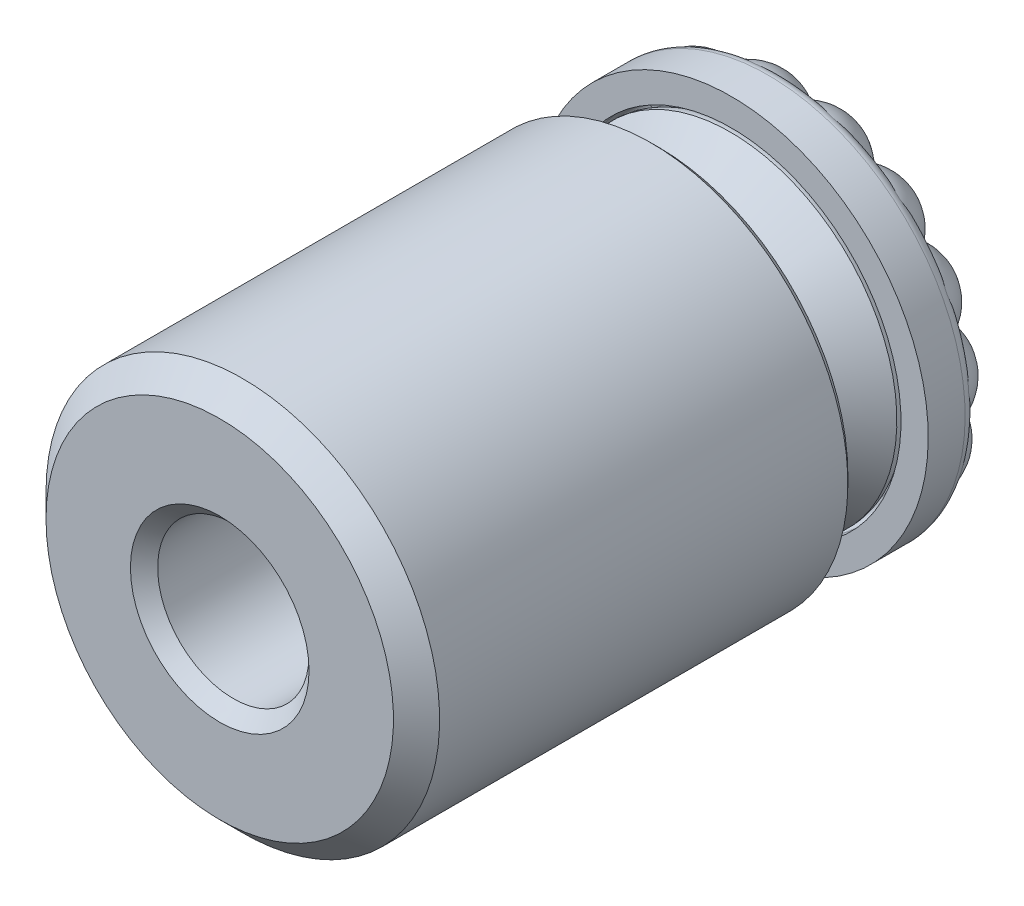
ISO-10303-21;
HEADER;
FILE_DESCRIPTION(('STEP AP214'),'2;1');
FILE_NAME('part.step','',(''),(''),'','','');
FILE_SCHEMA(('AUTOMOTIVE_DESIGN { 1 0 10303 214 1 1 1 1 }'));
ENDSEC;
DATA;
#1=APPLICATION_CONTEXT('core data for automotive mechanical design processes');
#2=APPLICATION_PROTOCOL_DEFINITION('international standard','automotive_design',2000,#1);
#3=PRODUCT_CONTEXT('',#1,'mechanical');
#4=PRODUCT('Part','Part','',(#3));
#5=PRODUCT_RELATED_PRODUCT_CATEGORY('part','',(#4));
#6=PRODUCT_DEFINITION_FORMATION('','',#4);
#7=PRODUCT_DEFINITION_CONTEXT('part definition',#1,'design');
#8=PRODUCT_DEFINITION('design','',#6,#7);
#9=PRODUCT_DEFINITION_SHAPE('','',#8);
#10=(LENGTH_UNIT() NAMED_UNIT(*) SI_UNIT(.MILLI.,.METRE.));
#11=(NAMED_UNIT(*) PLANE_ANGLE_UNIT() SI_UNIT($,.RADIAN.));
#12=(NAMED_UNIT(*) SI_UNIT($,.STERADIAN.) SOLID_ANGLE_UNIT());
#13=UNCERTAINTY_MEASURE_WITH_UNIT(LENGTH_MEASURE(1.E-05),#10,'distance_accuracy_value','');
#14=(GEOMETRIC_REPRESENTATION_CONTEXT(3) GLOBAL_UNCERTAINTY_ASSIGNED_CONTEXT((#13)) GLOBAL_UNIT_ASSIGNED_CONTEXT((#10,
#11,#12)) REPRESENTATION_CONTEXT('',''));
#15=CARTESIAN_POINT('',(0.,0.,0.));
#16=DIRECTION('',(0.,0.,1.));
#17=DIRECTION('',(1.,0.,0.));
#18=AXIS2_PLACEMENT_3D('',#15,#16,#17);
#19=CARTESIAN_POINT('',(0.,0.,6.2192));
#20=DIRECTION('',(0.,0.,1.));
#21=DIRECTION('',(1.,0.,0.));
#22=AXIS2_PLACEMENT_3D('',#19,#20,#21);
#23=PLANE('',#22);
#24=CARTESIAN_POINT('',(0.,0.,6.2192));
#25=DIRECTION('',(0.,0.,1.));
#26=DIRECTION('',(1.,0.,0.));
#27=AXIS2_PLACEMENT_3D('',#24,#25,#26);
#28=CIRCLE('',#27,5.0673);
#29=CARTESIAN_POINT('',(5.0673,0.,6.2192));
#30=VERTEX_POINT('',#29);
#31=EDGE_CURVE('E754',#30,#30,#28,.F.);
#32=ORIENTED_EDGE('',*,*,#31,.T.);
#33=EDGE_LOOP('',(#32));
#34=FACE_BOUND('',#33,.T.);
#35=CARTESIAN_POINT('',(0.,0.,6.2192));
#36=DIRECTION('',(0.,0.,1.));
#37=DIRECTION('',(1.,0.,0.));
#38=AXIS2_PLACEMENT_3D('',#35,#36,#37);
#39=CIRCLE('',#38,4.44877097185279);
#40=CARTESIAN_POINT('',(1.32147520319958,4.24797203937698,6.2192));
#41=VERTEX_POINT('',#40);
#42=EDGE_CURVE('E9',#41,#41,#39,.F.);
#43=ORIENTED_EDGE('',*,*,#42,.F.);
#44=EDGE_LOOP('',(#43));
#45=FACE_BOUND('',#44,.T.);
#46=ADVANCED_FACE('F14',(#34,#45),#23,.F.);
#47=CARTESIAN_POINT('',(0.,0.,19.5));
#48=DIRECTION('',(0.,0.,-1.));
#49=DIRECTION('',(-1.,0.,0.));
#50=AXIS2_PLACEMENT_3D('',#47,#48,#49);
#51=CYLINDRICAL_SURFACE('',#50,6.5);
#52=CARTESIAN_POINT('',(0.,0.,18.738));
#53=DIRECTION('',(0.,0.,-1.));
#54=DIRECTION('',(-1.,0.,0.));
#55=AXIS2_PLACEMENT_3D('',#52,#53,#54);
#56=CIRCLE('',#55,6.5);
#57=CARTESIAN_POINT('',(-6.5,0.,18.738));
#58=VERTEX_POINT('',#57);
#59=EDGE_CURVE('E767',#58,#58,#56,.T.);
#60=ORIENTED_EDGE('',*,*,#59,.T.);
#61=EDGE_LOOP('',(#60));
#62=FACE_BOUND('',#61,.T.);
#63=CARTESIAN_POINT('',(0.,0.,5.254));
#64=DIRECTION('',(0.,0.,-1.));
#65=DIRECTION('',(-1.,0.,0.));
#66=AXIS2_PLACEMENT_3D('',#63,#64,#65);
#67=CIRCLE('',#66,6.5);
#68=CARTESIAN_POINT('',(-6.5,0.,5.254));
#69=VERTEX_POINT('',#68);
#70=EDGE_CURVE('E764',#69,#69,#67,.F.);
#71=ORIENTED_EDGE('',*,*,#70,.T.);
#72=EDGE_LOOP('',(#71));
#73=FACE_BOUND('',#72,.T.);
#74=ADVANCED_FACE('F725',(#62,#73),#51,.T.);
#75=CARTESIAN_POINT('',(0.,0.,19.5));
#76=DIRECTION('',(0.,0.,-1.));
#77=DIRECTION('',(-1.,0.,0.));
#78=AXIS2_PLACEMENT_3D('',#75,#76,#77);
#79=PLANE('',#78);
#80=CARTESIAN_POINT('',(0.,0.,19.5));
#81=DIRECTION('',(0.,0.,-1.));
#82=DIRECTION('',(-1.,0.,0.));
#83=AXIS2_PLACEMENT_3D('',#80,#81,#82);
#84=CIRCLE('',#83,5.738);
#85=CARTESIAN_POINT('',(-5.738,0.,19.5));
#86=VERTEX_POINT('',#85);
#87=EDGE_CURVE('E23',#86,#86,#84,.F.);
#88=ORIENTED_EDGE('',*,*,#87,.T.);
#89=EDGE_LOOP('',(#88));
#90=FACE_BOUND('',#89,.T.);
#91=CARTESIAN_POINT('',(0.,0.,19.5));
#92=DIRECTION('',(0.,0.,1.));
#93=DIRECTION('',(1.,0.,0.));
#94=AXIS2_PLACEMENT_3D('',#91,#92,#93);
#95=CIRCLE('',#94,2.95);
#96=CARTESIAN_POINT('',(2.95,0.,19.5));
#97=VERTEX_POINT('',#96);
#98=EDGE_CURVE('E303',#97,#97,#95,.T.);
#99=ORIENTED_EDGE('',*,*,#98,.F.);
#100=EDGE_LOOP('',(#99));
#101=FACE_BOUND('',#100,.T.);
#102=ADVANCED_FACE('F732',(#90,#101),#79,.F.);
#103=CARTESIAN_POINT('',(0.,0.,5.));
#104=DIRECTION('',(0.,0.,-1.));
#105=DIRECTION('',(-1.,0.,0.));
#106=AXIS2_PLACEMENT_3D('',#103,#104,#105);
#107=PLANE('',#106);
#108=CARTESIAN_POINT('',(0.,0.,5.));
#109=DIRECTION('',(0.,0.,-1.));
#110=DIRECTION('',(-1.,0.,0.));
#111=AXIS2_PLACEMENT_3D('',#108,#109,#110);
#112=CIRCLE('',#111,5.3213);
#113=CARTESIAN_POINT('',(-5.3213,0.,5.));
#114=VERTEX_POINT('',#113);
#115=EDGE_CURVE('E749',#114,#114,#112,.F.);
#116=ORIENTED_EDGE('',*,*,#115,.T.);
#117=EDGE_LOOP('',(#116));
#118=FACE_BOUND('',#117,.T.);
#119=CARTESIAN_POINT('',(0.,0.,5.));
#120=DIRECTION('',(0.,0.,-1.));
#121=DIRECTION('',(-1.,0.,0.));
#122=AXIS2_PLACEMENT_3D('',#119,#120,#121);
#123=CIRCLE('',#122,6.246);
#124=CARTESIAN_POINT('',(-6.246,0.,5.));
#125=VERTEX_POINT('',#124);
#126=EDGE_CURVE('E753',#125,#125,#123,.T.);
#127=ORIENTED_EDGE('',*,*,#126,.T.);
#128=EDGE_LOOP('',(#127));
#129=FACE_BOUND('',#128,.T.);
#130=ADVANCED_FACE('F730',(#118,#129),#107,.T.);
#131=CARTESIAN_POINT('',(0.,0.,10.4356));
#132=DIRECTION('',(0.,0.,-1.));
#133=DIRECTION('',(-1.,0.,0.));
#134=AXIS2_PLACEMENT_3D('',#131,#132,#133);
#135=CYLINDRICAL_SURFACE('',#134,5.0673);
#136=CARTESIAN_POINT('',(0.,0.,5.254));
#137=DIRECTION('',(0.,0.,-1.));
#138=DIRECTION('',(-1.,0.,0.));
#139=AXIS2_PLACEMENT_3D('',#136,#137,#138);
#140=CIRCLE('',#139,5.0673);
#141=CARTESIAN_POINT('',(-5.0673,0.,5.254));
#142=VERTEX_POINT('',#141);
#143=EDGE_CURVE('E752',#142,#142,#140,.T.);
#144=ORIENTED_EDGE('',*,*,#143,.T.);
#145=EDGE_LOOP('',(#144));
#146=FACE_BOUND('',#145,.T.);
#147=ORIENTED_EDGE('',*,*,#31,.F.);
#148=EDGE_LOOP('',(#147));
#149=FACE_BOUND('',#148,.T.);
#150=ADVANCED_FACE('F727',(#146,#149),#135,.F.);
#151=CARTESIAN_POINT('',(0.,0.,5.254));
#152=DIRECTION('',(0.,0.,-1.));
#153=DIRECTION('',(-1.,0.,0.));
#154=AXIS2_PLACEMENT_3D('',#151,#152,#153);
#155=CONICAL_SURFACE('',#154,5.0673,0.785398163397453);
#156=ORIENTED_EDGE('',*,*,#115,.F.);
#157=EDGE_LOOP('',(#156));
#158=FACE_BOUND('',#157,.T.);
#159=ORIENTED_EDGE('',*,*,#143,.F.);
#160=EDGE_LOOP('',(#159));
#161=FACE_BOUND('',#160,.T.);
#162=ADVANCED_FACE('F697',(#158,#161),#155,.F.);
#163=CARTESIAN_POINT('',(0.,0.,5.));
#164=DIRECTION('',(0.,0.,1.));
#165=DIRECTION('',(1.,0.,0.));
#166=AXIS2_PLACEMENT_3D('',#163,#164,#165);
#167=CONICAL_SURFACE('',#166,6.246,0.785398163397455);
#168=ORIENTED_EDGE('',*,*,#70,.F.);
#169=EDGE_LOOP('',(#168));
#170=FACE_BOUND('',#169,.T.);
#171=ORIENTED_EDGE('',*,*,#126,.F.);
#172=EDGE_LOOP('',(#171));
#173=FACE_BOUND('',#172,.T.);
#174=ADVANCED_FACE('F690',(#170,#173),#167,.T.);
#175=CARTESIAN_POINT('',(0.,0.,18.738));
#176=DIRECTION('',(0.,0.,-1.));
#177=DIRECTION('',(-1.,0.,0.));
#178=AXIS2_PLACEMENT_3D('',#175,#176,#177);
#179=CONICAL_SURFACE('',#178,6.5,0.785398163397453);
#180=ORIENTED_EDGE('',*,*,#87,.F.);
#181=EDGE_LOOP('',(#180));
#182=FACE_BOUND('',#181,.T.);
#183=ORIENTED_EDGE('',*,*,#59,.F.);
#184=EDGE_LOOP('',(#183));
#185=FACE_BOUND('',#184,.T.);
#186=ADVANCED_FACE('F686',(#182,#185),#179,.T.);
#187=CARTESIAN_POINT('',(0.,0.,3.1750000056));
#188=DIRECTION('',(0.,0.,1.));
#189=DIRECTION('',(0.297042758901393,0.954864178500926,0.));
#190=AXIS2_PLACEMENT_3D('',#187,#188,#189);
#191=SPHERICAL_SURFACE('',#190,3.175);
#192=CARTESIAN_POINT('',(-2.42535501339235,0.754488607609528,1.9050000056));
#193=DIRECTION('',(0.854056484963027,-0.265683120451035,0.447213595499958));
#194=DIRECTION('',(0.427028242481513,-0.132841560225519,-0.894427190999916));
#195=AXIS2_PLACEMENT_3D('',#192,#193,#194);
#196=CIRCLE('',#195,1.41990316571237);
#197=CARTESIAN_POINT('',(-2.1860457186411,-0.199712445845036,0.881107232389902));
#198=VERTEX_POINT('',#197);
#199=CARTESIAN_POINT('',(-1.68698577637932,1.40454972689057,0.881107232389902));
#200=VERTEX_POINT('',#199);
#201=EDGE_CURVE('E316',#198,#200,#196,.T.);
#202=ORIENTED_EDGE('',*,*,#201,.T.);
#203=CARTESIAN_POINT('',(-1.18148096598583,2.24848898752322,1.9050000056));
#204=DIRECTION('',(0.416042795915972,-0.791775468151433,0.447213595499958));
#205=DIRECTION('',(0.885231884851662,0.465149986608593,0.));
#206=AXIS2_PLACEMENT_3D('',#203,#204,#205);
#207=CIRCLE('',#206,1.41990316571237);
#208=CARTESIAN_POINT('',(-0.199712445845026,2.1860457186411,0.881107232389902));
#209=VERTEX_POINT('',#208);
#210=EDGE_CURVE('E38',#200,#209,#207,.T.);
#211=ORIENTED_EDGE('',*,*,#210,.T.);
#212=CARTESIAN_POINT('',(0.754488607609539,2.42535501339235,1.9050000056));
#213=DIRECTION('',(-0.265683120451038,-0.854056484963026,0.447213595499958));
#214=DIRECTION('',(0.132841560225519,0.427028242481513,0.894427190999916));
#215=AXIS2_PLACEMENT_3D('',#212,#213,#214);
#216=CIRCLE('',#215,1.41990316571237);
#217=CARTESIAN_POINT('',(1.40454972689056,1.68698577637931,0.881107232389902));
#218=VERTEX_POINT('',#217);
#219=EDGE_CURVE('E31',#209,#218,#216,.T.);
#220=ORIENTED_EDGE('',*,*,#219,.T.);
#221=CARTESIAN_POINT('',(2.24848898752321,1.18148096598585,1.9050000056));
#222=DIRECTION('',(-0.791775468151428,-0.416042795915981,0.447213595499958));
#223=DIRECTION('',(0.465149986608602,-0.885231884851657,0.));
#224=AXIS2_PLACEMENT_3D('',#221,#222,#223);
#225=CIRCLE('',#224,1.41990316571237);
#226=CARTESIAN_POINT('',(2.18604571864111,0.199712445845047,0.881107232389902));
#227=VERTEX_POINT('',#226);
#228=EDGE_CURVE('E279',#218,#227,#225,.T.);
#229=ORIENTED_EDGE('',*,*,#228,.T.);
#230=CARTESIAN_POINT('',(2.42535501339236,-0.754488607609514,1.9050000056));
#231=DIRECTION('',(-0.854056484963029,0.265683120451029,0.447213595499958));
#232=DIRECTION('',(0.427028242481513,-0.132841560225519,0.894427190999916));
#233=AXIS2_PLACEMENT_3D('',#230,#231,#232);
#234=CIRCLE('',#233,1.41990316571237);
#235=CARTESIAN_POINT('',(1.68698577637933,-1.40454972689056,0.881107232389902));
#236=VERTEX_POINT('',#235);
#237=EDGE_CURVE('E291',#227,#236,#234,.T.);
#238=ORIENTED_EDGE('',*,*,#237,.T.);
#239=CARTESIAN_POINT('',(1.18148096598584,-2.24848898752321,1.9050000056));
#240=DIRECTION('',(-0.416042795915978,0.791775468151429,0.447213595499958));
#241=DIRECTION('',(-0.885231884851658,-0.4651499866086,0.));
#242=AXIS2_PLACEMENT_3D('',#239,#240,#241);
#243=CIRCLE('',#242,1.41990316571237);
#244=CARTESIAN_POINT('',(0.199712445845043,-2.1860457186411,0.881107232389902));
#245=VERTEX_POINT('',#244);
#246=EDGE_CURVE('E296',#236,#245,#243,.T.);
#247=ORIENTED_EDGE('',*,*,#246,.T.);
#248=CARTESIAN_POINT('',(-0.75448860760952,-2.42535501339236,1.9050000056));
#249=DIRECTION('',(0.265683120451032,0.854056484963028,0.447213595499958));
#250=DIRECTION('',(0.132841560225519,0.427028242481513,-0.894427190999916));
#251=AXIS2_PLACEMENT_3D('',#248,#249,#250);
#252=CIRCLE('',#251,1.41990316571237);
#253=CARTESIAN_POINT('',(-1.40454972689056,-1.68698577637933,0.881107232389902));
#254=VERTEX_POINT('',#253);
#255=EDGE_CURVE('E310',#245,#254,#252,.T.);
#256=ORIENTED_EDGE('',*,*,#255,.T.);
#257=CARTESIAN_POINT('',(-2.24848898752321,-1.18148096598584,1.9050000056));
#258=DIRECTION('',(0.791775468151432,0.416042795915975,0.447213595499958));
#259=DIRECTION('',(-0.465149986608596,0.88523188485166,0.));
#260=AXIS2_PLACEMENT_3D('',#257,#258,#259);
#261=CIRCLE('',#260,1.41990316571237);
#262=EDGE_CURVE('E313',#254,#198,#261,.T.);
#263=ORIENTED_EDGE('',*,*,#262,.T.);
#264=EDGE_LOOP('',(#202,#211,#220,#229,#238,#247,#256,#263));
#265=FACE_BOUND('',#264,.T.);
#266=ADVANCED_FACE('F299',(#265),#191,.T.);
#267=CARTESIAN_POINT('',(2.81061123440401,1.47685120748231,1.5875000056));
#268=DIRECTION('',(0.,0.,-1.));
#269=DIRECTION('',(-0.885231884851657,-0.465149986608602,0.));
#270=AXIS2_PLACEMENT_3D('',#267,#268,#269);
#271=SPHERICAL_SURFACE('',#270,1.5875);
#272=ORIENTED_EDGE('',*,*,#228,.F.);
#273=CARTESIAN_POINT('',(1.87686099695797,2.25427248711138,1.5875000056));
#274=DIRECTION('',(0.768506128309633,-0.639842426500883,0.));
#275=DIRECTION('',(0.639842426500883,0.768506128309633,0.));
#276=AXIS2_PLACEMENT_3D('',#273,#274,#275);
#277=CIRCLE('',#276,1.02170587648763);
#278=CARTESIAN_POINT('',(2.27141404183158,2.72816483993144,0.7728609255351));
#279=VERTEX_POINT('',#278);
#280=EDGE_CURVE('E625',#218,#279,#277,.T.);
#281=ORIENTED_EDGE('',*,*,#280,.T.);
#282=CARTESIAN_POINT('',(2.97691857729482,2.62606878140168,1.5875000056));
#283=DIRECTION('',(0.143221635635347,0.989690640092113,0.));
#284=DIRECTION('',(-0.989690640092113,0.143221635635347,0.));
#285=AXIS2_PLACEMENT_3D('',#282,#283,#284);
#286=CIRCLE('',#285,1.08249576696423);
#287=CARTESIAN_POINT('',(3.20551216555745,2.59298819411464,0.529933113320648));
#288=VERTEX_POINT('',#287);
#289=EDGE_CURVE('E605',#279,#288,#286,.F.);
#290=ORIENTED_EDGE('',*,*,#289,.T.);
#291=CARTESIAN_POINT('',(3.57965643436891,1.88095025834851,1.5875000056));
#292=DIRECTION('',(0.885231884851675,0.465149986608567,0.));
#293=DIRECTION('',(-0.465149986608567,0.885231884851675,0.));
#294=AXIS2_PLACEMENT_3D('',#291,#292,#293);
#295=CIRCLE('',#294,1.32869473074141);
#296=CARTESIAN_POINT('',(3.95380070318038,1.16891232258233,0.529933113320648));
#297=VERTEX_POINT('',#296);
#298=EDGE_CURVE('E571',#288,#297,#295,.F.);
#299=ORIENTED_EDGE('',*,*,#298,.T.);
#300=CARTESIAN_POINT('',(3.85136909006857,0.961892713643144,1.5875000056));
#301=DIRECTION('',(0.896286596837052,-0.443475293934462,0.));
#302=DIRECTION('',(0.443475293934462,0.896286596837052,0.));
#303=AXIS2_PLACEMENT_3D('',#300,#301,#302);
#304=CIRCLE('',#303,1.08249576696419);
#305=CARTESIAN_POINT('',(3.53523613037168,0.322971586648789,0.7728609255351));
#306=VERTEX_POINT('',#305);
#307=EDGE_CURVE('E282',#297,#306,#304,.F.);
#308=ORIENTED_EDGE('',*,*,#307,.T.);
#309=CARTESIAN_POINT('',(2.92115250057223,0.266870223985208,1.5875000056));
#310=DIRECTION('',(-0.0909789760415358,0.995852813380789,0.));
#311=DIRECTION('',(-0.99585281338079,-0.090978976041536,0.));
#312=AXIS2_PLACEMENT_3D('',#309,#310,#311);
#313=CIRCLE('',#312,1.02170587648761);
#314=EDGE_CURVE('E275',#306,#227,#313,.T.);
#315=ORIENTED_EDGE('',*,*,#314,.T.);
#316=EDGE_LOOP('',(#272,#281,#290,#299,#308,#315));
#317=FACE_BOUND('',#316,.T.);
#318=ADVANCED_FACE('F277',(#317),#271,.T.);
#319=CARTESIAN_POINT('',(3.03169376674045,-0.943110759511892,1.5875000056));
#320=DIRECTION('',(0.,0.,-1.));
#321=DIRECTION('',(-0.954864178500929,0.297042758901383,0.));
#322=AXIS2_PLACEMENT_3D('',#319,#320,#321);
#323=SPHERICAL_SURFACE('',#322,1.5875);
#324=ORIENTED_EDGE('',*,*,#237,.F.);
#325=ORIENTED_EDGE('',*,*,#314,.F.);
#326=CARTESIAN_POINT('',(3.9619103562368,-0.248088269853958,1.5875000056));
#327=DIRECTION('',(0.801089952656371,0.598543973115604,0.));
#328=DIRECTION('',(-0.598543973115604,0.801089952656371,0.));
#329=AXIS2_PLACEMENT_3D('',#326,#327,#328);
#330=CIRCLE('',#329,1.08249576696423);
#331=CARTESIAN_POINT('',(4.10015892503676,-0.433119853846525,0.529933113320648));
#332=VERTEX_POINT('',#331);
#333=EDGE_CURVE('E561',#306,#332,#330,.F.);
#334=ORIENTED_EDGE('',*,*,#333,.T.);
#335=CARTESIAN_POINT('',(3.86123202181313,-1.2011666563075,1.5875000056));
#336=DIRECTION('',(0.954864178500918,-0.297042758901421,0.));
#337=DIRECTION('',(0.297042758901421,0.954864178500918,0.));
#338=AXIS2_PLACEMENT_3D('',#335,#336,#337);
#339=CIRCLE('',#338,1.32869473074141);
#340=CARTESIAN_POINT('',(3.62230511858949,-1.96921345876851,0.529933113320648));
#341=VERTEX_POINT('',#340);
#342=EDGE_CURVE('E543',#332,#341,#339,.F.);
#343=ORIENTED_EDGE('',*,*,#342,.T.);
#344=CARTESIAN_POINT('',(3.40349006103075,-2.04316833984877,1.5875000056));
#345=DIRECTION('',(0.320185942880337,-0.947354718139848,0.));
#346=DIRECTION('',(0.947354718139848,0.320185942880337,0.));
#347=AXIS2_PLACEMENT_3D('',#344,#345,#346);
#348=CIRCLE('',#347,1.08249576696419);
#349=CARTESIAN_POINT('',(2.72816483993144,-2.27141404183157,0.772860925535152));
#350=VERTEX_POINT('',#349);
#351=EDGE_CURVE('E514',#341,#350,#348,.F.);
#352=ORIENTED_EDGE('',*,*,#351,.T.);
#353=CARTESIAN_POINT('',(2.25427248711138,-1.87686099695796,1.5875000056));
#354=DIRECTION('',(0.639842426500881,0.768506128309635,0.));
#355=DIRECTION('',(-0.768506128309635,0.639842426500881,0.));
#356=AXIS2_PLACEMENT_3D('',#353,#354,#355);
#357=CIRCLE('',#356,1.02170587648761);
#358=EDGE_CURVE('E287',#350,#236,#357,.T.);
#359=ORIENTED_EDGE('',*,*,#358,.T.);
#360=EDGE_LOOP('',(#324,#325,#334,#343,#352,#359));
#361=FACE_BOUND('',#360,.T.);
#362=ADVANCED_FACE('F292',(#361),#323,.T.);
#363=CARTESIAN_POINT('',(1.4768512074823,-2.81061123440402,1.5875000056));
#364=DIRECTION('',(0.,0.,-1.));
#365=DIRECTION('',(-0.4651499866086,0.885231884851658,0.));
#366=AXIS2_PLACEMENT_3D('',#363,#364,#365);
#367=SPHERICAL_SURFACE('',#366,1.5875);
#368=ORIENTED_EDGE('',*,*,#246,.F.);
#369=ORIENTED_EDGE('',*,*,#358,.F.);
#370=CARTESIAN_POINT('',(2.62606878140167,-2.97691857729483,1.5875000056));
#371=DIRECTION('',(0.989690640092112,-0.14322163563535,0.));
#372=DIRECTION('',(0.14322163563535,0.989690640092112,0.));
#373=AXIS2_PLACEMENT_3D('',#370,#371,#372);
#374=CIRCLE('',#373,1.08249576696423);
#375=CARTESIAN_POINT('',(2.59298819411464,-3.20551216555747,0.529933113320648));
#376=VERTEX_POINT('',#375);
#377=EDGE_CURVE('E542',#350,#376,#374,.F.);
#378=ORIENTED_EDGE('',*,*,#377,.T.);
#379=CARTESIAN_POINT('',(1.8809502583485,-3.57965643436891,1.5875000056));
#380=DIRECTION('',(0.465149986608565,-0.885231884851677,0.));
#381=DIRECTION('',(0.885231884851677,0.465149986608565,0.));
#382=AXIS2_PLACEMENT_3D('',#379,#380,#381);
#383=CIRCLE('',#382,1.32869473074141);
#384=CARTESIAN_POINT('',(1.16891232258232,-3.95380070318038,0.529933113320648));
#385=VERTEX_POINT('',#384);
#386=EDGE_CURVE('E500',#376,#385,#383,.F.);
#387=ORIENTED_EDGE('',*,*,#386,.T.);
#388=CARTESIAN_POINT('',(0.96189271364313,-3.85136909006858,1.5875000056));
#389=DIRECTION('',(-0.443475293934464,-0.89628659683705,0.));
#390=DIRECTION('',(0.89628659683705,-0.443475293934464,0.));
#391=AXIS2_PLACEMENT_3D('',#388,#389,#390);
#392=CIRCLE('',#391,1.08249576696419);
#393=CARTESIAN_POINT('',(0.322971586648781,-3.53523613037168,0.7728609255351));
#394=VERTEX_POINT('',#393);
#395=EDGE_CURVE('E482',#385,#394,#392,.F.);
#396=ORIENTED_EDGE('',*,*,#395,.T.);
#397=CARTESIAN_POINT('',(0.2668702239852,-2.92115250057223,1.5875000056));
#398=DIRECTION('',(0.99585281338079,0.0909789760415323,0.));
#399=DIRECTION('',(-0.0909789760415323,0.99585281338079,0.));
#400=AXIS2_PLACEMENT_3D('',#397,#398,#399);
#401=CIRCLE('',#400,1.02170587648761);
#402=EDGE_CURVE('E1275',#394,#245,#401,.T.);
#403=ORIENTED_EDGE('',*,*,#402,.T.);
#404=EDGE_LOOP('',(#368,#369,#378,#387,#396,#403));
#405=FACE_BOUND('',#404,.T.);
#406=ADVANCED_FACE('F637',(#405),#367,.T.);
#407=CARTESIAN_POINT('',(-0.9431107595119,-3.03169376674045,1.5875000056));
#408=DIRECTION('',(0.,0.,-1.));
#409=DIRECTION('',(0.297042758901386,0.954864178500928,0.));
#410=AXIS2_PLACEMENT_3D('',#407,#408,#409);
#411=SPHERICAL_SURFACE('',#410,1.5875);
#412=ORIENTED_EDGE('',*,*,#255,.F.);
#413=ORIENTED_EDGE('',*,*,#402,.F.);
#414=CARTESIAN_POINT('',(-0.24808826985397,-3.9619103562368,1.5875000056));
#415=DIRECTION('',(0.598543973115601,-0.801089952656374,0.));
#416=DIRECTION('',(0.801089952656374,0.598543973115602,0.));
#417=AXIS2_PLACEMENT_3D('',#414,#415,#416);
#418=CIRCLE('',#417,1.08249576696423);
#419=CARTESIAN_POINT('',(-0.433119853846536,-4.10015892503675,0.529933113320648));
#420=VERTEX_POINT('',#419);
#421=EDGE_CURVE('E489',#394,#420,#418,.F.);
#422=ORIENTED_EDGE('',*,*,#421,.T.);
#423=CARTESIAN_POINT('',(-1.20116665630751,-3.86123202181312,1.5875000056));
#424=DIRECTION('',(-0.297042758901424,-0.954864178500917,0.));
#425=DIRECTION('',(0.954864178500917,-0.297042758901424,0.));
#426=AXIS2_PLACEMENT_3D('',#423,#424,#425);
#427=CIRCLE('',#426,1.32869473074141);
#428=CARTESIAN_POINT('',(-1.96921345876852,-3.62230511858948,0.529933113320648));
#429=VERTEX_POINT('',#428);
#430=EDGE_CURVE('E456',#420,#429,#427,.F.);
#431=ORIENTED_EDGE('',*,*,#430,.T.);
#432=CARTESIAN_POINT('',(-2.04316833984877,-3.40349006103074,1.5875000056));
#433=DIRECTION('',(-0.947354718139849,-0.320185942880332,0.));
#434=DIRECTION('',(0.320185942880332,-0.947354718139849,0.));
#435=AXIS2_PLACEMENT_3D('',#432,#433,#434);
#436=CIRCLE('',#435,1.08249576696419);
#437=CARTESIAN_POINT('',(-2.27141404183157,-2.72816483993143,0.7728609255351));
#438=VERTEX_POINT('',#437);
#439=EDGE_CURVE('E440',#429,#438,#436,.F.);
#440=ORIENTED_EDGE('',*,*,#439,.T.);
#441=CARTESIAN_POINT('',(-1.87686099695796,-2.25427248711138,1.5875000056));
#442=DIRECTION('',(0.768506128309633,-0.639842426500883,0.));
#443=DIRECTION('',(0.639842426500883,0.768506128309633,0.));
#444=AXIS2_PLACEMENT_3D('',#441,#442,#443);
#445=CIRCLE('',#444,1.02170587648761);
#446=EDGE_CURVE('E1272',#438,#254,#445,.T.);
#447=ORIENTED_EDGE('',*,*,#446,.T.);
#448=EDGE_LOOP('',(#412,#413,#422,#431,#440,#447));
#449=FACE_BOUND('',#448,.T.);
#450=ADVANCED_FACE('F640',(#449),#411,.T.);
#451=CARTESIAN_POINT('',(-2.81061123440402,-1.47685120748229,1.5875000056));
#452=DIRECTION('',(0.,0.,-1.));
#453=DIRECTION('',(0.88523188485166,0.465149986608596,0.));
#454=AXIS2_PLACEMENT_3D('',#451,#452,#453);
#455=SPHERICAL_SURFACE('',#454,1.5875);
#456=ORIENTED_EDGE('',*,*,#262,.F.);
#457=ORIENTED_EDGE('',*,*,#446,.F.);
#458=CARTESIAN_POINT('',(-2.97691857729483,-2.62606878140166,1.5875000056));
#459=DIRECTION('',(-0.143221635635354,-0.989690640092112,0.));
#460=DIRECTION('',(0.989690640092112,-0.143221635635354,0.));
#461=AXIS2_PLACEMENT_3D('',#458,#459,#460);
#462=CIRCLE('',#461,1.08249576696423);
#463=CARTESIAN_POINT('',(-3.20551216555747,-2.59298819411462,0.529933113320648));
#464=VERTEX_POINT('',#463);
#465=EDGE_CURVE('E445',#438,#464,#462,.F.);
#466=ORIENTED_EDGE('',*,*,#465,.T.);
#467=CARTESIAN_POINT('',(-3.57965643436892,-1.88095025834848,1.5875000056));
#468=DIRECTION('',(-0.885231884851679,-0.465149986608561,0.));
#469=DIRECTION('',(0.465149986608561,-0.885231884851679,0.));
#470=AXIS2_PLACEMENT_3D('',#467,#468,#469);
#471=CIRCLE('',#470,1.32869473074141);
#472=CARTESIAN_POINT('',(-3.95380070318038,-1.16891232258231,0.529933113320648));
#473=VERTEX_POINT('',#472);
#474=EDGE_CURVE('E427',#464,#473,#471,.F.);
#475=ORIENTED_EDGE('',*,*,#474,.T.);
#476=CARTESIAN_POINT('',(-3.85136909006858,-0.961892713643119,1.5875000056));
#477=DIRECTION('',(-0.896286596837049,0.443475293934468,0.));
#478=DIRECTION('',(-0.443475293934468,-0.896286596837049,0.));
#479=AXIS2_PLACEMENT_3D('',#476,#477,#478);
#480=CIRCLE('',#479,1.08249576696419);
#481=CARTESIAN_POINT('',(-3.53523613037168,-0.322971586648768,0.7728609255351));
#482=VERTEX_POINT('',#481);
#483=EDGE_CURVE('E398',#473,#482,#480,.F.);
#484=ORIENTED_EDGE('',*,*,#483,.T.);
#485=CARTESIAN_POINT('',(-2.92115250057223,-0.26687022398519,1.5875000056));
#486=DIRECTION('',(0.0909789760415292,-0.99585281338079,0.));
#487=DIRECTION('',(0.99585281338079,0.0909789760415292,0.));
#488=AXIS2_PLACEMENT_3D('',#485,#486,#487);
#489=CIRCLE('',#488,1.02170587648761);
#490=EDGE_CURVE('E1269',#482,#198,#489,.T.);
#491=ORIENTED_EDGE('',*,*,#490,.T.);
#492=EDGE_LOOP('',(#456,#457,#466,#475,#484,#491));
#493=FACE_BOUND('',#492,.T.);
#494=ADVANCED_FACE('F644',(#493),#455,.T.);
#495=CARTESIAN_POINT('',(-3.03169376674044,0.94311075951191,1.5875000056));
#496=DIRECTION('',(0.,0.,-1.));
#497=DIRECTION('',(0.954864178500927,-0.29704275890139,0.));
#498=AXIS2_PLACEMENT_3D('',#495,#496,#497);
#499=SPHERICAL_SURFACE('',#498,1.5875);
#500=ORIENTED_EDGE('',*,*,#201,.F.);
#501=ORIENTED_EDGE('',*,*,#490,.F.);
#502=CARTESIAN_POINT('',(-3.9619103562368,0.248088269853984,1.5875000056));
#503=DIRECTION('',(-0.801089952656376,-0.598543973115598,0.));
#504=DIRECTION('',(0.598543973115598,-0.801089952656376,0.));
#505=AXIS2_PLACEMENT_3D('',#502,#503,#504);
#506=CIRCLE('',#505,1.08249576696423);
#507=CARTESIAN_POINT('',(-4.10015892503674,0.433119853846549,0.529933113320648));
#508=VERTEX_POINT('',#507);
#509=EDGE_CURVE('E426',#482,#508,#506,.F.);
#510=ORIENTED_EDGE('',*,*,#509,.T.);
#511=CARTESIAN_POINT('',(-3.86123202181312,1.20116665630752,1.5875000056));
#512=DIRECTION('',(-0.954864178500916,0.297042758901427,0.));
#513=DIRECTION('',(-0.297042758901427,-0.954864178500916,0.));
#514=AXIS2_PLACEMENT_3D('',#511,#512,#513);
#515=CIRCLE('',#514,1.32869473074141);
#516=CARTESIAN_POINT('',(-3.62230511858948,1.96921345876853,0.529933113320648));
#517=VERTEX_POINT('',#516);
#518=EDGE_CURVE('E385',#508,#517,#515,.F.);
#519=ORIENTED_EDGE('',*,*,#518,.T.);
#520=CARTESIAN_POINT('',(-3.40349006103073,2.04316833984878,1.5875000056));
#521=DIRECTION('',(-0.32018594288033,0.947354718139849,0.));
#522=DIRECTION('',(-0.947354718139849,-0.32018594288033,0.));
#523=AXIS2_PLACEMENT_3D('',#520,#521,#522);
#524=CIRCLE('',#523,1.08249576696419);
#525=CARTESIAN_POINT('',(-2.72816483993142,2.27141404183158,0.7728609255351));
#526=VERTEX_POINT('',#525);
#527=EDGE_CURVE('E367',#517,#526,#524,.F.);
#528=ORIENTED_EDGE('',*,*,#527,.T.);
#529=CARTESIAN_POINT('',(-2.25427248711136,1.87686099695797,1.5875000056));
#530=DIRECTION('',(-0.639842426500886,-0.768506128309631,0.));
#531=DIRECTION('',(0.768506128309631,-0.639842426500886,0.));
#532=AXIS2_PLACEMENT_3D('',#529,#530,#531);
#533=CIRCLE('',#532,1.02170587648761);
#534=EDGE_CURVE('E1267',#526,#200,#533,.T.);
#535=ORIENTED_EDGE('',*,*,#534,.T.);
#536=EDGE_LOOP('',(#500,#501,#510,#519,#528,#535));
#537=FACE_BOUND('',#536,.T.);
#538=ADVANCED_FACE('F648',(#537),#499,.T.);
#539=CARTESIAN_POINT('',(-1.47685120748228,2.81061123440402,1.5875000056));
#540=DIRECTION('',(0.,0.,-1.));
#541=DIRECTION('',(0.465149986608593,-0.885231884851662,0.));
#542=AXIS2_PLACEMENT_3D('',#539,#540,#541);
#543=SPHERICAL_SURFACE('',#542,1.5875);
#544=ORIENTED_EDGE('',*,*,#210,.F.);
#545=ORIENTED_EDGE('',*,*,#534,.F.);
#546=CARTESIAN_POINT('',(-2.62606878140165,2.97691857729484,1.5875000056));
#547=DIRECTION('',(-0.989690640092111,0.143221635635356,0.));
#548=DIRECTION('',(-0.143221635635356,-0.989690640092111,0.));
#549=AXIS2_PLACEMENT_3D('',#546,#547,#548);
#550=CIRCLE('',#549,1.08249576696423);
#551=CARTESIAN_POINT('',(-2.59298819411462,3.20551216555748,0.529933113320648));
#552=VERTEX_POINT('',#551);
#553=EDGE_CURVE('E374',#526,#552,#550,.F.);
#554=ORIENTED_EDGE('',*,*,#553,.T.);
#555=CARTESIAN_POINT('',(-1.88095025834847,3.57965643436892,1.5875000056));
#556=DIRECTION('',(-0.465149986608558,0.88523188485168,0.));
#557=DIRECTION('',(-0.88523188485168,-0.465149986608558,0.));
#558=AXIS2_PLACEMENT_3D('',#555,#556,#557);
#559=CIRCLE('',#558,1.32869473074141);
#560=CARTESIAN_POINT('',(-1.16891232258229,3.95380070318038,0.529933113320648));
#561=VERTEX_POINT('',#560);
#562=EDGE_CURVE('E1324',#552,#561,#559,.F.);
#563=ORIENTED_EDGE('',*,*,#562,.T.);
#564=CARTESIAN_POINT('',(-0.961892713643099,3.85136909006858,1.5875000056));
#565=DIRECTION('',(0.443475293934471,0.896286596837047,0.));
#566=DIRECTION('',(-0.896286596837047,0.443475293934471,0.));
#567=AXIS2_PLACEMENT_3D('',#564,#565,#566);
#568=CIRCLE('',#567,1.08249576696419);
#569=CARTESIAN_POINT('',(-0.322971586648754,3.53523613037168,0.7728609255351));
#570=VERTEX_POINT('',#569);
#571=EDGE_CURVE('E320',#561,#570,#568,.F.);
#572=ORIENTED_EDGE('',*,*,#571,.T.);
#573=CARTESIAN_POINT('',(-0.26687022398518,2.92115250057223,1.5875000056));
#574=DIRECTION('',(-0.99585281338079,-0.0909789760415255,0.));
#575=DIRECTION('',(0.0909789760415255,-0.99585281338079,0.));
#576=AXIS2_PLACEMENT_3D('',#573,#574,#575);
#577=CIRCLE('',#576,1.02170587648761);
#578=EDGE_CURVE('E1263',#570,#209,#577,.T.);
#579=ORIENTED_EDGE('',*,*,#578,.T.);
#580=EDGE_LOOP('',(#544,#545,#554,#563,#572,#579));
#581=FACE_BOUND('',#580,.T.);
#582=ADVANCED_FACE('F652',(#581),#543,.T.);
#583=CARTESIAN_POINT('',(0.943110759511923,3.03169376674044,1.5875000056));
#584=DIRECTION('',(0.,0.,-1.));
#585=DIRECTION('',(-0.297042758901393,-0.954864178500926,0.));
#586=AXIS2_PLACEMENT_3D('',#583,#584,#585);
#587=SPHERICAL_SURFACE('',#586,1.5875);
#588=ORIENTED_EDGE('',*,*,#219,.F.);
#589=ORIENTED_EDGE('',*,*,#578,.F.);
#590=CARTESIAN_POINT('',(0.248088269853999,3.96191035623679,1.5875000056));
#591=DIRECTION('',(-0.598543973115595,0.801089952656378,0.));
#592=DIRECTION('',(-0.801089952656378,-0.598543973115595,0.));
#593=AXIS2_PLACEMENT_3D('',#590,#591,#592);
#594=CIRCLE('',#593,1.08249576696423);
#595=CARTESIAN_POINT('',(0.433119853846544,4.10015892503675,0.529933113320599));
#596=VERTEX_POINT('',#595);
#597=EDGE_CURVE('E325',#570,#596,#594,.F.);
#598=ORIENTED_EDGE('',*,*,#597,.T.);
#599=CARTESIAN_POINT('',(1.20116665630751,3.86123202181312,1.5875000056));
#600=DIRECTION('',(0.297042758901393,0.954864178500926,0.));
#601=DIRECTION('',(0.,0.,-1.));
#602=AXIS2_PLACEMENT_3D('',#599,#600,#601);
#603=CIRCLE('',#602,1.32869473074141);
#604=CARTESIAN_POINT('',(1.9692134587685,3.62230511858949,0.529933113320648));
#605=VERTEX_POINT('',#604);
#606=EDGE_CURVE('E286',#596,#605,#603,.F.);
#607=ORIENTED_EDGE('',*,*,#606,.T.);
#608=CARTESIAN_POINT('',(2.04316833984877,3.40349006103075,1.5875000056));
#609=DIRECTION('',(0.947354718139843,0.320185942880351,0.));
#610=DIRECTION('',(-0.320185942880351,0.947354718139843,0.));
#611=AXIS2_PLACEMENT_3D('',#608,#609,#610);
#612=CIRCLE('',#611,1.08249576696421);
#613=EDGE_CURVE('E597',#605,#279,#612,.F.);
#614=ORIENTED_EDGE('',*,*,#613,.T.);
#615=ORIENTED_EDGE('',*,*,#280,.F.);
#616=EDGE_LOOP('',(#588,#589,#598,#607,#614,#615));
#617=FACE_BOUND('',#616,.T.);
#618=ADVANCED_FACE('F656',(#617),#587,.T.);
#619=CARTESIAN_POINT('',(1.81760464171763,5.84281390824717,1.0000000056));
#620=DIRECTION('',(0.,0.,1.));
#621=DIRECTION('',(0.954864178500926,-0.297042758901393,0.));
#622=AXIS2_PLACEMENT_3D('',#619,#620,#621);
#623=PLANE('',#622);
#624=CARTESIAN_POINT('',(-0.446934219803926,4.89212694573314,1.0000000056));
#625=DIRECTION('',(0.,0.,1.));
#626=DIRECTION('',(0.954864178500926,-0.297042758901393,0.));
#627=AXIS2_PLACEMENT_3D('',#624,#625,#626);
#628=CIRCLE('',#627,1.47478812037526);
#629=CARTESIAN_POINT('',(0.38979998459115,6.10657162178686,1.0000000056));
#630=VERTEX_POINT('',#629);
#631=CARTESIAN_POINT('',(0.623899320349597,5.90618588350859,1.0000000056));
#632=VERTEX_POINT('',#631);
#633=EDGE_CURVE('E326',#630,#632,#628,.F.);
#634=ORIENTED_EDGE('',*,*,#633,.F.);
#635=CARTESIAN_POINT('',(0.,0.,1.0000000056));
#636=DIRECTION('',(0.,0.,-1.));
#637=DIRECTION('',(-0.954864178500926,0.297042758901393,0.));
#638=AXIS2_PLACEMENT_3D('',#635,#636,#637);
#639=CIRCLE('',#638,6.119);
#640=CARTESIAN_POINT('',(0.894700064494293,6.05323655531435,1.0000000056));
#641=VERTEX_POINT('',#640);
#642=EDGE_CURVE('E1242',#630,#641,#639,.T.);
#643=ORIENTED_EDGE('',*,*,#642,.T.);
#644=CARTESIAN_POINT('',(1.45922255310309,4.6907702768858,1.0000000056));
#645=DIRECTION('',(0.,0.,1.));
#646=DIRECTION('',(0.954864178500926,-0.297042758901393,0.));
#647=AXIS2_PLACEMENT_3D('',#644,#645,#646);
#648=CIRCLE('',#647,1.47478812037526);
#649=EDGE_CURVE('E618',#632,#641,#648,.F.);
#650=ORIENTED_EDGE('',*,*,#649,.F.);
#651=EDGE_LOOP('',(#634,#643,#650));
#652=FACE_BOUND('',#651,.T.);
#653=ADVANCED_FACE('F631',(#652),#623,.F.);
#654=CARTESIAN_POINT('',(1.45922255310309,4.6907702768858,1.5875000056));
#655=DIRECTION('',(0.,0.,-1.));
#656=DIRECTION('',(0.297042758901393,0.954864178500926,0.));
#657=AXIS2_PLACEMENT_3D('',#654,#655,#656);
#658=SPHERICAL_SURFACE('',#657,1.5875);
#659=CARTESIAN_POINT('',(0.506144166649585,4.79144861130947,1.5875000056));
#660=DIRECTION('',(-0.994466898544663,0.105050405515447,0.));
#661=DIRECTION('',(-0.105050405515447,-0.994466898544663,0.));
#662=AXIS2_PLACEMENT_3D('',#659,#660,#661);
#663=CIRCLE('',#662,1.26556774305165);
#664=EDGE_CURVE('E336',#632,#596,#663,.T.);
#665=ORIENTED_EDGE('',*,*,#664,.F.);
#666=ORIENTED_EDGE('',*,*,#649,.T.);
#667=CARTESIAN_POINT('',(0.278126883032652,5.73125553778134,1.3812000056));
#668=CARTESIAN_POINT('',(0.281145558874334,5.73107806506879,1.36300338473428));
#669=CARTESIAN_POINT('',(0.285661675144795,5.73217106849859,1.34514413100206));
#670=CARTESIAN_POINT('',(0.297151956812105,5.73645854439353,1.31071236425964));
#671=CARTESIAN_POINT('',(0.304097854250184,5.73962920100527,1.29412762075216));
#672=CARTESIAN_POINT('',(0.319952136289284,5.74762304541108,1.26252433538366));
#673=CARTESIAN_POINT('',(0.328848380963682,5.75243610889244,1.24749691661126));
#674=CARTESIAN_POINT('',(0.348236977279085,5.76332466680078,1.21895843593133));
#675=CARTESIAN_POINT('',(0.358734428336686,5.76940421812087,1.20545246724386));
#676=CARTESIAN_POINT('',(0.387984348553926,5.78659071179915,1.17198442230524));
#677=CARTESIAN_POINT('',(0.407771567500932,5.79845221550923,1.15331439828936));
#678=CARTESIAN_POINT('',(0.449614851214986,5.82346288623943,1.11980757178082));
#679=CARTESIAN_POINT('',(0.471675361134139,5.83661457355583,1.10497848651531));
#680=CARTESIAN_POINT('',(0.5295939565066,5.87059385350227,1.07173554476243));
#681=CARTESIAN_POINT('',(0.566549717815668,5.8917834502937,1.05561029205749));
#682=CARTESIAN_POINT('',(0.642882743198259,5.93372989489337,1.02994131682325));
#683=CARTESIAN_POINT('',(0.682265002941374,5.95448572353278,1.02041170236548));
#684=CARTESIAN_POINT('',(0.78191118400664,6.00413893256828,1.00357633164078));
#685=CARTESIAN_POINT('',(0.843152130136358,6.03218127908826,0.999515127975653));
#686=CARTESIAN_POINT('',(0.967514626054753,6.08304566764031,1.00057602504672));
#687=CARTESIAN_POINT('',(1.0306357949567,6.10586875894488,1.00569627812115));
#688=CARTESIAN_POINT('',(1.17620248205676,6.15075941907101,1.02541882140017));
#689=CARTESIAN_POINT('',(1.25899697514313,6.17073197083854,1.04231988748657));
#690=CARTESIAN_POINT('',(1.3836607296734,6.19127719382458,1.07287670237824));
#691=CARTESIAN_POINT('',(1.42548011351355,6.19655883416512,1.08399075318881));
#692=CARTESIAN_POINT('',(1.50915931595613,6.20365326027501,1.10714703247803));
#693=CARTESIAN_POINT('',(1.55101910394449,6.20546777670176,1.11918879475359));
#694=CARTESIAN_POINT('',(1.61930278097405,6.20525254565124,1.13847160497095));
#695=CARTESIAN_POINT('',(1.64569843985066,6.2043981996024,1.14583804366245));
#696=CARTESIAN_POINT('',(1.69860746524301,6.20096921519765,1.15982964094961));
#697=CARTESIAN_POINT('',(1.72512090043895,6.19839338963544,1.16645428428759));
#698=CARTESIAN_POINT('',(1.777757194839,6.19133002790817,1.17794400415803));
#699=CARTESIAN_POINT('',(1.80387771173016,6.18688036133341,1.18284058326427));
#700=CARTESIAN_POINT('',(1.8560046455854,6.17580119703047,1.18985392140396));
#701=CARTESIAN_POINT('',(1.88201118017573,6.16917761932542,1.19197815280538));
#702=CARTESIAN_POINT('',(1.92903648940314,6.15501931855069,1.19265504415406));
#703=CARTESIAN_POINT('',(1.95015205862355,6.14783053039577,1.19175313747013));
#704=CARTESIAN_POINT('',(1.99167095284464,6.13208059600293,1.18777802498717));
#705=CARTESIAN_POINT('',(2.01207315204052,6.12351739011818,1.18470153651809));
#706=CARTESIAN_POINT('',(2.07262874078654,6.09583838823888,1.17310770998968));
#707=CARTESIAN_POINT('',(2.11148630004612,6.07493649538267,1.16224993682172));
#708=CARTESIAN_POINT('',(2.18397805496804,6.03094396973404,1.13958216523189));
#709=CARTESIAN_POINT('',(2.21778694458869,6.00807205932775,1.12787422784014));
#710=CARTESIAN_POINT('',(2.28340403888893,5.9594579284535,1.10468261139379));
#711=CARTESIAN_POINT('',(2.31521105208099,5.93371402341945,1.09319906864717));
#712=CARTESIAN_POINT('',(2.37681753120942,5.87976245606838,1.07149685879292));
#713=CARTESIAN_POINT('',(2.40662625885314,5.85156778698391,1.06127214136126));
#714=CARTESIAN_POINT('',(2.46447646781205,5.79284791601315,1.0426773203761));
#715=CARTESIAN_POINT('',(2.49251774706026,5.76232244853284,1.03430742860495));
#716=CARTESIAN_POINT('',(2.56516866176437,5.67790910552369,1.01513903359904));
#717=CARTESIAN_POINT('',(2.60821163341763,5.62213798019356,1.00650390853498));
#718=CARTESIAN_POINT('',(2.68929074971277,5.50633724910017,0.99848297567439));
#719=CARTESIAN_POINT('',(2.72732817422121,5.44630873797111,0.999094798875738));
#720=CARTESIAN_POINT('',(2.78579113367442,5.34588489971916,1.01016308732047));
#721=CARTESIAN_POINT('',(2.80772108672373,5.30597184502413,1.01709879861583));
#722=CARTESIAN_POINT('',(2.84932150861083,5.22651885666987,1.03717707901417));
#723=CARTESIAN_POINT('',(2.86899598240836,5.18697837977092,1.05030842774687));
#724=CARTESIAN_POINT('',(2.90012501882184,5.12217731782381,1.07874267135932));
#725=CARTESIAN_POINT('',(2.91221393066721,5.09634889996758,1.0920517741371));
#726=CARTESIAN_POINT('',(2.93519345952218,5.04659190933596,1.12270107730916));
#727=CARTESIAN_POINT('',(2.94608580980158,5.02266060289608,1.14003533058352));
#728=CARTESIAN_POINT('',(2.96342499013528,4.98481308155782,1.1733112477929));
#729=CARTESIAN_POINT('',(2.97022322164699,4.9700501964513,1.18810225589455));
#730=CARTESIAN_POINT('',(2.98304621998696,4.94284075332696,1.21999944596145));
#731=CARTESIAN_POINT('',(2.98907180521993,4.93039173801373,1.237103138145));
#732=CARTESIAN_POINT('',(2.99891843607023,4.91118944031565,1.26938760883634));
#733=CARTESIAN_POINT('',(3.00292919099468,4.9037846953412,1.28412104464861));
#734=CARTESIAN_POINT('',(3.01027683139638,4.89141318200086,1.31471274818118));
#735=CARTESIAN_POINT('',(3.01361570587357,4.88643915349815,1.33056750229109));
#736=CARTESIAN_POINT('',(3.01861539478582,4.88042348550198,1.35810597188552));
#737=CARTESIAN_POINT('',(3.02047809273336,4.87864691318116,1.36959743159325));
#738=CARTESIAN_POINT('',(3.02212877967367,4.87764105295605,1.38120000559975));
#739=B_SPLINE_CURVE_WITH_KNOTS('',3,(#667,#668,#669,#670,#671,#672,#673,#674,#675,#676,#677,
#678,#679,#680,#681,#682,#683,#684,#685,#686,#687,#688,#689,#690,#691,#692,#693,#694,#695,#696,
#697,#698,#699,#700,#701,#702,#703,#704,#705,#706,#707,#708,#709,#710,#711,#712,#713,#714,#715,
#716,#717,#718,#719,#720,#721,#722,#723,#724,#725,#726,#727,#728,#729,#730,#731,#732,#733,#734,
#735,#736,#737,#738),.UNSPECIFIED.,.F.,.F.,(4,2,2,2,2,2,2,2,2,2,2,2,2,2,2,2,2,2,2,2,2,2,2,2,2,2,
2,2,2,2,2,2,2,2,2,4),(0.,0.0550902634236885,0.109559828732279,0.163699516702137,
0.218015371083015,0.306544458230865,0.395250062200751,0.531137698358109,0.667315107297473,
0.868635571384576,1.06991552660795,1.32893764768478,1.45961049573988,1.59021809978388,
1.67242614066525,1.75469093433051,1.83536744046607,1.91582604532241,1.98261638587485,
2.04950776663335,2.1852818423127,2.31256217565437,2.4399175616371,2.56663472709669,
2.69336635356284,2.90548676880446,3.11755284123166,3.25539205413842,3.39298259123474,
3.48714264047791,3.58116444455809,3.64689270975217,3.71255076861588,3.76327629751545,
3.81384937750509,3.84909443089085),.UNSPECIFIED.);
#740=CARTESIAN_POINT('',(2.69701201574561,5.49256653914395,1.0000000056));
#741=VERTEX_POINT('',#740);
#742=EDGE_CURVE('E619',#641,#741,#739,.T.);
#743=ORIENTED_EDGE('',*,*,#742,.T.);
#744=CARTESIAN_POINT('',(2.83660729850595,5.21784831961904,1.0000000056));
#745=VERTEX_POINT('',#744);
#746=EDGE_CURVE('E616',#741,#745,#648,.F.);
#747=ORIENTED_EDGE('',*,*,#746,.T.);
#748=CARTESIAN_POINT('',(2.30122423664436,4.23302831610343,1.5875000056));
#749=DIRECTION('',(0.8785665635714,-0.477619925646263,0.));
#750=DIRECTION('',(0.477619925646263,0.8785665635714,0.));
#751=AXIS2_PLACEMENT_3D('',#748,#749,#750);
#752=CIRCLE('',#751,1.26556774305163);
#753=EDGE_CURVE('E1280',#605,#745,#752,.T.);
#754=ORIENTED_EDGE('',*,*,#753,.F.);
#755=ORIENTED_EDGE('',*,*,#606,.F.);
#756=EDGE_LOOP('',(#665,#666,#743,#747,#754,#755));
#757=FACE_BOUND('',#756,.T.);
#758=ADVANCED_FACE('F627',(#757),#658,.T.);
#759=CARTESIAN_POINT('',(3.14322592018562,3.77528635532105,1.0000000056));
#760=DIRECTION('',(0.,0.,1.));
#761=DIRECTION('',(0.954864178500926,-0.297042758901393,0.));
#762=AXIS2_PLACEMENT_3D('',#759,#760,#761);
#763=CIRCLE('',#762,1.47478812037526);
#764=CARTESIAN_POINT('',(3.14306841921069,5.25007446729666,1.0000000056));
#765=VERTEX_POINT('',#764);
#766=EDGE_CURVE('E602',#745,#765,#763,.F.);
#767=ORIENTED_EDGE('',*,*,#766,.F.);
#768=ORIENTED_EDGE('',*,*,#746,.F.);
#769=EDGE_CURVE('E1253',#741,#765,#639,.T.);
#770=ORIENTED_EDGE('',*,*,#769,.T.);
#771=EDGE_LOOP('',(#767,#768,#770));
#772=FACE_BOUND('',#771,.T.);
#773=ADVANCED_FACE('F16',(#772),#623,.F.);
#774=CARTESIAN_POINT('',(3.14322592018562,3.77528635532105,1.5875000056));
#775=DIRECTION('',(0.,0.,-1.));
#776=DIRECTION('',(0.639842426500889,0.768506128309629,0.));
#777=AXIS2_PLACEMENT_3D('',#774,#775,#776);
#778=SPHERICAL_SURFACE('',#777,1.5875);
#779=CARTESIAN_POINT('',(3.74596377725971,3.03016783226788,1.5875000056));
#780=DIRECTION('',(0.62891243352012,-0.777476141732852,0.));
#781=DIRECTION('',(0.777476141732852,0.62891243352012,0.));
#782=AXIS2_PLACEMENT_3D('',#779,#780,#781);
#783=CIRCLE('',#782,1.26556774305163);
#784=CARTESIAN_POINT('',(4.61746752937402,3.73514064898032,1.0000000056));
#785=VERTEX_POINT('',#784);
#786=EDGE_CURVE('E1283',#288,#785,#783,.T.);
#787=ORIENTED_EDGE('',*,*,#786,.F.);
#788=ORIENTED_EDGE('',*,*,#289,.F.);
#789=ORIENTED_EDGE('',*,*,#613,.F.);
#790=ORIENTED_EDGE('',*,*,#753,.T.);
#791=ORIENTED_EDGE('',*,*,#766,.T.);
#792=CARTESIAN_POINT('',(2.45021227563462,5.1885551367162,1.3812000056));
#793=CARTESIAN_POINT('',(2.45293325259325,5.1872359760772,1.36300338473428));
#794=CARTESIAN_POINT('',(2.45752387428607,5.18651753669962,1.34514413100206));
#795=CARTESIAN_POINT('',(2.46978025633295,5.18608150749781,1.31071236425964));
#796=CARTESIAN_POINT('',(2.47741078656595,5.18635273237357,1.29412762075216));
#797=CARTESIAN_POINT('',(2.49511734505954,5.18767091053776,1.26252433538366));
#798=CARTESIAN_POINT('',(2.50517828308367,5.1887131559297,1.24749691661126));
#799=CARTESIAN_POINT('',(2.52725788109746,5.19135317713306,1.21895843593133));
#800=CARTESIAN_POINT('',(2.53928280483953,5.19295274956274,1.20545246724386));
#801=CARTESIAN_POINT('',(2.57288319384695,5.19763753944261,1.17198442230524));
#802=CARTESIAN_POINT('',(2.5957034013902,5.20102389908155,1.15331439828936));
#803=CARTESIAN_POINT('',(2.64393272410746,5.20811801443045,1.11980757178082));
#804=CARTESIAN_POINT('',(2.66934691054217,5.21182639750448,1.10497848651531));
#805=CARTESIAN_POINT('',(2.73586002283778,5.22105467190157,1.07173554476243));
#806=CARTESIAN_POINT('',(2.77811160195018,5.22648894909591,1.05561029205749));
#807=CARTESIAN_POINT('',(2.86468633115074,5.23603102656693,1.02994131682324));
#808=CARTESIAN_POINT('',(2.90901370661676,5.24013597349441,1.02041170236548));
#809=CARTESIAN_POINT('',(3.02007623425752,5.24787661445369,1.00357633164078));
#810=CARTESIAN_POINT('',(3.08738683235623,5.25034846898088,0.999515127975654));
#811=CARTESIAN_POINT('',(3.2217477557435,5.24974956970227,1.00057602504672));
#812=CARTESIAN_POINT('',(3.28879813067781,5.24667993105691,1.00569627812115));
#813=CARTESIAN_POINT('',(3.44046312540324,5.2324475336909,1.02541882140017));
#814=CARTESIAN_POINT('',(3.52459842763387,5.21921568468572,1.04231988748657));
#815=CARTESIAN_POINT('',(3.6476350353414,5.19049024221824,1.07287670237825));
#816=CARTESIAN_POINT('',(3.68829230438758,5.17936625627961,1.08399075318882));
#817=CARTESIAN_POINT('',(3.76831672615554,5.15389800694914,1.10714703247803));
#818=CARTESIAN_POINT('',(3.80768451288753,5.13955535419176,1.11918879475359));
#819=CARTESIAN_POINT('',(3.87068803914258,5.11322547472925,1.13847160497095));
#820=CARTESIAN_POINT('',(3.89474750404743,5.1023349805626,1.14583804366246));
#821=CARTESIAN_POINT('',(3.942316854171,5.07891960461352,1.15982964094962));
#822=CARTESIAN_POINT('',(3.96582634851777,5.06639359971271,1.1664542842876));
#823=CARTESIAN_POINT('',(4.01175291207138,5.03972486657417,1.17794400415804));
#824=CARTESIAN_POINT('',(4.03418230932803,5.0256180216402,1.18284058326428));
#825=CARTESIAN_POINT('',(4.07810150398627,4.99543409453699,1.18985392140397));
#826=CARTESIAN_POINT('',(4.09959367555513,4.97936243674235,1.19197815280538));
#827=CARTESIAN_POINT('',(4.13762124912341,4.94828606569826,1.19265504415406));
#828=CARTESIAN_POINT('',(4.15437846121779,4.93356391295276,1.19175313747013));
#829=CARTESIAN_POINT('',(4.18670967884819,4.90312427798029,1.18777802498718));
#830=CARTESIAN_POINT('',(4.20228185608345,4.88740532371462,1.18470153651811));
#831=CARTESIAN_POINT('',(4.24763562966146,4.83865963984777,1.17310770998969));
#832=CARTESIAN_POINT('',(4.27553652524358,4.80447866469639,1.16224993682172));
#833=CARTESIAN_POINT('',(4.32567496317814,4.73609347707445,1.13958216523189));
#834=CARTESIAN_POINT('',(4.34815760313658,4.70202448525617,1.12787422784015));
#835=CARTESIAN_POINT('',(4.39017607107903,4.63200030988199,1.1046826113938));
#836=CARTESIAN_POINT('',(4.40971015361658,4.59604402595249,1.09319906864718));
#837=CARTESIAN_POINT('',(4.44598074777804,4.52262349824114,1.07149685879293));
#838=CARTESIAN_POINT('',(4.46273078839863,4.48516771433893,1.06127214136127));
#839=CARTESIAN_POINT('',(4.49370629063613,4.40877931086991,1.04267732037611));
#840=CARTESIAN_POINT('',(4.50793146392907,4.3698465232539,1.03430742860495));
#841=CARTESIAN_POINT('',(4.54274856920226,4.26405646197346,1.01513903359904));
#842=CARTESIAN_POINT('',(4.56117240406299,4.19605882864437,1.00650390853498));
#843=CARTESIAN_POINT('',(4.59176471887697,4.05804526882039,0.998482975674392));
#844=CARTESIAN_POINT('',(4.60393480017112,3.9880298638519,0.99909479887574));
#845=CARTESIAN_POINT('',(4.61951699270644,3.87287752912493,1.01016308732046));
#846=CARTESIAN_POINT('',(4.62450356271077,3.82761044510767,1.01709879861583));
#847=CARTESIAN_POINT('',(4.63253199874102,3.73828566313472,1.03717707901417));
#848=CARTESIAN_POINT('',(4.63557735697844,3.69422593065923,1.05030842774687));
#849=CARTESIAN_POINT('',(4.63953854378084,3.62244498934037,1.07874267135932));
#850=CARTESIAN_POINT('',(4.64082313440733,3.5939564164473,1.09205177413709));
#851=CARTESIAN_POINT('',(4.64301227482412,3.53919306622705,1.12270107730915));
#852=CARTESIAN_POINT('',(4.64391737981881,3.51291510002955,1.14003533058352));
#853=CARTESIAN_POINT('',(4.6454530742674,3.47131313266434,1.1733112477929));
#854=CARTESIAN_POINT('',(4.64608430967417,3.4550724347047,1.18810225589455));
#855=CARTESIAN_POINT('',(4.64751861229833,3.42502703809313,1.21999944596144));
#856=CARTESIAN_POINT('',(4.64832149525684,3.41121975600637,1.237103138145));
#857=CARTESIAN_POINT('',(4.65007019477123,3.38971100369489,1.26938760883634));
#858=CARTESIAN_POINT('',(4.65094197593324,3.38133506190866,1.28412104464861));
#859=CARTESIAN_POINT('',(4.65299593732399,3.36709345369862,1.31471274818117));
#860=CARTESIAN_POINT('',(4.65417717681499,3.36122031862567,1.33056750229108));
#861=CARTESIAN_POINT('',(4.65649419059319,3.35374926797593,1.35810597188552));
#862=CARTESIAN_POINT('',(4.65753523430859,3.35139510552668,1.36959743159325));
#863=CARTESIAN_POINT('',(4.65867534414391,3.34983412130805,1.38120000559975));
#864=B_SPLINE_CURVE_WITH_KNOTS('',3,(#792,#793,#794,#795,#796,#797,#798,#799,#800,#801,#802,
#803,#804,#805,#806,#807,#808,#809,#810,#811,#812,#813,#814,#815,#816,#817,#818,#819,#820,#821,
#822,#823,#824,#825,#826,#827,#828,#829,#830,#831,#832,#833,#834,#835,#836,#837,#838,#839,#840,
#841,#842,#843,#844,#845,#846,#847,#848,#849,#850,#851,#852,#853,#854,#855,#856,#857,#858,#859,
#860,#861,#862,#863),.UNSPECIFIED.,.F.,.F.,(4,2,2,2,2,2,2,2,2,2,2,2,2,2,2,2,2,2,2,2,2,2,2,2,2,2,
2,2,2,2,2,2,2,2,2,4),(0.,0.0550902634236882,0.10955982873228,0.163699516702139,
0.218015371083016,0.306544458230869,0.395250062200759,0.531137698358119,0.667315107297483,
0.868635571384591,1.06991552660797,1.3289376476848,1.4596104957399,1.59021809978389,
1.67242614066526,1.75469093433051,1.83536744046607,1.9158260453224,1.98261638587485,
2.04950776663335,2.18528184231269,2.31256217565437,2.4399175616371,2.56663472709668,
2.69336635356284,2.90548676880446,3.11755284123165,3.25539205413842,3.39298259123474,
3.48714264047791,3.58116444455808,3.64689270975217,3.71255076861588,3.76327629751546,
3.8138493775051,3.84909443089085),.UNSPECIFIED.);
#865=CARTESIAN_POINT('',(4.59362841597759,4.04236799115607,1.0000000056));
#866=VERTEX_POINT('',#865);
#867=EDGE_CURVE('E609',#765,#866,#864,.T.);
#868=ORIENTED_EDGE('',*,*,#867,.T.);
#869=EDGE_CURVE('E606',#866,#785,#763,.F.);
#870=ORIENTED_EDGE('',*,*,#869,.T.);
#871=EDGE_LOOP('',(#787,#788,#789,#790,#791,#868,#870));
#872=FACE_BOUND('',#871,.T.);
#873=ADVANCED_FACE('F586',(#872),#778,.T.);
#874=CARTESIAN_POINT('',(4.34870163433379,2.2850493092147,1.0000000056));
#875=DIRECTION('',(0.,0.,1.));
#876=DIRECTION('',(0.954864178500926,-0.297042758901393,0.));
#877=AXIS2_PLACEMENT_3D('',#874,#875,#876);
#878=CIRCLE('',#877,1.47478812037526);
#879=CARTESIAN_POINT('',(4.91293309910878,3.64763613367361,1.0000000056));
#880=VERTEX_POINT('',#879);
#881=EDGE_CURVE('E598',#785,#880,#878,.F.);
#882=ORIENTED_EDGE('',*,*,#881,.F.);
#883=ORIENTED_EDGE('',*,*,#869,.F.);
#884=EDGE_CURVE('E1264',#866,#880,#639,.T.);
#885=ORIENTED_EDGE('',*,*,#884,.T.);
#886=EDGE_LOOP('',(#882,#883,#885));
#887=FACE_BOUND('',#886,.T.);
#888=ADVANCED_FACE('F584',(#887),#623,.F.);
#889=CARTESIAN_POINT('',(4.34870163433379,2.2850493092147,1.5875000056));
#890=DIRECTION('',(0.,0.,-1.));
#891=DIRECTION('',(0.885231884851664,0.46514998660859,0.));
#892=AXIS2_PLACEMENT_3D('',#889,#890,#891);
#893=SPHERICAL_SURFACE('',#892,1.5875);
#894=CARTESIAN_POINT('',(4.62041429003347,1.36599176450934,1.5875000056));
#895=DIRECTION('',(0.283512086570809,-0.958968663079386,0.));
#896=DIRECTION('',(0.958968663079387,0.283512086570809,0.));
#897=AXIS2_PLACEMENT_3D('',#894,#895,#896);
#898=CIRCLE('',#897,1.26556774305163);
#899=CARTESIAN_POINT('',(5.69536018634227,1.68379167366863,1.0000000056));
#900=VERTEX_POINT('',#899);
#901=EDGE_CURVE('E1286',#297,#900,#898,.T.);
#902=ORIENTED_EDGE('',*,*,#901,.F.);
#903=ORIENTED_EDGE('',*,*,#298,.F.);
#904=ORIENTED_EDGE('',*,*,#786,.T.);
#905=ORIENTED_EDGE('',*,*,#881,.T.);
#906=CARTESIAN_POINT('',(4.24927506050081,3.85594425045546,1.3812000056));
#907=CARTESIAN_POINT('',(4.25128409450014,3.85368423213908,1.36300338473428));
#908=CARTESIAN_POINT('',(4.25525034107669,3.85126372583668,1.34514413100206));
#909=CARTESIAN_POINT('',(4.26640690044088,3.84617057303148,1.31071236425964));
#910=CARTESIAN_POINT('',(4.27356038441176,3.84350107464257,1.29412762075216));
#911=CARTESIAN_POINT('',(4.29042355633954,3.83794290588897,1.26252433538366));
#912=CARTESIAN_POINT('',(4.30011750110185,3.83505566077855,1.24749691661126));
#913=CARTESIAN_POINT('',(4.32152668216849,3.82904522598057,1.21895843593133));
#914=CARTESIAN_POINT('',(4.3332483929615,3.82592129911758,1.20545246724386));
#915=CARTESIAN_POINT('',(4.36608389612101,3.81739116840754,1.17198442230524));
#916=CARTESIAN_POINT('',(4.38846292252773,3.81178684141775,1.15331439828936));
#917=CARTESIAN_POINT('',(4.4357358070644,3.79988438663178,1.11980757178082));
#918=CARTESIAN_POINT('',(4.46063459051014,3.79358489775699,1.10497848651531));
#919=CARTESIAN_POINT('',(4.52561620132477,3.77665724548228,1.07173554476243));
#920=CARTESIAN_POINT('',(4.56673117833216,3.76550888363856,1.05561029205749));
#921=CARTESIAN_POINT('',(4.65036739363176,3.74119389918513,1.02994131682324));
#922=CARTESIAN_POINT('',(4.69289144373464,3.72802302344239,1.02041170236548));
#923=CARTESIAN_POINT('',(4.79846205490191,3.69267265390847,1.00357633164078));
#924=CARTESIAN_POINT('',(4.86159487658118,3.66919769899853,0.999515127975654));
#925=CARTESIAN_POINT('',(4.98549899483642,3.61722668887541,1.00057602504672));
#926=CARTESIAN_POINT('',(5.04627076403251,3.58873164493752,1.00569627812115));
#927=CARTESIAN_POINT('',(5.18094444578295,3.51754294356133,1.02541882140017));
#928=CARTESIAN_POINT('',(5.25361172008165,3.47312112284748,1.04231988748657));
#929=CARTESIAN_POINT('',(5.35628997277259,3.39949820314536,1.07287670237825));
#930=CARTESIAN_POINT('',(5.38959542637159,3.37366211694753,1.08399075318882));
#931=CARTESIAN_POINT('',(5.45378207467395,3.31950850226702,1.10714703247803));
#932=CARTESIAN_POINT('',(5.48466447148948,3.29119221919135,1.11918879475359));
#933=CARTESIAN_POINT('',(5.53279613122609,3.24275617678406,1.13847160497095));
#934=CARTESIAN_POINT('',(5.550856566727,3.22348751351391,1.14583804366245));
#935=CARTESIAN_POINT('',(5.58584423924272,3.18365052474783,1.15982964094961));
#936=CARTESIAN_POINT('',(5.60277068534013,3.16308131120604,1.16645428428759));
#937=CARTESIAN_POINT('',(5.6349956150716,3.12086727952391,1.17794400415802));
#938=CARTESIAN_POINT('',(5.65031922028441,3.09925089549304,1.18284058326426));
#939=CARTESIAN_POINT('',(5.67934437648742,3.05455743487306,1.18985392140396));
#940=CARTESIAN_POINT('',(5.69305019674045,3.03148446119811,1.19197815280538));
#941=CARTESIAN_POINT('',(5.71629068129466,2.98822111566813,1.19265504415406));
#942=CARTESIAN_POINT('',(5.72613840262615,2.96820691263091,1.19175313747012));
#943=CARTESIAN_POINT('',(5.74435980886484,2.92771173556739,1.18777802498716));
#944=CARTESIAN_POINT('',(5.75273124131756,2.90723010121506,1.18470153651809));
#945=CARTESIAN_POINT('',(5.77597849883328,2.84483882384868,1.17310770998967));
#946=CARTESIAN_POINT('',(5.78867507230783,2.80258251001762,1.16224993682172));
#947=CARTESIAN_POINT('',(5.80882707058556,2.72021568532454,1.1395821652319));
#948=CARTESIAN_POINT('',(5.81656068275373,2.68013630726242,1.12787422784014));
#949=CARTESIAN_POINT('',(5.82858359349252,2.59936263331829,1.10468261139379));
#950=CARTESIAN_POINT('',(5.83287085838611,2.55866798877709,1.09319906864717));
#951=CARTESIAN_POINT('',(5.83828369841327,2.47695611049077,1.07149685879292));
#952=CARTESIAN_POINT('',(5.83942501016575,2.43594151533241,1.06127214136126));
#953=CARTESIAN_POINT('',(5.83881006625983,2.35351402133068,1.04267732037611));
#954=CARTESIAN_POINT('',(5.83705347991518,2.31210107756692,1.03430742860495));
#955=CARTESIAN_POINT('',(5.82873618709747,2.20103987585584,1.01513903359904));
#956=CARTESIAN_POINT('',(5.81973602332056,2.13116775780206,1.00650390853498));
#957=CARTESIAN_POINT('',(5.79518413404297,1.99195268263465,0.998482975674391));
#958=CARTESIAN_POINT('',(5.77963408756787,1.92260959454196,0.999094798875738));
#959=CARTESIAN_POINT('',(5.74996326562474,1.81025966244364,1.01016308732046));
#960=CARTESIAN_POINT('',(5.73724729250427,1.76653005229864,1.01709879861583));
#961=CARTESIAN_POINT('',(5.71048148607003,1.68093236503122,1.03717707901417));
#962=CARTESIAN_POINT('',(5.69643410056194,1.63906107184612,1.05030842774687));
#963=CARTESIAN_POINT('',(5.67262438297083,1.57122824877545,1.07874267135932));
#964=CARTESIAN_POINT('',(5.6629090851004,1.54441664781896,1.0920517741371));
#965=CARTESIAN_POINT('',(5.64397456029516,1.49298416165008,1.12270107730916));
#966=CARTESIAN_POINT('',(5.6347546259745,1.46836011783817,1.14003533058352));
#967=CARTESIAN_POINT('',(5.62025303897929,1.42933722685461,1.1733112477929));
#968=CARTESIAN_POINT('',(5.61462117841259,1.4140912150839,1.18810225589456));
#969=CARTESIAN_POINT('',(5.6044484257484,1.38578400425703,1.21999944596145));
#970=CARTESIAN_POINT('',(5.59990637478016,1.3727204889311,1.237103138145));
#971=CARTESIAN_POINT('',(5.59329091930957,1.35217979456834,1.26938760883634));
#972=CARTESIAN_POINT('',(5.59089100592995,1.34410781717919,1.28412104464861));
#973=CARTESIAN_POINT('',(5.58733859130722,1.33016426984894,1.31471274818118));
#974=CARTESIAN_POINT('',(5.58618236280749,1.3242861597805,1.33056750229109));
#975=CARTESIAN_POINT('',(5.5854639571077,1.31649712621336,1.35810597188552));
#976=CARTESIAN_POINT('',(5.58552485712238,1.31392377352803,1.36959743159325));
#977=CARTESIAN_POINT('',(5.58598081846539,1.31204531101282,1.38120000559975));
#978=B_SPLINE_CURVE_WITH_KNOTS('',3,(#906,#907,#908,#909,#910,#911,#912,#913,#914,#915,#916,
#917,#918,#919,#920,#921,#922,#923,#924,#925,#926,#927,#928,#929,#930,#931,#932,#933,#934,#935,
#936,#937,#938,#939,#940,#941,#942,#943,#944,#945,#946,#947,#948,#949,#950,#951,#952,#953,#954,
#955,#956,#957,#958,#959,#960,#961,#962,#963,#964,#965,#966,#967,#968,#969,#970,#971,#972,#973,
#974,#975,#976,#977),.UNSPECIFIED.,.F.,.F.,(4,2,2,2,2,2,2,2,2,2,2,2,2,2,2,2,2,2,2,2,2,2,2,2,2,2,
2,2,2,2,2,2,2,2,2,4),(0.,0.0550902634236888,0.109559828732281,0.163699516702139,
0.218015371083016,0.30654445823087,0.395250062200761,0.531137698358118,0.66731510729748,
0.868635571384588,1.06991552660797,1.3289376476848,1.45961049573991,1.59021809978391,
1.67242614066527,1.75469093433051,1.83536744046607,1.9158260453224,1.98261638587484,
2.04950776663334,2.18528184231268,2.31256217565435,2.43991756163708,2.56663472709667,
2.69336635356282,2.90548676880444,3.11755284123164,3.25539205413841,3.39298259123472,
3.4871426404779,3.58116444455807,3.64689270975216,3.71255076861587,3.76327629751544,
3.81384937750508,3.84909443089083),.UNSPECIFIED.);
#979=CARTESIAN_POINT('',(5.79090653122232,1.97675556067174,1.0000000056));
#980=VERTEX_POINT('',#979);
#981=EDGE_CURVE('E590',#880,#980,#978,.T.);
#982=ORIENTED_EDGE('',*,*,#981,.T.);
#983=EDGE_CURVE('E599',#980,#900,#878,.F.);
#984=ORIENTED_EDGE('',*,*,#983,.T.);
#985=EDGE_LOOP('',(#902,#903,#904,#905,#982,#984));
#986=FACE_BOUND('',#985,.T.);
#987=ADVANCED_FACE('F580',(#986),#893,.T.);
#988=CARTESIAN_POINT('',(4.89212694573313,0.446934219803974,1.0000000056));
#989=DIRECTION('',(0.,0.,1.));
#990=DIRECTION('',(0.954864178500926,-0.297042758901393,0.));
#991=AXIS2_PLACEMENT_3D('',#988,#989,#990);
#992=CIRCLE('',#991,1.47478812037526);
#993=CARTESIAN_POINT('',(5.93484825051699,1.48987826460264,1.0000000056));
#994=VERTEX_POINT('',#993);
#995=EDGE_CURVE('E558',#900,#994,#992,.F.);
#996=ORIENTED_EDGE('',*,*,#995,.F.);
#997=ORIENTED_EDGE('',*,*,#983,.F.);
#998=EDGE_CURVE('E1382',#980,#994,#639,.T.);
#999=ORIENTED_EDGE('',*,*,#998,.T.);
#1000=EDGE_LOOP('',(#996,#997,#999));
#1001=FACE_BOUND('',#1000,.T.);
#1002=ADVANCED_FACE('F578',(#1001),#623,.F.);
#1003=CARTESIAN_POINT('',(4.89212694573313,0.446934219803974,1.5875000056));
#1004=DIRECTION('',(0.,0.,-1.));
#1005=DIRECTION('',(0.995852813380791,0.0909789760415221,0.));
#1006=AXIS2_PLACEMENT_3D('',#1003,#1004,#1005);
#1007=SPHERICAL_SURFACE('',#1006,1.5875);
#1008=CARTESIAN_POINT('',(4.79144861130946,-0.506144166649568,1.5875000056));
#1009=DIRECTION('',(-0.105050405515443,-0.994466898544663,0.));
#1010=DIRECTION('',(0.994466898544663,-0.105050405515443,0.));
#1011=AXIS2_PLACEMENT_3D('',#1008,#1009,#1010);
#1012=CIRCLE('',#1011,1.26556774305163);
#1013=CARTESIAN_POINT('',(5.90618588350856,-0.623899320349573,1.0000000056));
#1014=VERTEX_POINT('',#1013);
#1015=EDGE_CURVE('E1289',#332,#1014,#1012,.T.);
#1016=ORIENTED_EDGE('',*,*,#1015,.F.);
#1017=ORIENTED_EDGE('',*,*,#333,.F.);
#1018=ORIENTED_EDGE('',*,*,#307,.F.);
#1019=ORIENTED_EDGE('',*,*,#901,.T.);
#1020=ORIENTED_EDGE('',*,*,#995,.T.);
#1021=CARTESIAN_POINT('',(5.4014242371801,1.93630080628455,1.3812000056));
#1022=CARTESIAN_POINT('',(5.40241547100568,1.93344399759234,1.36300338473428));
#1023=CARTESIAN_POINT('',(5.40515351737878,1.92968992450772,1.34514413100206));
#1024=CARTESIAN_POINT('',(5.41351176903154,1.92071503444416,1.31071236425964));
#1025=CARTESIAN_POINT('',(5.41909915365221,1.91551121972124,1.29412762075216));
#1026=CARTESIAN_POINT('',(5.43255167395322,1.90392288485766,1.26252433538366));
#1027=CARTESIAN_POINT('',(5.44040281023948,1.89754570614,1.24749691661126));
#1028=CARTESIAN_POINT('',(5.45788222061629,1.88379984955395,1.21895843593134));
#1029=CARTESIAN_POINT('',(5.46751619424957,1.8764280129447,1.20545246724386));
#1030=CARTESIAN_POINT('',(5.49458790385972,1.85598159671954,1.17198442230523));
#1031=CARTESIAN_POINT('',(5.51311874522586,1.84223979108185,1.15331439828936));
#1032=CARTESIAN_POINT('',(5.552238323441,1.81315280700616,1.11980757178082));
#1033=CARTESIAN_POINT('',(5.5728310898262,1.79780448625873,1.10497848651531));
#1034=CARTESIAN_POINT('',(5.62638833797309,1.75729798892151,1.07173554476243));
#1035=CARTESIAN_POINT('',(5.66010733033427,1.73126422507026,1.05561029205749));
#1036=CARTESIAN_POINT('',(5.72807217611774,1.67679391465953,1.02994131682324));
#1037=CARTESIAN_POINT('',(5.76231899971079,1.64835236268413,1.02041170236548));
#1038=CARTESIAN_POINT('',(5.84632552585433,1.57529275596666,1.00357633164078));
#1039=CARTESIAN_POINT('',(5.89566917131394,1.52944484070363,0.999515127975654));
#1040=CARTESIAN_POINT('',(5.99025320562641,1.43401383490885,1.00057602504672));
#1041=CARTESIAN_POINT('',(6.03549441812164,1.38443149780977,1.00569627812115));
#1042=CARTESIAN_POINT('',(6.13267393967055,1.26712432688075,1.02541882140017));
#1043=CARTESIAN_POINT('',(6.18281025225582,1.19827535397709,1.04231988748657));
#1044=CARTESIAN_POINT('',(6.24949831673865,1.09096337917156,1.07287670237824));
#1045=CARTESIAN_POINT('',(6.2703815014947,1.05434850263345,1.08399075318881));
#1046=CARTESIAN_POINT('',(6.30895854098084,0.979753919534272,1.10714703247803));
#1047=CARTESIAN_POINT('',(6.32665398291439,0.941774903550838,1.11918879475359));
#1048=CARTESIAN_POINT('',(6.35258616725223,0.878606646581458,1.13847160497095));
#1049=CARTESIAN_POINT('',(6.36189803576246,0.853893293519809,1.14583804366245));
#1050=CARTESIAN_POINT('',(6.37897747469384,0.803699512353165,1.1598296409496));
#1051=CARTESIAN_POINT('',(6.38674397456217,0.778218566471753,1.16645428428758));
#1052=CARTESIAN_POINT('',(6.40036131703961,0.726885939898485,1.17794400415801));
#1053=CARTESIAN_POINT('',(6.40624625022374,0.701050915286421,1.18284058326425));
#1054=CARTESIAN_POINT('',(6.41595855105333,0.648652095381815,1.18985392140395));
#1055=CARTESIAN_POINT('',(6.41979143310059,0.622090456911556,1.19197815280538));
#1056=CARTESIAN_POINT('',(6.42470667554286,0.573226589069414,1.19265504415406));
#1057=CARTESIAN_POINT('',(6.42614567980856,0.550967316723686,1.19175313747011));
#1058=CARTESIAN_POINT('',(6.42748323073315,0.506581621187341,1.18777802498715));
#1059=CARTESIAN_POINT('',(6.42737944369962,0.48445544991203,1.18470153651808));
#1060=CARTESIAN_POINT('',(6.42498100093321,0.417917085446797,1.17310770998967));
#1061=CARTESIAN_POINT('',(6.42054031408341,0.37401857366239,1.16224993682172));
#1062=CARTESIAN_POINT('',(6.40763791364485,0.290209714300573,1.13958216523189));
#1063=CARTESIAN_POINT('',(6.39944512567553,0.250221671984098,1.12787422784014));
#1064=CARTESIAN_POINT('',(6.37964210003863,0.170995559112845,1.10468261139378));
#1065=CARTESIAN_POINT('',(6.36802985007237,0.13175794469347,1.09319906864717));
#1066=CARTESIAN_POINT('',(6.34176088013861,0.0541946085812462,1.07149685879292));
#1067=CARTESIAN_POINT('',(6.32711970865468,0.0158653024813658,1.06127214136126));
#1068=CARTESIAN_POINT('',(6.29500793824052,-0.0600524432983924,1.04267732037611));
#1069=CARTESIAN_POINT('',(6.27753701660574,-0.0976407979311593,1.03430742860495));
#1070=CARTESIAN_POINT('',(6.22735155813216,-0.197065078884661,1.01513903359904));
#1071=CARTESIAN_POINT('',(6.192297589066,-0.258174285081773,1.00650390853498));
#1072=CARTESIAN_POINT('',(6.11633929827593,-0.377396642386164,0.998482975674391));
#1073=CARTESIAN_POINT('',(6.07543647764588,-0.435510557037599,0.999094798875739));
#1074=CARTESIAN_POINT('',(6.00502975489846,-0.527953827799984,1.01016308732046));
#1075=CARTESIAN_POINT('',(5.97654713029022,-0.563488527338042,1.01709879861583));
#1076=CARTESIAN_POINT('',(5.91906193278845,-0.632327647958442,1.03717707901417));
#1077=CARTESIAN_POINT('',(5.8900603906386,-0.665635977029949,1.05030842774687));
#1078=CARTESIAN_POINT('',(5.8421045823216,-0.719193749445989,1.07874267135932));
#1079=CARTESIAN_POINT('',(5.82286846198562,-0.740246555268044,1.0920517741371));
#1080=CARTESIAN_POINT('',(5.78569288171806,-0.780518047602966,1.12270107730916));
#1081=CARTESIAN_POINT('',(5.76775155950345,-0.799739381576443,1.14003533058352));
#1082=CARTESIAN_POINT('',(5.73942042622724,-0.830242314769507,1.1733112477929));
#1083=CARTESIAN_POINT('',(5.72838286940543,-0.842172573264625,1.18810225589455));
#1084=CARTESIAN_POINT('',(5.70815177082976,-0.864432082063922,1.21999944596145));
#1085=CARTESIAN_POINT('',(5.69895627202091,-0.874763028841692,1.237103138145));
#1086=CARTESIAN_POINT('',(5.68498380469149,-0.891208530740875,1.26938760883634));
#1087=CARTESIAN_POINT('',(5.679677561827,-0.897747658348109,1.28412104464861));
#1088=CARTESIAN_POINT('',(5.67105959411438,-0.909270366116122,1.31471274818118));
#1089=CARTESIAN_POINT('',(5.66774192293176,-0.914258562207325,1.33056750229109));
#1090=CARTESIAN_POINT('',(5.66409746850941,-0.921179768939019,1.35810597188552));
#1091=CARTESIAN_POINT('',(5.6631689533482,-0.923580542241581,1.36959743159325));
#1092=CARTESIAN_POINT('',(5.66287135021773,-0.925490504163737,1.38120000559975));
#1093=B_SPLINE_CURVE_WITH_KNOTS('',3,(#1021,#1022,#1023,#1024,#1025,#1026,#1027,#1028,#1029,
#1030,#1031,#1032,#1033,#1034,#1035,#1036,#1037,#1038,#1039,#1040,#1041,#1042,#1043,#1044,#1045,
#1046,#1047,#1048,#1049,#1050,#1051,#1052,#1053,#1054,#1055,#1056,#1057,#1058,#1059,#1060,#1061,
#1062,#1063,#1064,#1065,#1066,#1067,#1068,#1069,#1070,#1071,#1072,#1073,#1074,#1075,#1076,#1077,
#1078,#1079,#1080,#1081,#1082,#1083,#1084,#1085,#1086,#1087,#1088,#1089,#1090,#1091,#1092),
.UNSPECIFIED.,.F.,.F.,(4,2,2,2,2,2,2,2,2,2,2,2,2,2,2,2,2,2,2,2,2,2,2,2,2,2,2,2,2,2,2,2,2,2,2,4),
(0.,0.0550902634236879,0.109559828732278,0.163699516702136,0.218015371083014,0.306544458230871,
0.395250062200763,0.531137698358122,0.667315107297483,0.868635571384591,1.06991552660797,
1.3289376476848,1.4596104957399,1.5902180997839,1.67242614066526,1.75469093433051,
1.83536744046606,1.91582604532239,1.98261638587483,2.04950776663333,2.18528184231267,
2.31256217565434,2.43991756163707,2.56663472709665,2.6933663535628,2.90548676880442,
3.11755284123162,3.25539205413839,3.39298259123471,3.48714264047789,3.58116444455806,
3.64689270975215,3.71255076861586,3.76327629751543,3.81384937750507,3.84909443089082),.UNSPECIFIED.);
#1094=CARTESIAN_POINT('',(6.10657162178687,-0.389799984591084,1.0000000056));
#1095=VERTEX_POINT('',#1094);
#1096=EDGE_CURVE('E564',#994,#1095,#1093,.T.);
#1097=ORIENTED_EDGE('',*,*,#1096,.T.);
#1098=EDGE_CURVE('E562',#1095,#1014,#992,.F.);
#1099=ORIENTED_EDGE('',*,*,#1098,.T.);
#1100=EDGE_LOOP('',(#1016,#1017,#1018,#1019,#1020,#1097,#1099));
#1101=FACE_BOUND('',#1100,.T.);
#1102=ADVANCED_FACE('F573',(#1101),#1007,.T.);
#1103=CARTESIAN_POINT('',(4.6907702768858,-1.45922255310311,1.0000000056));
#1104=DIRECTION('',(0.,0.,1.));
#1105=DIRECTION('',(0.954864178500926,-0.297042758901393,0.));
#1106=AXIS2_PLACEMENT_3D('',#1103,#1104,#1105);
#1107=CIRCLE('',#1106,1.47478812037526);
#1108=CARTESIAN_POINT('',(6.05323655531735,-0.894700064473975,1.0000000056));
#1109=VERTEX_POINT('',#1108);
#1110=EDGE_CURVE('E546',#1014,#1109,#1107,.F.);
#1111=ORIENTED_EDGE('',*,*,#1110,.F.);
#1112=ORIENTED_EDGE('',*,*,#1098,.F.);
#1113=EDGE_CURVE('E1377',#1095,#1109,#639,.T.);
#1114=ORIENTED_EDGE('',*,*,#1113,.T.);
#1115=EDGE_LOOP('',(#1111,#1112,#1114));
#1116=FACE_BOUND('',#1115,.T.);
#1117=ADVANCED_FACE('F577',(#1116),#623,.F.);
#1118=CARTESIAN_POINT('',(4.6907702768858,-1.45922255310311,1.5875000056));
#1119=DIRECTION('',(0.,0.,-1.));
#1120=DIRECTION('',(0.954864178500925,-0.297042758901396,0.));
#1121=AXIS2_PLACEMENT_3D('',#1118,#1119,#1120);
#1122=SPHERICAL_SURFACE('',#1121,1.5875);
#1123=CARTESIAN_POINT('',(4.23302831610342,-2.30122423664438,1.5875000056));
#1124=DIRECTION('',(-0.477619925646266,-0.878566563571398,0.));
#1125=DIRECTION('',(0.878566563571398,-0.477619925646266,0.));
#1126=AXIS2_PLACEMENT_3D('',#1123,#1124,#1125);
#1127=CIRCLE('',#1126,1.26556774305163);
#1128=CARTESIAN_POINT('',(5.21784831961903,-2.83660729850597,1.0000000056));
#1129=VERTEX_POINT('',#1128);
#1130=EDGE_CURVE('E1292',#341,#1129,#1127,.T.);
#1131=ORIENTED_EDGE('',*,*,#1130,.F.);
#1132=ORIENTED_EDGE('',*,*,#342,.F.);
#1133=ORIENTED_EDGE('',*,*,#1015,.T.);
#1134=ORIENTED_EDGE('',*,*,#1110,.T.);
#1135=CARTESIAN_POINT('',(5.73125553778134,-0.278126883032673,1.3812000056));
#1136=CARTESIAN_POINT('',(5.73107806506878,-0.281145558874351,1.36300338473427));
#1137=CARTESIAN_POINT('',(5.73217106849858,-0.285661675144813,1.34514413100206));
#1138=CARTESIAN_POINT('',(5.73645854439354,-0.297151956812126,1.31071236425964));
#1139=CARTESIAN_POINT('',(5.73962920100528,-0.304097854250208,1.29412762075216));
#1140=CARTESIAN_POINT('',(5.74762304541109,-0.319952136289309,1.26252433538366));
#1141=CARTESIAN_POINT('',(5.75243610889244,-0.328848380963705,1.24749691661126));
#1142=CARTESIAN_POINT('',(5.76332466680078,-0.348236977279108,1.21895843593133));
#1143=CARTESIAN_POINT('',(5.76940421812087,-0.35873442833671,1.20545246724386));
#1144=CARTESIAN_POINT('',(5.78659071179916,-0.387984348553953,1.17198442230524));
#1145=CARTESIAN_POINT('',(5.79845221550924,-0.407771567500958,1.15331439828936));
#1146=CARTESIAN_POINT('',(5.82346288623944,-0.449614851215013,1.11980757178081));
#1147=CARTESIAN_POINT('',(5.83661457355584,-0.471675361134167,1.10497848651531));
#1148=CARTESIAN_POINT('',(5.87059385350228,-0.52959395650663,1.07173554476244));
#1149=CARTESIAN_POINT('',(5.89178345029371,-0.566549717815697,1.05561029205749));
#1150=CARTESIAN_POINT('',(5.93372989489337,-0.64288274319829,1.02994131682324));
#1151=CARTESIAN_POINT('',(5.95448572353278,-0.682265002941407,1.02041170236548));
#1152=CARTESIAN_POINT('',(6.00413893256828,-0.781911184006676,1.00357633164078));
#1153=CARTESIAN_POINT('',(6.03218127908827,-0.843152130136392,0.999515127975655));
#1154=CARTESIAN_POINT('',(6.08304566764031,-0.967514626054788,1.00057602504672));
#1155=CARTESIAN_POINT('',(6.10586875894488,-1.03063579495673,1.00569627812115));
#1156=CARTESIAN_POINT('',(6.15075941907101,-1.1762024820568,1.02541882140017));
#1157=CARTESIAN_POINT('',(6.17073197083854,-1.25899697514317,1.04231988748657));
#1158=CARTESIAN_POINT('',(6.19127719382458,-1.38366072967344,1.07287670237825));
#1159=CARTESIAN_POINT('',(6.19655883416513,-1.42548011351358,1.08399075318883));
#1160=CARTESIAN_POINT('',(6.203653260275,-1.50915931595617,1.10714703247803));
#1161=CARTESIAN_POINT('',(6.20546777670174,-1.55101910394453,1.11918879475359));
#1162=CARTESIAN_POINT('',(6.20525254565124,-1.61930278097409,1.13847160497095));
#1163=CARTESIAN_POINT('',(6.20439819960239,-1.64569843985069,1.14583804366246));
#1164=CARTESIAN_POINT('',(6.20096921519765,-1.69860746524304,1.15982964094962));
#1165=CARTESIAN_POINT('',(6.19839338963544,-1.72512090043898,1.1664542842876));
#1166=CARTESIAN_POINT('',(6.19133002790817,-1.77775719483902,1.17794400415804));
#1167=CARTESIAN_POINT('',(6.18688036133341,-1.80387771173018,1.18284058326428));
#1168=CARTESIAN_POINT('',(6.17580119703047,-1.85600464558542,1.18985392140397));
#1169=CARTESIAN_POINT('',(6.16917761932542,-1.88201118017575,1.19197815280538));
#1170=CARTESIAN_POINT('',(6.15501931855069,-1.92903648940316,1.19265504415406));
#1171=CARTESIAN_POINT('',(6.14783053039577,-1.95015205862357,1.19175313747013));
#1172=CARTESIAN_POINT('',(6.13208059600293,-1.99167095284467,1.18777802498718));
#1173=CARTESIAN_POINT('',(6.12351739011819,-2.01207315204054,1.18470153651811));
#1174=CARTESIAN_POINT('',(6.09583838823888,-2.07262874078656,1.17310770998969));
#1175=CARTESIAN_POINT('',(6.07493649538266,-2.11148630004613,1.16224993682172));
#1176=CARTESIAN_POINT('',(6.03094396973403,-2.18397805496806,1.13958216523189));
#1177=CARTESIAN_POINT('',(6.00807205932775,-2.21778694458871,1.12787422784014));
#1178=CARTESIAN_POINT('',(5.95945792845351,-2.28340403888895,1.10468261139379));
#1179=CARTESIAN_POINT('',(5.93371402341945,-2.31521105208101,1.09319906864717));
#1180=CARTESIAN_POINT('',(5.87976245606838,-2.37681753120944,1.07149685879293));
#1181=CARTESIAN_POINT('',(5.85156778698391,-2.40662625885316,1.06127214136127));
#1182=CARTESIAN_POINT('',(5.79284791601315,-2.46447646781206,1.04267732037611));
#1183=CARTESIAN_POINT('',(5.76232244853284,-2.49251774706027,1.03430742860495));
#1184=CARTESIAN_POINT('',(5.67790910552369,-2.56516866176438,1.01513903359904));
#1185=CARTESIAN_POINT('',(5.62213798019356,-2.60821163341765,1.00650390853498));
#1186=CARTESIAN_POINT('',(5.50633724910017,-2.68929074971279,0.998482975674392));
#1187=CARTESIAN_POINT('',(5.4463087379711,-2.72732817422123,0.999094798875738));
#1188=CARTESIAN_POINT('',(5.34588489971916,-2.78579113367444,1.01016308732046));
#1189=CARTESIAN_POINT('',(5.30597184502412,-2.80772108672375,1.01709879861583));
#1190=CARTESIAN_POINT('',(5.22651885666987,-2.84932150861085,1.03717707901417));
#1191=CARTESIAN_POINT('',(5.18697837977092,-2.86899598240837,1.05030842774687));
#1192=CARTESIAN_POINT('',(5.12217731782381,-2.90012501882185,1.07874267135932));
#1193=CARTESIAN_POINT('',(5.09634889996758,-2.91221393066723,1.0920517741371));
#1194=CARTESIAN_POINT('',(5.04659190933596,-2.93519345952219,1.12270107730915));
#1195=CARTESIAN_POINT('',(5.02266060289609,-2.9460858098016,1.14003533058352));
#1196=CARTESIAN_POINT('',(4.98481308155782,-2.9634249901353,1.1733112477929));
#1197=CARTESIAN_POINT('',(4.9700501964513,-2.97022322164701,1.18810225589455));
#1198=CARTESIAN_POINT('',(4.94284075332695,-2.98304621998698,1.21999944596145));
#1199=CARTESIAN_POINT('',(4.93039173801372,-2.98907180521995,1.237103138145));
#1200=CARTESIAN_POINT('',(4.91118944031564,-2.99891843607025,1.26938760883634));
#1201=CARTESIAN_POINT('',(4.90378469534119,-3.0029291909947,1.28412104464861));
#1202=CARTESIAN_POINT('',(4.89141318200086,-3.0102768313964,1.31471274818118));
#1203=CARTESIAN_POINT('',(4.88643915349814,-3.01361570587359,1.33056750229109));
#1204=CARTESIAN_POINT('',(4.88042348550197,-3.01861539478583,1.35810597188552));
#1205=CARTESIAN_POINT('',(4.87864691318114,-3.02047809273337,1.36959743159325));
#1206=CARTESIAN_POINT('',(4.87764105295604,-3.02212877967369,1.38120000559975));
#1207=B_SPLINE_CURVE_WITH_KNOTS('',3,(#1135,#1136,#1137,#1138,#1139,#1140,#1141,#1142,#1143,
#1144,#1145,#1146,#1147,#1148,#1149,#1150,#1151,#1152,#1153,#1154,#1155,#1156,#1157,#1158,#1159,
#1160,#1161,#1162,#1163,#1164,#1165,#1166,#1167,#1168,#1169,#1170,#1171,#1172,#1173,#1174,#1175,
#1176,#1177,#1178,#1179,#1180,#1181,#1182,#1183,#1184,#1185,#1186,#1187,#1188,#1189,#1190,#1191,
#1192,#1193,#1194,#1195,#1196,#1197,#1198,#1199,#1200,#1201,#1202,#1203,#1204,#1205,#1206),
.UNSPECIFIED.,.F.,.F.,(4,2,2,2,2,2,2,2,2,2,2,2,2,2,2,2,2,2,2,2,2,2,2,2,2,2,2,2,2,2,2,2,2,2,2,4),
(0.,0.0550902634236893,0.109559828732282,0.163699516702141,0.218015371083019,0.306544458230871,
0.395250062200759,0.531137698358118,0.667315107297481,0.868635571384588,1.06991552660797,
1.3289376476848,1.4596104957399,1.5902180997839,1.67242614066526,1.75469093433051,
1.83536744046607,1.9158260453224,1.98261638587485,2.04950776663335,2.1852818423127,
2.31256217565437,2.4399175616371,2.56663472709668,2.69336635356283,2.90548676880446,
3.11755284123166,3.25539205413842,3.39298259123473,3.48714264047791,3.58116444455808,
3.64689270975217,3.71255076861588,3.76327629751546,3.81384937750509,3.84909443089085),.UNSPECIFIED.);
#1208=CARTESIAN_POINT('',(5.49256653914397,-2.69701201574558,1.0000000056));
#1209=VERTEX_POINT('',#1208);
#1210=EDGE_CURVE('E550',#1109,#1209,#1207,.T.);
#1211=ORIENTED_EDGE('',*,*,#1210,.T.);
#1212=EDGE_CURVE('E549',#1209,#1129,#1107,.F.);
#1213=ORIENTED_EDGE('',*,*,#1212,.T.);
#1214=EDGE_LOOP('',(#1131,#1132,#1133,#1134,#1211,#1213));
#1215=FACE_BOUND('',#1214,.T.);
#1216=ADVANCED_FACE('F529',(#1215),#1122,.T.);
#1217=CARTESIAN_POINT('',(3.77528635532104,-3.14322592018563,1.0000000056));
#1218=DIRECTION('',(0.,0.,1.));
#1219=DIRECTION('',(0.954864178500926,-0.297042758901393,0.));
#1220=AXIS2_PLACEMENT_3D('',#1217,#1218,#1219);
#1221=CIRCLE('',#1220,1.47478812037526);
#1222=CARTESIAN_POINT('',(5.25007446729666,-3.14306841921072,1.0000000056));
#1223=VERTEX_POINT('',#1222);
#1224=EDGE_CURVE('E1397',#1129,#1223,#1221,.F.);
#1225=ORIENTED_EDGE('',*,*,#1224,.F.);
#1226=ORIENTED_EDGE('',*,*,#1212,.F.);
#1227=EDGE_CURVE('E1373',#1209,#1223,#639,.T.);
#1228=ORIENTED_EDGE('',*,*,#1227,.T.);
#1229=EDGE_LOOP('',(#1225,#1226,#1228));
#1230=FACE_BOUND('',#1229,.T.);
#1231=ADVANCED_FACE('F527',(#1230),#623,.F.);
#1232=CARTESIAN_POINT('',(3.77528635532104,-3.14322592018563,1.5875000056));
#1233=DIRECTION('',(0.,0.,-1.));
#1234=DIRECTION('',(0.768506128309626,-0.639842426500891,0.));
#1235=AXIS2_PLACEMENT_3D('',#1232,#1233,#1234);
#1236=SPHERICAL_SURFACE('',#1235,1.5875);
#1237=CARTESIAN_POINT('',(3.03016783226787,-3.74596377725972,1.5875000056));
#1238=DIRECTION('',(-0.777476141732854,-0.628912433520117,0.));
#1239=DIRECTION('',(0.628912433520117,-0.777476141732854,0.));
#1240=AXIS2_PLACEMENT_3D('',#1237,#1238,#1239);
#1241=CIRCLE('',#1240,1.26556774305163);
#1242=CARTESIAN_POINT('',(3.7351406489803,-4.61746752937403,1.0000000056));
#1243=VERTEX_POINT('',#1242);
#1244=EDGE_CURVE('E1295',#376,#1243,#1241,.T.);
#1245=ORIENTED_EDGE('',*,*,#1244,.F.);
#1246=ORIENTED_EDGE('',*,*,#377,.F.);
#1247=ORIENTED_EDGE('',*,*,#351,.F.);
#1248=ORIENTED_EDGE('',*,*,#1130,.T.);
#1249=ORIENTED_EDGE('',*,*,#1224,.T.);
#1250=CARTESIAN_POINT('',(5.1885551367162,-2.45021227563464,1.3812000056));
#1251=CARTESIAN_POINT('',(5.18723597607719,-2.45293325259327,1.36300338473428));
#1252=CARTESIAN_POINT('',(5.18651753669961,-2.45752387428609,1.34514413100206));
#1253=CARTESIAN_POINT('',(5.18608150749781,-2.46978025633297,1.31071236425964));
#1254=CARTESIAN_POINT('',(5.18635273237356,-2.47741078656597,1.29412762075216));
#1255=CARTESIAN_POINT('',(5.18767091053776,-2.49511734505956,1.26252433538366));
#1256=CARTESIAN_POINT('',(5.1887131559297,-2.50517828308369,1.24749691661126));
#1257=CARTESIAN_POINT('',(5.19135317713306,-2.52725788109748,1.21895843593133));
#1258=CARTESIAN_POINT('',(5.19295274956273,-2.53928280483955,1.20545246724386));
#1259=CARTESIAN_POINT('',(5.1976375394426,-2.57288319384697,1.17198442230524));
#1260=CARTESIAN_POINT('',(5.20102389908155,-2.59570340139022,1.15331439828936));
#1261=CARTESIAN_POINT('',(5.20811801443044,-2.64393272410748,1.11980757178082));
#1262=CARTESIAN_POINT('',(5.21182639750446,-2.66934691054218,1.10497848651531));
#1263=CARTESIAN_POINT('',(5.22105467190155,-2.7358600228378,1.07173554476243));
#1264=CARTESIAN_POINT('',(5.2264889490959,-2.7781116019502,1.05561029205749));
#1265=CARTESIAN_POINT('',(5.23603102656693,-2.86468633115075,1.02994131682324));
#1266=CARTESIAN_POINT('',(5.2401359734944,-2.90901370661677,1.02041170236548));
#1267=CARTESIAN_POINT('',(5.24787661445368,-3.02007623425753,1.00357633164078));
#1268=CARTESIAN_POINT('',(5.25034846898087,-3.08738683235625,0.999515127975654));
#1269=CARTESIAN_POINT('',(5.24974956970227,-3.22174775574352,1.00057602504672));
#1270=CARTESIAN_POINT('',(5.2466799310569,-3.28879813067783,1.00569627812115));
#1271=CARTESIAN_POINT('',(5.23244753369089,-3.44046312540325,1.02541882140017));
#1272=CARTESIAN_POINT('',(5.21921568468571,-3.52459842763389,1.04231988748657));
#1273=CARTESIAN_POINT('',(5.19049024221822,-3.64763503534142,1.07287670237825));
#1274=CARTESIAN_POINT('',(5.17936625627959,-3.6882923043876,1.08399075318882));
#1275=CARTESIAN_POINT('',(5.15389800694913,-3.76831672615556,1.10714703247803));
#1276=CARTESIAN_POINT('',(5.13955535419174,-3.80768451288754,1.11918879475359));
#1277=CARTESIAN_POINT('',(5.11322547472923,-3.8706880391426,1.13847160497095));
#1278=CARTESIAN_POINT('',(5.10233498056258,-3.89474750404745,1.14583804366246));
#1279=CARTESIAN_POINT('',(5.0789196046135,-3.94231685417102,1.15982964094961));
#1280=CARTESIAN_POINT('',(5.06639359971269,-3.96582634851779,1.16645428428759));
#1281=CARTESIAN_POINT('',(5.03972486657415,-4.0117529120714,1.17794400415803));
#1282=CARTESIAN_POINT('',(5.02561802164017,-4.03418230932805,1.18284058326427));
#1283=CARTESIAN_POINT('',(4.99543409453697,-4.07810150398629,1.18985392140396));
#1284=CARTESIAN_POINT('',(4.97936243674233,-4.09959367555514,1.19197815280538));
#1285=CARTESIAN_POINT('',(4.94828606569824,-4.13762124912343,1.19265504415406));
#1286=CARTESIAN_POINT('',(4.93356391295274,-4.15437846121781,1.19175313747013));
#1287=CARTESIAN_POINT('',(4.90312427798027,-4.18670967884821,1.18777802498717));
#1288=CARTESIAN_POINT('',(4.8874053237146,-4.20228185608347,1.1847015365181));
#1289=CARTESIAN_POINT('',(4.83865963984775,-4.24763562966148,1.17310770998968));
#1290=CARTESIAN_POINT('',(4.80447866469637,-4.2755365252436,1.16224993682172));
#1291=CARTESIAN_POINT('',(4.73609347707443,-4.32567496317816,1.13958216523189));
#1292=CARTESIAN_POINT('',(4.70202448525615,-4.34815760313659,1.12787422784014));
#1293=CARTESIAN_POINT('',(4.63200030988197,-4.39017607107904,1.10468261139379));
#1294=CARTESIAN_POINT('',(4.59604402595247,-4.40971015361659,1.09319906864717));
#1295=CARTESIAN_POINT('',(4.52262349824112,-4.44598074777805,1.07149685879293));
#1296=CARTESIAN_POINT('',(4.48516771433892,-4.46273078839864,1.06127214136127));
#1297=CARTESIAN_POINT('',(4.4087793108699,-4.49370629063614,1.04267732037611));
#1298=CARTESIAN_POINT('',(4.36984652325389,-4.50793146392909,1.03430742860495));
#1299=CARTESIAN_POINT('',(4.26405646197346,-4.54274856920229,1.01513903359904));
#1300=CARTESIAN_POINT('',(4.19605882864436,-4.561172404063,1.00650390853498));
#1301=CARTESIAN_POINT('',(4.05804526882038,-4.59176471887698,0.998482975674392));
#1302=CARTESIAN_POINT('',(3.98802986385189,-4.60393480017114,0.999094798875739));
#1303=CARTESIAN_POINT('',(3.87287752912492,-4.61951699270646,1.01016308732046));
#1304=CARTESIAN_POINT('',(3.82761044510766,-4.62450356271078,1.01709879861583));
#1305=CARTESIAN_POINT('',(3.73828566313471,-4.63253199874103,1.03717707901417));
#1306=CARTESIAN_POINT('',(3.69422593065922,-4.63557735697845,1.05030842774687));
#1307=CARTESIAN_POINT('',(3.62244498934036,-4.63953854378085,1.07874267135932));
#1308=CARTESIAN_POINT('',(3.59395641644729,-4.64082313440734,1.0920517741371));
#1309=CARTESIAN_POINT('',(3.53919306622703,-4.64301227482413,1.12270107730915));
#1310=CARTESIAN_POINT('',(3.51291510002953,-4.64391737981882,1.14003533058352));
#1311=CARTESIAN_POINT('',(3.47131313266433,-4.64545307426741,1.1733112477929));
#1312=CARTESIAN_POINT('',(3.45507243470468,-4.64608430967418,1.18810225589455));
#1313=CARTESIAN_POINT('',(3.42502703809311,-4.64751861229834,1.21999944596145));
#1314=CARTESIAN_POINT('',(3.41121975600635,-4.64832149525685,1.237103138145));
#1315=CARTESIAN_POINT('',(3.38971100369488,-4.65007019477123,1.26938760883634));
#1316=CARTESIAN_POINT('',(3.38133506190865,-4.65094197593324,1.28412104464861));
#1317=CARTESIAN_POINT('',(3.36709345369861,-4.652995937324,1.31471274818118));
#1318=CARTESIAN_POINT('',(3.36122031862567,-4.65417717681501,1.33056750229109));
#1319=CARTESIAN_POINT('',(3.35374926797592,-4.65649419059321,1.35810597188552));
#1320=CARTESIAN_POINT('',(3.35139510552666,-4.65753523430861,1.36959743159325));
#1321=CARTESIAN_POINT('',(3.34983412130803,-4.65867534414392,1.38120000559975));
#1322=B_SPLINE_CURVE_WITH_KNOTS('',3,(#1250,#1251,#1252,#1253,#1254,#1255,#1256,#1257,#1258,
#1259,#1260,#1261,#1262,#1263,#1264,#1265,#1266,#1267,#1268,#1269,#1270,#1271,#1272,#1273,#1274,
#1275,#1276,#1277,#1278,#1279,#1280,#1281,#1282,#1283,#1284,#1285,#1286,#1287,#1288,#1289,#1290,
#1291,#1292,#1293,#1294,#1295,#1296,#1297,#1298,#1299,#1300,#1301,#1302,#1303,#1304,#1305,#1306,
#1307,#1308,#1309,#1310,#1311,#1312,#1313,#1314,#1315,#1316,#1317,#1318,#1319,#1320,#1321),
.UNSPECIFIED.,.F.,.F.,(4,2,2,2,2,2,2,2,2,2,2,2,2,2,2,2,2,2,2,2,2,2,2,2,2,2,2,2,2,2,2,2,2,2,2,4),
(0.,0.0550902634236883,0.10955982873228,0.163699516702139,0.218015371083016,0.306544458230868,
0.395250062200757,0.531137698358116,0.667315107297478,0.868635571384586,1.06991552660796,
1.32893764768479,1.4596104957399,1.5902180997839,1.67242614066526,1.75469093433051,
1.83536744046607,1.91582604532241,1.98261638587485,2.04950776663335,2.18528184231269,
2.31256217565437,2.43991756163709,2.56663472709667,2.69336635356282,2.90548676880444,
3.11755284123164,3.25539205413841,3.39298259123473,3.4871426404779,3.58116444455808,
3.64689270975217,3.71255076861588,3.76327629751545,3.81384937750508,3.84909443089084),.UNSPECIFIED.);
#1323=CARTESIAN_POINT('',(4.04236799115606,-4.59362841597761,1.0000000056));
#1324=VERTEX_POINT('',#1323);
#1325=EDGE_CURVE('E533',#1223,#1324,#1322,.T.);
#1326=ORIENTED_EDGE('',*,*,#1325,.T.);
#1327=EDGE_CURVE('E541',#1324,#1243,#1221,.F.);
#1328=ORIENTED_EDGE('',*,*,#1327,.T.);
#1329=EDGE_LOOP('',(#1245,#1246,#1247,#1248,#1249,#1326,#1328));
#1330=FACE_BOUND('',#1329,.T.);
#1331=ADVANCED_FACE('F523',(#1330),#1236,.T.);
#1332=CARTESIAN_POINT('',(2.28504930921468,-4.34870163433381,1.0000000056));
#1333=DIRECTION('',(0.,0.,1.));
#1334=DIRECTION('',(0.954864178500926,-0.297042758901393,0.));
#1335=AXIS2_PLACEMENT_3D('',#1332,#1333,#1334);
#1336=CIRCLE('',#1335,1.47478812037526);
#1337=CARTESIAN_POINT('',(3.6476361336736,-4.91293309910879,1.0000000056));
#1338=VERTEX_POINT('',#1337);
#1339=EDGE_CURVE('E503',#1243,#1338,#1336,.F.);
#1340=ORIENTED_EDGE('',*,*,#1339,.F.);
#1341=ORIENTED_EDGE('',*,*,#1327,.F.);
#1342=EDGE_CURVE('E1369',#1324,#1338,#639,.T.);
#1343=ORIENTED_EDGE('',*,*,#1342,.T.);
#1344=EDGE_LOOP('',(#1340,#1341,#1343));
#1345=FACE_BOUND('',#1344,.T.);
#1346=ADVANCED_FACE('F521',(#1345),#623,.F.);
#1347=CARTESIAN_POINT('',(2.28504930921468,-4.34870163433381,1.5875000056));
#1348=DIRECTION('',(0.,0.,-1.));
#1349=DIRECTION('',(0.465149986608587,-0.885231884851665,0.));
#1350=AXIS2_PLACEMENT_3D('',#1347,#1348,#1349);
#1351=SPHERICAL_SURFACE('',#1350,1.5875);
#1352=CARTESIAN_POINT('',(1.36599176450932,-4.62041429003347,1.5875000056));
#1353=DIRECTION('',(-0.958968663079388,-0.283512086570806,0.));
#1354=DIRECTION('',(0.283512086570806,-0.958968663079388,0.));
#1355=AXIS2_PLACEMENT_3D('',#1352,#1353,#1354);
#1356=CIRCLE('',#1355,1.26556774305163);
#1357=CARTESIAN_POINT('',(1.68379167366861,-5.69536018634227,1.0000000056));
#1358=VERTEX_POINT('',#1357);
#1359=EDGE_CURVE('E1298',#385,#1358,#1356,.T.);
#1360=ORIENTED_EDGE('',*,*,#1359,.F.);
#1361=ORIENTED_EDGE('',*,*,#386,.F.);
#1362=ORIENTED_EDGE('',*,*,#1244,.T.);
#1363=ORIENTED_EDGE('',*,*,#1339,.T.);
#1364=CARTESIAN_POINT('',(3.85594425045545,-4.24927506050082,1.3812000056));
#1365=CARTESIAN_POINT('',(3.85368423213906,-4.25128409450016,1.36300338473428));
#1366=CARTESIAN_POINT('',(3.85126372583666,-4.25525034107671,1.34514413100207));
#1367=CARTESIAN_POINT('',(3.84617057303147,-4.2664069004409,1.31071236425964));
#1368=CARTESIAN_POINT('',(3.84350107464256,-4.27356038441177,1.29412762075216));
#1369=CARTESIAN_POINT('',(3.83794290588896,-4.29042355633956,1.26252433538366));
#1370=CARTESIAN_POINT('',(3.83505566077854,-4.30011750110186,1.24749691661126));
#1371=CARTESIAN_POINT('',(3.82904522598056,-4.32152668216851,1.21895843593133));
#1372=CARTESIAN_POINT('',(3.82592129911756,-4.33324839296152,1.20545246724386));
#1373=CARTESIAN_POINT('',(3.81739116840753,-4.36608389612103,1.17198442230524));
#1374=CARTESIAN_POINT('',(3.81178684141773,-4.38846292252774,1.15331439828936));
#1375=CARTESIAN_POINT('',(3.79988438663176,-4.43573580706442,1.11980757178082));
#1376=CARTESIAN_POINT('',(3.79358489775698,-4.46063459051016,1.10497848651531));
#1377=CARTESIAN_POINT('',(3.77665724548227,-4.52561620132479,1.07173554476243));
#1378=CARTESIAN_POINT('',(3.76550888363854,-4.56673117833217,1.05561029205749));
#1379=CARTESIAN_POINT('',(3.74119389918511,-4.65036739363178,1.02994131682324));
#1380=CARTESIAN_POINT('',(3.72802302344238,-4.69289144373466,1.02041170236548));
#1381=CARTESIAN_POINT('',(3.69267265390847,-4.79846205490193,1.00357633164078));
#1382=CARTESIAN_POINT('',(3.66919769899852,-4.86159487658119,0.999515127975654));
#1383=CARTESIAN_POINT('',(3.61722668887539,-4.98549899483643,1.00057602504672));
#1384=CARTESIAN_POINT('',(3.58873164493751,-5.04627076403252,1.00569627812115));
#1385=CARTESIAN_POINT('',(3.51754294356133,-5.18094444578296,1.02541882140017));
#1386=CARTESIAN_POINT('',(3.47312112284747,-5.25361172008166,1.04231988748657));
#1387=CARTESIAN_POINT('',(3.39949820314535,-5.35628997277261,1.07287670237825));
#1388=CARTESIAN_POINT('',(3.37366211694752,-5.3895954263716,1.08399075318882));
#1389=CARTESIAN_POINT('',(3.31950850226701,-5.45378207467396,1.10714703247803));
#1390=CARTESIAN_POINT('',(3.29119221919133,-5.48466447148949,1.11918879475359));
#1391=CARTESIAN_POINT('',(3.24275617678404,-5.5327961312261,1.13847160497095));
#1392=CARTESIAN_POINT('',(3.22348751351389,-5.55085656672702,1.14583804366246));
#1393=CARTESIAN_POINT('',(3.18365052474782,-5.58584423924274,1.15982964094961));
#1394=CARTESIAN_POINT('',(3.16308131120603,-5.60277068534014,1.16645428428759));
#1395=CARTESIAN_POINT('',(3.1208672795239,-5.63499561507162,1.17794400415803));
#1396=CARTESIAN_POINT('',(3.09925089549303,-5.65031922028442,1.18284058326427));
#1397=CARTESIAN_POINT('',(3.05455743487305,-5.67934437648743,1.18985392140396));
#1398=CARTESIAN_POINT('',(3.0314844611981,-5.69305019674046,1.19197815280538));
#1399=CARTESIAN_POINT('',(2.98822111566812,-5.71629068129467,1.19265504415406));
#1400=CARTESIAN_POINT('',(2.9682069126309,-5.72613840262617,1.19175313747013));
#1401=CARTESIAN_POINT('',(2.92771173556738,-5.74435980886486,1.18777802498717));
#1402=CARTESIAN_POINT('',(2.90723010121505,-5.75273124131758,1.1847015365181));
#1403=CARTESIAN_POINT('',(2.84483882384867,-5.7759784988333,1.17310770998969));
#1404=CARTESIAN_POINT('',(2.80258251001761,-5.78867507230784,1.16224993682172));
#1405=CARTESIAN_POINT('',(2.72021568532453,-5.80882707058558,1.13958216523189));
#1406=CARTESIAN_POINT('',(2.6801363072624,-5.81656068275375,1.12787422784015));
#1407=CARTESIAN_POINT('',(2.59936263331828,-5.82858359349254,1.1046826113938));
#1408=CARTESIAN_POINT('',(2.55866798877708,-5.83287085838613,1.09319906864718));
#1409=CARTESIAN_POINT('',(2.47695611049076,-5.83828369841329,1.07149685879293));
#1410=CARTESIAN_POINT('',(2.4359415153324,-5.83942501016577,1.06127214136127));
#1411=CARTESIAN_POINT('',(2.35351402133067,-5.83881006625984,1.04267732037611));
#1412=CARTESIAN_POINT('',(2.31210107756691,-5.83705347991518,1.03430742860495));
#1413=CARTESIAN_POINT('',(2.20103987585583,-5.82873618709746,1.01513903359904));
#1414=CARTESIAN_POINT('',(2.13116775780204,-5.81973602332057,1.00650390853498));
#1415=CARTESIAN_POINT('',(1.99195268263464,-5.79518413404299,0.998482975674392));
#1416=CARTESIAN_POINT('',(1.92260959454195,-5.77963408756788,0.99909479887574));
#1417=CARTESIAN_POINT('',(1.81025966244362,-5.74996326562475,1.01016308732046));
#1418=CARTESIAN_POINT('',(1.76653005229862,-5.73724729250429,1.01709879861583));
#1419=CARTESIAN_POINT('',(1.6809323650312,-5.71048148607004,1.03717707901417));
#1420=CARTESIAN_POINT('',(1.6390610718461,-5.69643410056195,1.05030842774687));
#1421=CARTESIAN_POINT('',(1.57122824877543,-5.67262438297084,1.07874267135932));
#1422=CARTESIAN_POINT('',(1.54441664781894,-5.66290908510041,1.09205177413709));
#1423=CARTESIAN_POINT('',(1.49298416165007,-5.64397456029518,1.12270107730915));
#1424=CARTESIAN_POINT('',(1.46836011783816,-5.63475462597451,1.14003533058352));
#1425=CARTESIAN_POINT('',(1.42933722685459,-5.6202530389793,1.1733112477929));
#1426=CARTESIAN_POINT('',(1.41409121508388,-5.6146211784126,1.18810225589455));
#1427=CARTESIAN_POINT('',(1.38578400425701,-5.60444842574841,1.21999944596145));
#1428=CARTESIAN_POINT('',(1.37272048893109,-5.59990637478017,1.237103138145));
#1429=CARTESIAN_POINT('',(1.35217979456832,-5.59329091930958,1.26938760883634));
#1430=CARTESIAN_POINT('',(1.34410781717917,-5.59089100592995,1.28412104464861));
#1431=CARTESIAN_POINT('',(1.33016426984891,-5.58733859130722,1.31471274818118));
#1432=CARTESIAN_POINT('',(1.32428615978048,-5.5861823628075,1.33056750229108));
#1433=CARTESIAN_POINT('',(1.31649712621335,-5.5854639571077,1.35810597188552));
#1434=CARTESIAN_POINT('',(1.31392377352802,-5.58552485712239,1.36959743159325));
#1435=CARTESIAN_POINT('',(1.31204531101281,-5.5859808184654,1.38120000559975));
#1436=B_SPLINE_CURVE_WITH_KNOTS('',3,(#1364,#1365,#1366,#1367,#1368,#1369,#1370,#1371,#1372,
#1373,#1374,#1375,#1376,#1377,#1378,#1379,#1380,#1381,#1382,#1383,#1384,#1385,#1386,#1387,#1388,
#1389,#1390,#1391,#1392,#1393,#1394,#1395,#1396,#1397,#1398,#1399,#1400,#1401,#1402,#1403,#1404,
#1405,#1406,#1407,#1408,#1409,#1410,#1411,#1412,#1413,#1414,#1415,#1416,#1417,#1418,#1419,#1420,
#1421,#1422,#1423,#1424,#1425,#1426,#1427,#1428,#1429,#1430,#1431,#1432,#1433,#1434,#1435),
.UNSPECIFIED.,.F.,.F.,(4,2,2,2,2,2,2,2,2,2,2,2,2,2,2,2,2,2,2,2,2,2,2,2,2,2,2,2,2,2,2,2,2,2,2,4),
(0.,0.0550902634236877,0.109559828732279,0.163699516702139,0.218015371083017,0.306544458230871,
0.395250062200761,0.53113769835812,0.667315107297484,0.868635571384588,1.06991552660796,
1.3289376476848,1.45961049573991,1.59021809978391,1.67242614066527,1.75469093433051,
1.83536744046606,1.9158260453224,1.98261638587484,2.04950776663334,2.18528184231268,
2.31256217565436,2.43991756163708,2.56663472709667,2.69336635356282,2.90548676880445,
3.11755284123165,3.25539205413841,3.39298259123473,3.4871426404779,3.58116444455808,
3.64689270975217,3.71255076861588,3.76327629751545,3.81384937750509,3.84909443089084),.UNSPECIFIED.);
#1437=CARTESIAN_POINT('',(1.97675556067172,-5.79090653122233,1.0000000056));
#1438=VERTEX_POINT('',#1437);
#1439=EDGE_CURVE('E507',#1338,#1438,#1436,.T.);
#1440=ORIENTED_EDGE('',*,*,#1439,.T.);
#1441=EDGE_CURVE('E506',#1438,#1358,#1336,.F.);
#1442=ORIENTED_EDGE('',*,*,#1441,.T.);
#1443=EDGE_LOOP('',(#1360,#1361,#1362,#1363,#1440,#1442));
#1444=FACE_BOUND('',#1443,.T.);
#1445=ADVANCED_FACE('F516',(#1444),#1351,.T.);
#1446=CARTESIAN_POINT('',(0.446934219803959,-4.89212694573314,1.0000000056));
#1447=DIRECTION('',(0.,0.,1.));
#1448=DIRECTION('',(0.954864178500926,-0.297042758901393,0.));
#1449=AXIS2_PLACEMENT_3D('',#1446,#1447,#1448);
#1450=CIRCLE('',#1449,1.47478812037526);
#1451=CARTESIAN_POINT('',(1.48987826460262,-5.934848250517,1.0000000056));
#1452=VERTEX_POINT('',#1451);
#1453=EDGE_CURVE('E486',#1358,#1452,#1450,.F.);
#1454=ORIENTED_EDGE('',*,*,#1453,.F.);
#1455=ORIENTED_EDGE('',*,*,#1441,.F.);
#1456=EDGE_CURVE('E1364',#1438,#1452,#639,.T.);
#1457=ORIENTED_EDGE('',*,*,#1456,.T.);
#1458=EDGE_LOOP('',(#1454,#1455,#1457));
#1459=FACE_BOUND('',#1458,.T.);
#1460=ADVANCED_FACE('F520',(#1459),#623,.F.);
#1461=CARTESIAN_POINT('',(0.446934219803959,-4.89212694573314,1.5875000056));
#1462=DIRECTION('',(0.,0.,-1.));
#1463=DIRECTION('',(0.0909789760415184,-0.995852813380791,0.));
#1464=AXIS2_PLACEMENT_3D('',#1461,#1462,#1463);
#1465=SPHERICAL_SURFACE('',#1464,1.5875);
#1466=CARTESIAN_POINT('',(-0.506144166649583,-4.79144861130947,1.5875000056));
#1467=DIRECTION('',(-0.994466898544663,0.105050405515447,0.));
#1468=DIRECTION('',(-0.105050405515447,-0.994466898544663,0.));
#1469=AXIS2_PLACEMENT_3D('',#1466,#1467,#1468);
#1470=CIRCLE('',#1469,1.26556774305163);
#1471=CARTESIAN_POINT('',(-0.623899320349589,-5.90618588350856,1.0000000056));
#1472=VERTEX_POINT('',#1471);
#1473=EDGE_CURVE('E1301',#420,#1472,#1470,.T.);
#1474=ORIENTED_EDGE('',*,*,#1473,.F.);
#1475=ORIENTED_EDGE('',*,*,#421,.F.);
#1476=ORIENTED_EDGE('',*,*,#395,.F.);
#1477=ORIENTED_EDGE('',*,*,#1359,.T.);
#1478=ORIENTED_EDGE('',*,*,#1453,.T.);
#1479=CARTESIAN_POINT('',(1.93630080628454,-5.4014242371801,1.3812000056));
#1480=CARTESIAN_POINT('',(1.93344399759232,-5.40241547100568,1.36300338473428));
#1481=CARTESIAN_POINT('',(1.92968992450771,-5.40515351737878,1.34514413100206));
#1482=CARTESIAN_POINT('',(1.92071503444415,-5.41351176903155,1.31071236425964));
#1483=CARTESIAN_POINT('',(1.91551121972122,-5.41909915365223,1.29412762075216));
#1484=CARTESIAN_POINT('',(1.90392288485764,-5.43255167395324,1.26252433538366));
#1485=CARTESIAN_POINT('',(1.89754570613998,-5.44040281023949,1.24749691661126));
#1486=CARTESIAN_POINT('',(1.88379984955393,-5.45788222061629,1.21895843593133));
#1487=CARTESIAN_POINT('',(1.87642801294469,-5.46751619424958,1.20545246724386));
#1488=CARTESIAN_POINT('',(1.85598159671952,-5.49458790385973,1.17198442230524));
#1489=CARTESIAN_POINT('',(1.84223979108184,-5.51311874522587,1.15331439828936));
#1490=CARTESIAN_POINT('',(1.81315280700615,-5.55223832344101,1.11980757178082));
#1491=CARTESIAN_POINT('',(1.79780448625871,-5.57283108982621,1.10497848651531));
#1492=CARTESIAN_POINT('',(1.75729798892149,-5.6263883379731,1.07173554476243));
#1493=CARTESIAN_POINT('',(1.73126422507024,-5.66010733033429,1.05561029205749));
#1494=CARTESIAN_POINT('',(1.67679391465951,-5.72807217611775,1.02994131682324));
#1495=CARTESIAN_POINT('',(1.64835236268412,-5.7623189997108,1.02041170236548));
#1496=CARTESIAN_POINT('',(1.57529275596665,-5.84632552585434,1.00357633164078));
#1497=CARTESIAN_POINT('',(1.52944484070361,-5.89566917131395,0.999515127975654));
#1498=CARTESIAN_POINT('',(1.43401383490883,-5.99025320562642,1.00057602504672));
#1499=CARTESIAN_POINT('',(1.38443149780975,-6.03549441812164,1.00569627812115));
#1500=CARTESIAN_POINT('',(1.26712432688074,-6.13267393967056,1.02541882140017));
#1501=CARTESIAN_POINT('',(1.19827535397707,-6.18281025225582,1.04231988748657));
#1502=CARTESIAN_POINT('',(1.09096337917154,-6.24949831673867,1.07287670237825));
#1503=CARTESIAN_POINT('',(1.05434850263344,-6.27038150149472,1.08399075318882));
#1504=CARTESIAN_POINT('',(0.979753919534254,-6.30895854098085,1.10714703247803));
#1505=CARTESIAN_POINT('',(0.941774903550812,-6.32665398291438,1.11918879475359));
#1506=CARTESIAN_POINT('',(0.878606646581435,-6.35258616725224,1.13847160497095));
#1507=CARTESIAN_POINT('',(0.853893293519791,-6.36189803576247,1.14583804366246));
#1508=CARTESIAN_POINT('',(0.80369951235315,-6.37897747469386,1.15982964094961));
#1509=CARTESIAN_POINT('',(0.778218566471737,-6.38674397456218,1.16645428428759));
#1510=CARTESIAN_POINT('',(0.726885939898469,-6.40036131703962,1.17794400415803));
#1511=CARTESIAN_POINT('',(0.701050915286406,-6.40624625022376,1.18284058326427));
#1512=CARTESIAN_POINT('',(0.6486520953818,-6.41595855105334,1.18985392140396));
#1513=CARTESIAN_POINT('',(0.622090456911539,-6.4197914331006,1.19197815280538));
#1514=CARTESIAN_POINT('',(0.573226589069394,-6.42470667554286,1.19265504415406));
#1515=CARTESIAN_POINT('',(0.550967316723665,-6.42614567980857,1.19175313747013));
#1516=CARTESIAN_POINT('',(0.50658162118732,-6.42748323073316,1.18777802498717));
#1517=CARTESIAN_POINT('',(0.484455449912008,-6.42737944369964,1.1847015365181));
#1518=CARTESIAN_POINT('',(0.417917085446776,-6.42498100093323,1.17310770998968));
#1519=CARTESIAN_POINT('',(0.374018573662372,-6.42054031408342,1.16224993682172));
#1520=CARTESIAN_POINT('',(0.290209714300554,-6.40763791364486,1.13958216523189));
#1521=CARTESIAN_POINT('',(0.250221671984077,-6.39944512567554,1.12787422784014));
#1522=CARTESIAN_POINT('',(0.170995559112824,-6.37964210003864,1.10468261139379));
#1523=CARTESIAN_POINT('',(0.13175794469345,-6.36802985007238,1.09319906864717));
#1524=CARTESIAN_POINT('',(0.0541946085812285,-6.34176088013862,1.07149685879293));
#1525=CARTESIAN_POINT('',(0.0158653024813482,-6.32711970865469,1.06127214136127));
#1526=CARTESIAN_POINT('',(-0.0600524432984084,-6.29500793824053,1.04267732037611));
#1527=CARTESIAN_POINT('',(-0.0976407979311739,-6.27753701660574,1.03430742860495));
#1528=CARTESIAN_POINT('',(-0.197065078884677,-6.22735155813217,1.01513903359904));
#1529=CARTESIAN_POINT('',(-0.258174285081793,-6.19229758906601,1.00650390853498));
#1530=CARTESIAN_POINT('',(-0.377396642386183,-6.11633929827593,0.998482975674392));
#1531=CARTESIAN_POINT('',(-0.435510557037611,-6.07543647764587,0.99909479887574));
#1532=CARTESIAN_POINT('',(-0.527953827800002,-6.00502975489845,1.01016308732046));
#1533=CARTESIAN_POINT('',(-0.563488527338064,-5.97654713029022,1.01709879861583));
#1534=CARTESIAN_POINT('',(-0.632327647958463,-5.91906193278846,1.03717707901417));
#1535=CARTESIAN_POINT('',(-0.665635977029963,-5.8900603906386,1.05030842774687));
#1536=CARTESIAN_POINT('',(-0.719193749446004,-5.8421045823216,1.07874267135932));
#1537=CARTESIAN_POINT('',(-0.740246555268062,-5.82286846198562,1.09205177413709));
#1538=CARTESIAN_POINT('',(-0.780518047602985,-5.78569288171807,1.12270107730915));
#1539=CARTESIAN_POINT('',(-0.799739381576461,-5.76775155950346,1.14003533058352));
#1540=CARTESIAN_POINT('',(-0.830242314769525,-5.73942042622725,1.1733112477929));
#1541=CARTESIAN_POINT('',(-0.842172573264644,-5.72838286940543,1.18810225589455));
#1542=CARTESIAN_POINT('',(-0.86443208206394,-5.70815177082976,1.21999944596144));
#1543=CARTESIAN_POINT('',(-0.874763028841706,-5.69895627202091,1.237103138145));
#1544=CARTESIAN_POINT('',(-0.891208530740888,-5.68498380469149,1.26938760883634));
#1545=CARTESIAN_POINT('',(-0.897747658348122,-5.679677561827,1.2841210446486));
#1546=CARTESIAN_POINT('',(-0.909270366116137,-5.67105959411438,1.31471274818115));
#1547=CARTESIAN_POINT('',(-0.914258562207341,-5.66774192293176,1.33056750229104));
#1548=CARTESIAN_POINT('',(-0.921179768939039,-5.6640974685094,1.35810597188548));
#1549=CARTESIAN_POINT('',(-0.923580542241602,-5.66316895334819,1.36959743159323));
#1550=CARTESIAN_POINT('',(-0.925490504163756,-5.66287135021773,1.38120000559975));
#1551=B_SPLINE_CURVE_WITH_KNOTS('',3,(#1479,#1480,#1481,#1482,#1483,#1484,#1485,#1486,#1487,
#1488,#1489,#1490,#1491,#1492,#1493,#1494,#1495,#1496,#1497,#1498,#1499,#1500,#1501,#1502,#1503,
#1504,#1505,#1506,#1507,#1508,#1509,#1510,#1511,#1512,#1513,#1514,#1515,#1516,#1517,#1518,#1519,
#1520,#1521,#1522,#1523,#1524,#1525,#1526,#1527,#1528,#1529,#1530,#1531,#1532,#1533,#1534,#1535,
#1536,#1537,#1538,#1539,#1540,#1541,#1542,#1543,#1544,#1545,#1546,#1547,#1548,#1549,#1550),
.UNSPECIFIED.,.F.,.F.,(4,2,2,2,2,2,2,2,2,2,2,2,2,2,2,2,2,2,2,2,2,2,2,2,2,2,2,2,2,2,2,2,2,2,2,4),
(0.,0.0550902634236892,0.109559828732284,0.163699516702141,0.218015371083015,0.306544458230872,
0.395250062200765,0.531137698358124,0.667315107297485,0.868635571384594,1.06991552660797,
1.3289376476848,1.4596104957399,1.5902180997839,1.67242614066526,1.75469093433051,
1.83536744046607,1.9158260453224,1.98261638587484,2.04950776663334,2.18528184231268,
2.31256217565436,2.43991756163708,2.56663472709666,2.69336635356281,2.90548676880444,
3.11755284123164,3.25539205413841,3.39298259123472,3.4871426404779,3.58116444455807,
3.64689270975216,3.71255076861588,3.76327629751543,3.81384937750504,3.84909443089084),.UNSPECIFIED.);
#1552=CARTESIAN_POINT('',(-0.389799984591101,-6.10657162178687,1.0000000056));
#1553=VERTEX_POINT('',#1552);
#1554=EDGE_CURVE('E493',#1452,#1553,#1551,.T.);
#1555=ORIENTED_EDGE('',*,*,#1554,.T.);
#1556=EDGE_CURVE('E490',#1553,#1472,#1450,.F.);
#1557=ORIENTED_EDGE('',*,*,#1556,.T.);
#1558=EDGE_LOOP('',(#1474,#1475,#1476,#1477,#1478,#1555,#1557));
#1559=FACE_BOUND('',#1558,.T.);
#1560=ADVANCED_FACE('F471',(#1559),#1465,.T.);
#1561=CARTESIAN_POINT('',(-1.45922255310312,-4.69077027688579,1.0000000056));
#1562=DIRECTION('',(0.,0.,1.));
#1563=DIRECTION('',(0.954864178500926,-0.297042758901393,0.));
#1564=AXIS2_PLACEMENT_3D('',#1561,#1562,#1563);
#1565=CIRCLE('',#1564,1.47478812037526);
#1566=CARTESIAN_POINT('',(-0.894700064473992,-6.05323655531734,1.0000000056));
#1567=VERTEX_POINT('',#1566);
#1568=EDGE_CURVE('E483',#1472,#1567,#1565,.F.);
#1569=ORIENTED_EDGE('',*,*,#1568,.F.);
#1570=ORIENTED_EDGE('',*,*,#1556,.F.);
#1571=EDGE_CURVE('E1360',#1553,#1567,#639,.T.);
#1572=ORIENTED_EDGE('',*,*,#1571,.T.);
#1573=EDGE_LOOP('',(#1569,#1570,#1572));
#1574=FACE_BOUND('',#1573,.T.);
#1575=ADVANCED_FACE('F469',(#1574),#623,.F.);
#1576=CARTESIAN_POINT('',(-1.45922255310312,-4.69077027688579,1.5875000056));
#1577=DIRECTION('',(0.,0.,-1.));
#1578=DIRECTION('',(-0.2970427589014,-0.954864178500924,0.));
#1579=AXIS2_PLACEMENT_3D('',#1576,#1577,#1578);
#1580=SPHERICAL_SURFACE('',#1579,1.5875);
#1581=CARTESIAN_POINT('',(-2.30122423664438,-4.23302831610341,1.5875000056));
#1582=DIRECTION('',(-0.878566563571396,0.47761992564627,0.));
#1583=DIRECTION('',(-0.47761992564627,-0.878566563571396,0.));
#1584=AXIS2_PLACEMENT_3D('',#1581,#1582,#1583);
#1585=CIRCLE('',#1584,1.26556774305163);
#1586=CARTESIAN_POINT('',(-2.83660729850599,-5.21784831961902,1.0000000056));
#1587=VERTEX_POINT('',#1586);
#1588=EDGE_CURVE('E1304',#429,#1587,#1585,.T.);
#1589=ORIENTED_EDGE('',*,*,#1588,.F.);
#1590=ORIENTED_EDGE('',*,*,#430,.F.);
#1591=ORIENTED_EDGE('',*,*,#1473,.T.);
#1592=ORIENTED_EDGE('',*,*,#1568,.T.);
#1593=CARTESIAN_POINT('',(-0.278126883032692,-5.73125553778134,1.3812000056));
#1594=CARTESIAN_POINT('',(-0.281145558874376,-5.73107806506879,1.36300338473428));
#1595=CARTESIAN_POINT('',(-0.285661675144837,-5.73217106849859,1.34514413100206));
#1596=CARTESIAN_POINT('',(-0.297151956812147,-5.73645854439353,1.31071236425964));
#1597=CARTESIAN_POINT('',(-0.304097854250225,-5.73962920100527,1.29412762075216));
#1598=CARTESIAN_POINT('',(-0.319952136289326,-5.74762304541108,1.26252433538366));
#1599=CARTESIAN_POINT('',(-0.328848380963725,-5.75243610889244,1.24749691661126));
#1600=CARTESIAN_POINT('',(-0.348236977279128,-5.76332466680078,1.21895843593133));
#1601=CARTESIAN_POINT('',(-0.358734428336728,-5.76940421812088,1.20545246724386));
#1602=CARTESIAN_POINT('',(-0.387984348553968,-5.78659071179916,1.17198442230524));
#1603=CARTESIAN_POINT('',(-0.407771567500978,-5.79845221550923,1.15331439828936));
#1604=CARTESIAN_POINT('',(-0.449614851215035,-5.82346288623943,1.11980757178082));
#1605=CARTESIAN_POINT('',(-0.471675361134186,-5.83661457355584,1.10497848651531));
#1606=CARTESIAN_POINT('',(-0.529593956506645,-5.87059385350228,1.07173554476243));
#1607=CARTESIAN_POINT('',(-0.566549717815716,-5.89178345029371,1.05561029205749));
#1608=CARTESIAN_POINT('',(-0.642882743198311,-5.93372989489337,1.02994131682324));
#1609=CARTESIAN_POINT('',(-0.682265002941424,-5.95448572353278,1.02041170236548));
#1610=CARTESIAN_POINT('',(-0.781911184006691,-6.00413893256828,1.00357633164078));
#1611=CARTESIAN_POINT('',(-0.843152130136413,-6.03218127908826,0.999515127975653));
#1612=CARTESIAN_POINT('',(-0.967514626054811,-6.08304566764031,1.00057602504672));
#1613=CARTESIAN_POINT('',(-1.03063579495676,-6.10586875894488,1.00569627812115));
#1614=CARTESIAN_POINT('',(-1.17620248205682,-6.15075941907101,1.02541882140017));
#1615=CARTESIAN_POINT('',(-1.25899697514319,-6.17073197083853,1.04231988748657));
#1616=CARTESIAN_POINT('',(-1.38366072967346,-6.19127719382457,1.07287670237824));
#1617=CARTESIAN_POINT('',(-1.42548011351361,-6.19655883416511,1.08399075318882));
#1618=CARTESIAN_POINT('',(-1.50915931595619,-6.20365326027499,1.10714703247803));
#1619=CARTESIAN_POINT('',(-1.55101910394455,-6.20546777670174,1.11918879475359));
#1620=CARTESIAN_POINT('',(-1.61930278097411,-6.20525254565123,1.13847160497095));
#1621=CARTESIAN_POINT('',(-1.64569843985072,-6.20439819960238,1.14583804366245));
#1622=CARTESIAN_POINT('',(-1.69860746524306,-6.20096921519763,1.1598296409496));
#1623=CARTESIAN_POINT('',(-1.725120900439,-6.19839338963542,1.16645428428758));
#1624=CARTESIAN_POINT('',(-1.77775719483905,-6.19133002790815,1.17794400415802));
#1625=CARTESIAN_POINT('',(-1.8038777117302,-6.18688036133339,1.18284058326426));
#1626=CARTESIAN_POINT('',(-1.85600464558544,-6.17580119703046,1.18985392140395));
#1627=CARTESIAN_POINT('',(-1.88201118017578,-6.16917761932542,1.19197815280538));
#1628=CARTESIAN_POINT('',(-1.92903648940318,-6.15501931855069,1.19265504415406));
#1629=CARTESIAN_POINT('',(-1.95015205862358,-6.14783053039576,1.19175313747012));
#1630=CARTESIAN_POINT('',(-1.99167095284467,-6.13208059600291,1.18777802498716));
#1631=CARTESIAN_POINT('',(-2.01207315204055,-6.12351739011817,1.18470153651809));
#1632=CARTESIAN_POINT('',(-2.07262874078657,-6.09583838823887,1.17310770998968));
#1633=CARTESIAN_POINT('',(-2.11148630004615,-6.07493649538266,1.16224993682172));
#1634=CARTESIAN_POINT('',(-2.18397805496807,-6.03094396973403,1.13958216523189));
#1635=CARTESIAN_POINT('',(-2.21778694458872,-6.00807205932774,1.12787422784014));
#1636=CARTESIAN_POINT('',(-2.28340403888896,-5.9594579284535,1.10468261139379));
#1637=CARTESIAN_POINT('',(-2.31521105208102,-5.93371402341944,1.09319906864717));
#1638=CARTESIAN_POINT('',(-2.37681753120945,-5.87976245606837,1.07149685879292));
#1639=CARTESIAN_POINT('',(-2.40662625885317,-5.8515677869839,1.06127214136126));
#1640=CARTESIAN_POINT('',(-2.46447646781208,-5.79284791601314,1.0426773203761));
#1641=CARTESIAN_POINT('',(-2.49251774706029,-5.76232244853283,1.03430742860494));
#1642=CARTESIAN_POINT('',(-2.5651686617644,-5.67790910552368,1.01513903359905));
#1643=CARTESIAN_POINT('',(-2.60821163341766,-5.62213798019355,1.006503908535));
#1644=CARTESIAN_POINT('',(-2.6892907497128,-5.50633724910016,0.998482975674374));
#1645=CARTESIAN_POINT('',(-2.72732817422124,-5.44630873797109,0.999094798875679));
#1646=CARTESIAN_POINT('',(-2.78579113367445,-5.34588489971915,1.01016308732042));
#1647=CARTESIAN_POINT('',(-2.80772108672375,-5.30597184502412,1.01709879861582));
#1648=CARTESIAN_POINT('',(-2.84932150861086,-5.22651885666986,1.03717707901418));
#1649=CARTESIAN_POINT('',(-2.86899598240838,-5.18697837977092,1.05030842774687));
#1650=CARTESIAN_POINT('',(-2.90012501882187,-5.1221773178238,1.07874267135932));
#1651=CARTESIAN_POINT('',(-2.91221393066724,-5.09634889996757,1.09205177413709));
#1652=CARTESIAN_POINT('',(-2.93519345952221,-5.04659190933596,1.12270107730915));
#1653=CARTESIAN_POINT('',(-2.94608580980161,-5.02266060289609,1.14003533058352));
#1654=CARTESIAN_POINT('',(-2.96342499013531,-4.98481308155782,1.1733112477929));
#1655=CARTESIAN_POINT('',(-2.97022322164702,-4.97005019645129,1.18810225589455));
#1656=CARTESIAN_POINT('',(-2.98304621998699,-4.94284075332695,1.21999944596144));
#1657=CARTESIAN_POINT('',(-2.98907180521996,-4.93039173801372,1.237103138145));
#1658=CARTESIAN_POINT('',(-2.99891843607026,-4.91118944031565,1.26938760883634));
#1659=CARTESIAN_POINT('',(-3.00292919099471,-4.90378469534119,1.2841210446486));
#1660=CARTESIAN_POINT('',(-3.0102768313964,-4.89141318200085,1.31471274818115));
#1661=CARTESIAN_POINT('',(-3.0136157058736,-4.88643915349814,1.33056750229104));
#1662=CARTESIAN_POINT('',(-3.01861539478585,-4.88042348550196,1.35810597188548));
#1663=CARTESIAN_POINT('',(-3.0204780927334,-4.87864691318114,1.36959743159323));
#1664=CARTESIAN_POINT('',(-3.0221287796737,-4.87764105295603,1.38120000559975));
#1665=B_SPLINE_CURVE_WITH_KNOTS('',3,(#1593,#1594,#1595,#1596,#1597,#1598,#1599,#1600,#1601,
#1602,#1603,#1604,#1605,#1606,#1607,#1608,#1609,#1610,#1611,#1612,#1613,#1614,#1615,#1616,#1617,
#1618,#1619,#1620,#1621,#1622,#1623,#1624,#1625,#1626,#1627,#1628,#1629,#1630,#1631,#1632,#1633,
#1634,#1635,#1636,#1637,#1638,#1639,#1640,#1641,#1642,#1643,#1644,#1645,#1646,#1647,#1648,#1649,
#1650,#1651,#1652,#1653,#1654,#1655,#1656,#1657,#1658,#1659,#1660,#1661,#1662,#1663,#1664),
.UNSPECIFIED.,.F.,.F.,(4,2,2,2,2,2,2,2,2,2,2,2,2,2,2,2,2,2,2,2,2,2,2,2,2,2,2,2,2,2,2,2,2,2,2,4),
(0.,0.0550902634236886,0.109559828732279,0.163699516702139,0.218015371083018,0.30654445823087,
0.395250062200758,0.531137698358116,0.667315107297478,0.868635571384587,1.06991552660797,
1.32893764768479,1.4596104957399,1.59021809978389,1.67242614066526,1.75469093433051,
1.83536744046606,1.91582604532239,1.98261638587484,2.04950776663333,2.18528184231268,
2.31256217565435,2.43991756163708,2.56663472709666,2.69336635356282,2.90548676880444,
3.11755284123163,3.2553920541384,3.39298259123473,3.4871426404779,3.58116444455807,
3.64689270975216,3.71255076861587,3.76327629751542,3.81384937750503,3.84909443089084),.UNSPECIFIED.);
#1666=CARTESIAN_POINT('',(-2.69701201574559,-5.49256653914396,1.0000000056));
#1667=VERTEX_POINT('',#1666);
#1668=EDGE_CURVE('E475',#1567,#1667,#1665,.T.);
#1669=ORIENTED_EDGE('',*,*,#1668,.T.);
#1670=EDGE_CURVE('E484',#1667,#1587,#1565,.F.);
#1671=ORIENTED_EDGE('',*,*,#1670,.T.);
#1672=EDGE_LOOP('',(#1589,#1590,#1591,#1592,#1669,#1671));
#1673=FACE_BOUND('',#1672,.T.);
#1674=ADVANCED_FACE('F465',(#1673),#1580,.T.);
#1675=CARTESIAN_POINT('',(-3.14322592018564,-3.77528635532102,1.0000000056));
#1676=DIRECTION('',(0.,0.,1.));
#1677=DIRECTION('',(0.954864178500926,-0.297042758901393,0.));
#1678=AXIS2_PLACEMENT_3D('',#1675,#1676,#1677);
#1679=CIRCLE('',#1678,1.47478812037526);
#1680=CARTESIAN_POINT('',(-3.14306841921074,-5.25007446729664,1.0000000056));
#1681=VERTEX_POINT('',#1680);
#1682=EDGE_CURVE('E442',#1587,#1681,#1679,.F.);
#1683=ORIENTED_EDGE('',*,*,#1682,.F.);
#1684=ORIENTED_EDGE('',*,*,#1670,.F.);
#1685=EDGE_CURVE('E1356',#1667,#1681,#639,.T.);
#1686=ORIENTED_EDGE('',*,*,#1685,.T.);
#1687=EDGE_LOOP('',(#1683,#1684,#1686));
#1688=FACE_BOUND('',#1687,.T.);
#1689=ADVANCED_FACE('F463',(#1688),#623,.F.);
#1690=CARTESIAN_POINT('',(-3.14322592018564,-3.77528635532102,1.5875000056));
#1691=DIRECTION('',(0.,0.,-1.));
#1692=DIRECTION('',(-0.639842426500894,-0.768506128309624,0.));
#1693=AXIS2_PLACEMENT_3D('',#1690,#1691,#1692);
#1694=SPHERICAL_SURFACE('',#1693,1.5875);
#1695=CARTESIAN_POINT('',(-3.74596377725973,-3.03016783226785,1.5875000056));
#1696=DIRECTION('',(-0.628912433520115,0.777476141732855,0.));
#1697=DIRECTION('',(-0.777476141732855,-0.628912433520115,0.));
#1698=AXIS2_PLACEMENT_3D('',#1695,#1696,#1697);
#1699=CIRCLE('',#1698,1.26556774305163);
#1700=CARTESIAN_POINT('',(-4.61746752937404,-3.73514064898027,1.0000000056));
#1701=VERTEX_POINT('',#1700);
#1702=EDGE_CURVE('E1307',#464,#1701,#1699,.T.);
#1703=ORIENTED_EDGE('',*,*,#1702,.F.);
#1704=ORIENTED_EDGE('',*,*,#465,.F.);
#1705=ORIENTED_EDGE('',*,*,#439,.F.);
#1706=ORIENTED_EDGE('',*,*,#1588,.T.);
#1707=ORIENTED_EDGE('',*,*,#1682,.T.);
#1708=CARTESIAN_POINT('',(-2.45021227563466,-5.1885551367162,1.3812000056));
#1709=CARTESIAN_POINT('',(-2.45293325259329,-5.18723597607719,1.36300338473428));
#1710=CARTESIAN_POINT('',(-2.45752387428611,-5.18651753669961,1.34514413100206));
#1711=CARTESIAN_POINT('',(-2.46978025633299,-5.18608150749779,1.31071236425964));
#1712=CARTESIAN_POINT('',(-2.47741078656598,-5.18635273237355,1.29412762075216));
#1713=CARTESIAN_POINT('',(-2.49511734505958,-5.18767091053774,1.26252433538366));
#1714=CARTESIAN_POINT('',(-2.5051782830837,-5.18871315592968,1.24749691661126));
#1715=CARTESIAN_POINT('',(-2.5272578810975,-5.19135317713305,1.21895843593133));
#1716=CARTESIAN_POINT('',(-2.53928280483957,-5.19295274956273,1.20545246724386));
#1717=CARTESIAN_POINT('',(-2.57288319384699,-5.1976375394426,1.17198442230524));
#1718=CARTESIAN_POINT('',(-2.59570340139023,-5.20102389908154,1.15331439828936));
#1719=CARTESIAN_POINT('',(-2.6439327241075,-5.20811801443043,1.11980757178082));
#1720=CARTESIAN_POINT('',(-2.6693469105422,-5.21182639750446,1.10497848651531));
#1721=CARTESIAN_POINT('',(-2.73586002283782,-5.22105467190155,1.07173554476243));
#1722=CARTESIAN_POINT('',(-2.77811160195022,-5.22648894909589,1.05561029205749));
#1723=CARTESIAN_POINT('',(-2.86468633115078,-5.23603102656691,1.02994131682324));
#1724=CARTESIAN_POINT('',(-2.90901370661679,-5.24013597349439,1.02041170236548));
#1725=CARTESIAN_POINT('',(-3.02007623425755,-5.24787661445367,1.00357633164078));
#1726=CARTESIAN_POINT('',(-3.08738683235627,-5.25034846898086,0.999515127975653));
#1727=CARTESIAN_POINT('',(-3.22174775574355,-5.24974956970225,1.00057602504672));
#1728=CARTESIAN_POINT('',(-3.28879813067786,-5.24667993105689,1.00569627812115));
#1729=CARTESIAN_POINT('',(-3.44046312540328,-5.23244753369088,1.02541882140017));
#1730=CARTESIAN_POINT('',(-3.52459842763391,-5.21921568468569,1.04231988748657));
#1731=CARTESIAN_POINT('',(-3.64763503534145,-5.1904902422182,1.07287670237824));
#1732=CARTESIAN_POINT('',(-3.68829230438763,-5.17936625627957,1.08399075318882));
#1733=CARTESIAN_POINT('',(-3.76831672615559,-5.15389800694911,1.10714703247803));
#1734=CARTESIAN_POINT('',(-3.80768451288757,-5.13955535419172,1.11918879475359));
#1735=CARTESIAN_POINT('',(-3.87068803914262,-5.11322547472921,1.13847160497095));
#1736=CARTESIAN_POINT('',(-3.89474750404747,-5.10233498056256,1.14583804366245));
#1737=CARTESIAN_POINT('',(-3.94231685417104,-5.07891960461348,1.1598296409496));
#1738=CARTESIAN_POINT('',(-3.96582634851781,-5.06639359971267,1.16645428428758));
#1739=CARTESIAN_POINT('',(-4.01175291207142,-5.03972486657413,1.17794400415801));
#1740=CARTESIAN_POINT('',(-4.03418230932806,-5.02561802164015,1.18284058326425));
#1741=CARTESIAN_POINT('',(-4.0781015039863,-4.99543409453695,1.18985392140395));
#1742=CARTESIAN_POINT('',(-4.09959367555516,-4.97936243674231,1.19197815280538));
#1743=CARTESIAN_POINT('',(-4.13762124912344,-4.94828606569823,1.19265504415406));
#1744=CARTESIAN_POINT('',(-4.15437846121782,-4.93356391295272,1.19175313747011));
#1745=CARTESIAN_POINT('',(-4.18670967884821,-4.90312427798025,1.18777802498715));
#1746=CARTESIAN_POINT('',(-4.20228185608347,-4.88740532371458,1.18470153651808));
#1747=CARTESIAN_POINT('',(-4.24763562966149,-4.83865963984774,1.17310770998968));
#1748=CARTESIAN_POINT('',(-4.27553652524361,-4.80447866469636,1.16224993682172));
#1749=CARTESIAN_POINT('',(-4.32567496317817,-4.73609347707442,1.13958216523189));
#1750=CARTESIAN_POINT('',(-4.3481576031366,-4.70202448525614,1.12787422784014));
#1751=CARTESIAN_POINT('',(-4.39017607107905,-4.63200030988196,1.10468261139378));
#1752=CARTESIAN_POINT('',(-4.40971015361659,-4.59604402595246,1.09319906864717));
#1753=CARTESIAN_POINT('',(-4.44598074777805,-4.52262349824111,1.07149685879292));
#1754=CARTESIAN_POINT('',(-4.46273078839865,-4.48516771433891,1.06127214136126));
#1755=CARTESIAN_POINT('',(-4.49370629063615,-4.40877931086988,1.0426773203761));
#1756=CARTESIAN_POINT('',(-4.5079314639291,-4.36984652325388,1.03430742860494));
#1757=CARTESIAN_POINT('',(-4.5427485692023,-4.26405646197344,1.01513903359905));
#1758=CARTESIAN_POINT('',(-4.56117240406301,-4.19605882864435,1.006503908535));
#1759=CARTESIAN_POINT('',(-4.59176471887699,-4.05804526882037,0.998482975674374));
#1760=CARTESIAN_POINT('',(-4.60393480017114,-3.98802986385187,0.999094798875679));
#1761=CARTESIAN_POINT('',(-4.61951699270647,-3.87287752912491,1.01016308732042));
#1762=CARTESIAN_POINT('',(-4.62450356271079,-3.82761044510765,1.01709879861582));
#1763=CARTESIAN_POINT('',(-4.63253199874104,-3.7382856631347,1.03717707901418));
#1764=CARTESIAN_POINT('',(-4.63557735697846,-3.69422593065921,1.05030842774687));
#1765=CARTESIAN_POINT('',(-4.63953854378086,-3.62244498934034,1.07874267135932));
#1766=CARTESIAN_POINT('',(-4.64082313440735,-3.59395641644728,1.0920517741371));
#1767=CARTESIAN_POINT('',(-4.64301227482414,-3.53919306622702,1.12270107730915));
#1768=CARTESIAN_POINT('',(-4.64391737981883,-3.51291510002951,1.14003533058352));
#1769=CARTESIAN_POINT('',(-4.64545307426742,-3.47131313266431,1.1733112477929));
#1770=CARTESIAN_POINT('',(-4.64608430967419,-3.45507243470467,1.18810225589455));
#1771=CARTESIAN_POINT('',(-4.64751861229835,-3.4250270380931,1.21999944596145));
#1772=CARTESIAN_POINT('',(-4.64832149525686,-3.41121975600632,1.237103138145));
#1773=CARTESIAN_POINT('',(-4.65007019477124,-3.38971100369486,1.26938760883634));
#1774=CARTESIAN_POINT('',(-4.65094197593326,-3.38133506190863,1.28412104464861));
#1775=CARTESIAN_POINT('',(-4.652995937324,-3.36709345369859,1.31471274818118));
#1776=CARTESIAN_POINT('',(-4.65417717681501,-3.36122031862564,1.33056750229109));
#1777=CARTESIAN_POINT('',(-4.65649419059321,-3.35374926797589,1.35810597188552));
#1778=CARTESIAN_POINT('',(-4.65753523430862,-3.35139510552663,1.36959743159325));
#1779=CARTESIAN_POINT('',(-4.65867534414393,-3.34983412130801,1.38120000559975));
#1780=B_SPLINE_CURVE_WITH_KNOTS('',3,(#1708,#1709,#1710,#1711,#1712,#1713,#1714,#1715,#1716,
#1717,#1718,#1719,#1720,#1721,#1722,#1723,#1724,#1725,#1726,#1727,#1728,#1729,#1730,#1731,#1732,
#1733,#1734,#1735,#1736,#1737,#1738,#1739,#1740,#1741,#1742,#1743,#1744,#1745,#1746,#1747,#1748,
#1749,#1750,#1751,#1752,#1753,#1754,#1755,#1756,#1757,#1758,#1759,#1760,#1761,#1762,#1763,#1764,
#1765,#1766,#1767,#1768,#1769,#1770,#1771,#1772,#1773,#1774,#1775,#1776,#1777,#1778,#1779),
.UNSPECIFIED.,.F.,.F.,(4,2,2,2,2,2,2,2,2,2,2,2,2,2,2,2,2,2,2,2,2,2,2,2,2,2,2,2,2,2,2,2,2,2,2,4),
(0.,0.0550902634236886,0.109559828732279,0.163699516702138,0.218015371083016,0.306544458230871,
0.395250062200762,0.53113769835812,0.667315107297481,0.868635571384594,1.06991552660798,
1.32893764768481,1.45961049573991,1.59021809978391,1.67242614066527,1.75469093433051,
1.83536744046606,1.91582604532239,1.98261638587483,2.04950776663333,2.18528184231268,
2.31256217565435,2.43991756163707,2.56663472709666,2.69336635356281,2.90548676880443,
3.11755284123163,3.2553920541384,3.39298259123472,3.4871426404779,3.58116444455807,
3.64689270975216,3.71255076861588,3.76327629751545,3.81384937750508,3.84909443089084),.UNSPECIFIED.);
#1781=CARTESIAN_POINT('',(-4.59362841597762,-4.04236799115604,1.0000000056));
#1782=VERTEX_POINT('',#1781);
#1783=EDGE_CURVE('E449',#1681,#1782,#1780,.T.);
#1784=ORIENTED_EDGE('',*,*,#1783,.T.);
#1785=EDGE_CURVE('E446',#1782,#1701,#1679,.F.);
#1786=ORIENTED_EDGE('',*,*,#1785,.T.);
#1787=EDGE_LOOP('',(#1703,#1704,#1705,#1706,#1707,#1784,#1786));
#1788=FACE_BOUND('',#1787,.T.);
#1789=ADVANCED_FACE('F458',(#1788),#1694,.T.);
#1790=CARTESIAN_POINT('',(-4.34870163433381,-2.28504930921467,1.0000000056));
#1791=DIRECTION('',(0.,0.,1.));
#1792=DIRECTION('',(0.954864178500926,-0.297042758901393,0.));
#1793=AXIS2_PLACEMENT_3D('',#1790,#1791,#1792);
#1794=CIRCLE('',#1793,1.47478812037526);
#1795=CARTESIAN_POINT('',(-4.9129330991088,-3.64763613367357,1.0000000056));
#1796=VERTEX_POINT('',#1795);
#1797=EDGE_CURVE('E432',#1701,#1796,#1794,.F.);
#1798=ORIENTED_EDGE('',*,*,#1797,.F.);
#1799=ORIENTED_EDGE('',*,*,#1785,.F.);
#1800=EDGE_CURVE('E1353',#1782,#1796,#639,.T.);
#1801=ORIENTED_EDGE('',*,*,#1800,.T.);
#1802=EDGE_LOOP('',(#1798,#1799,#1801));
#1803=FACE_BOUND('',#1802,.T.);
#1804=ADVANCED_FACE('F462',(#1803),#623,.F.);
#1805=CARTESIAN_POINT('',(-4.34870163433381,-2.28504930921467,1.5875000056));
#1806=DIRECTION('',(0.,0.,-1.));
#1807=DIRECTION('',(-0.885231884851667,-0.465149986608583,0.));
#1808=AXIS2_PLACEMENT_3D('',#1805,#1806,#1807);
#1809=SPHERICAL_SURFACE('',#1808,1.5875);
#1810=CARTESIAN_POINT('',(-4.62041429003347,-1.3659917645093,1.5875000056));
#1811=DIRECTION('',(-0.283512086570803,0.958968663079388,0.));
#1812=DIRECTION('',(-0.958968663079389,-0.283512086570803,0.));
#1813=AXIS2_PLACEMENT_3D('',#1810,#1811,#1812);
#1814=CIRCLE('',#1813,1.26556774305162);
#1815=CARTESIAN_POINT('',(-5.69536018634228,-1.68379167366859,1.0000000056));
#1816=VERTEX_POINT('',#1815);
#1817=EDGE_CURVE('E1310',#473,#1816,#1814,.T.);
#1818=ORIENTED_EDGE('',*,*,#1817,.F.);
#1819=ORIENTED_EDGE('',*,*,#474,.F.);
#1820=ORIENTED_EDGE('',*,*,#1702,.T.);
#1821=ORIENTED_EDGE('',*,*,#1797,.T.);
#1822=CARTESIAN_POINT('',(-4.24927506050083,-3.85594425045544,1.3812000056));
#1823=CARTESIAN_POINT('',(-4.25128409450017,-3.85368423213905,1.36300338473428));
#1824=CARTESIAN_POINT('',(-4.25525034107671,-3.85126372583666,1.34514413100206));
#1825=CARTESIAN_POINT('',(-4.26640690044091,-3.84617057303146,1.31071236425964));
#1826=CARTESIAN_POINT('',(-4.27356038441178,-3.84350107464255,1.29412762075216));
#1827=CARTESIAN_POINT('',(-4.29042355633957,-3.83794290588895,1.26252433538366));
#1828=CARTESIAN_POINT('',(-4.30011750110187,-3.83505566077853,1.24749691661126));
#1829=CARTESIAN_POINT('',(-4.32152668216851,-3.82904522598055,1.21895843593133));
#1830=CARTESIAN_POINT('',(-4.33324839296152,-3.82592129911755,1.20545246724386));
#1831=CARTESIAN_POINT('',(-4.36608389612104,-3.81739116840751,1.17198442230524));
#1832=CARTESIAN_POINT('',(-4.38846292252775,-3.81178684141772,1.15331439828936));
#1833=CARTESIAN_POINT('',(-4.43573580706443,-3.79988438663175,1.11980757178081));
#1834=CARTESIAN_POINT('',(-4.46063459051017,-3.79358489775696,1.10497848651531));
#1835=CARTESIAN_POINT('',(-4.5256162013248,-3.77665724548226,1.07173554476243));
#1836=CARTESIAN_POINT('',(-4.56673117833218,-3.76550888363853,1.05561029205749));
#1837=CARTESIAN_POINT('',(-4.65036739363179,-3.7411938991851,1.02994131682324));
#1838=CARTESIAN_POINT('',(-4.69289144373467,-3.72802302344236,1.02041170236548));
#1839=CARTESIAN_POINT('',(-4.79846205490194,-3.69267265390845,1.00357633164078));
#1840=CARTESIAN_POINT('',(-4.86159487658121,-3.6691976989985,0.999515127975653));
#1841=CARTESIAN_POINT('',(-4.98549899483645,-3.61722668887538,1.00057602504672));
#1842=CARTESIAN_POINT('',(-5.04627076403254,-3.5887316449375,1.00569627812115));
#1843=CARTESIAN_POINT('',(-5.18094444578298,-3.51754294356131,1.02541882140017));
#1844=CARTESIAN_POINT('',(-5.25361172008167,-3.47312112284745,1.04231988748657));
#1845=CARTESIAN_POINT('',(-5.35628997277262,-3.39949820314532,1.07287670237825));
#1846=CARTESIAN_POINT('',(-5.38959542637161,-3.3736621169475,1.08399075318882));
#1847=CARTESIAN_POINT('',(-5.45378207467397,-3.31950850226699,1.10714703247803));
#1848=CARTESIAN_POINT('',(-5.4846644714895,-3.29119221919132,1.11918879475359));
#1849=CARTESIAN_POINT('',(-5.53279613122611,-3.24275617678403,1.13847160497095));
#1850=CARTESIAN_POINT('',(-5.55085656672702,-3.22348751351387,1.14583804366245));
#1851=CARTESIAN_POINT('',(-5.58584423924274,-3.18365052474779,1.15982964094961));
#1852=CARTESIAN_POINT('',(-5.60277068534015,-3.16308131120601,1.16645428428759));
#1853=CARTESIAN_POINT('',(-5.63499561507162,-3.12086727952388,1.17794400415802));
#1854=CARTESIAN_POINT('',(-5.65031922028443,-3.09925089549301,1.18284058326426));
#1855=CARTESIAN_POINT('',(-5.67934437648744,-3.05455743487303,1.18985392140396));
#1856=CARTESIAN_POINT('',(-5.69305019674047,-3.03148446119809,1.19197815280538));
#1857=CARTESIAN_POINT('',(-5.71629068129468,-2.98822111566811,1.19265504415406));
#1858=CARTESIAN_POINT('',(-5.72613840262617,-2.96820691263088,1.19175313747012));
#1859=CARTESIAN_POINT('',(-5.74435980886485,-2.92771173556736,1.18777802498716));
#1860=CARTESIAN_POINT('',(-5.75273124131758,-2.90723010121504,1.18470153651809));
#1861=CARTESIAN_POINT('',(-5.7759784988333,-2.84483882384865,1.17310770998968));
#1862=CARTESIAN_POINT('',(-5.78867507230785,-2.80258251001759,1.16224993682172));
#1863=CARTESIAN_POINT('',(-5.80882707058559,-2.72021568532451,1.13958216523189));
#1864=CARTESIAN_POINT('',(-5.81656068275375,-2.68013630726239,1.12787422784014));
#1865=CARTESIAN_POINT('',(-5.82858359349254,-2.59936263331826,1.10468261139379));
#1866=CARTESIAN_POINT('',(-5.83287085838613,-2.55866798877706,1.09319906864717));
#1867=CARTESIAN_POINT('',(-5.83828369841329,-2.47695611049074,1.07149685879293));
#1868=CARTESIAN_POINT('',(-5.83942501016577,-2.43594151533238,1.06127214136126));
#1869=CARTESIAN_POINT('',(-5.83881006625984,-2.35351402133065,1.04267732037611));
#1870=CARTESIAN_POINT('',(-5.83705347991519,-2.31210107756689,1.03430742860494));
#1871=CARTESIAN_POINT('',(-5.82873618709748,-2.20103987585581,1.01513903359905));
#1872=CARTESIAN_POINT('',(-5.81973602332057,-2.13116775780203,1.006503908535));
#1873=CARTESIAN_POINT('',(-5.79518413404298,-1.99195268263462,0.998482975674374));
#1874=CARTESIAN_POINT('',(-5.77963408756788,-1.92260959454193,0.999094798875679));
#1875=CARTESIAN_POINT('',(-5.74996326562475,-1.81025966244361,1.01016308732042));
#1876=CARTESIAN_POINT('',(-5.73724729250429,-1.76653005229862,1.01709879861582));
#1877=CARTESIAN_POINT('',(-5.71048148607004,-1.68093236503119,1.03717707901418));
#1878=CARTESIAN_POINT('',(-5.69643410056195,-1.63906107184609,1.05030842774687));
#1879=CARTESIAN_POINT('',(-5.67262438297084,-1.57122824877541,1.07874267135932));
#1880=CARTESIAN_POINT('',(-5.66290908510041,-1.54441664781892,1.0920517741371));
#1881=CARTESIAN_POINT('',(-5.64397456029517,-1.49298416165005,1.12270107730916));
#1882=CARTESIAN_POINT('',(-5.63475462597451,-1.46836011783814,1.14003533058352));
#1883=CARTESIAN_POINT('',(-5.6202530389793,-1.42933722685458,1.1733112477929));
#1884=CARTESIAN_POINT('',(-5.6146211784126,-1.41409121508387,1.18810225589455));
#1885=CARTESIAN_POINT('',(-5.6044484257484,-1.38578400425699,1.21999944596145));
#1886=CARTESIAN_POINT('',(-5.59990637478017,-1.37272048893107,1.237103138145));
#1887=CARTESIAN_POINT('',(-5.59329091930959,-1.35217979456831,1.26938760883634));
#1888=CARTESIAN_POINT('',(-5.59089100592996,-1.34410781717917,1.2841210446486));
#1889=CARTESIAN_POINT('',(-5.58733859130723,-1.33016426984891,1.31471274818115));
#1890=CARTESIAN_POINT('',(-5.5861823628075,-1.32428615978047,1.33056750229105));
#1891=CARTESIAN_POINT('',(-5.5854639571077,-1.31649712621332,1.35810597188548));
#1892=CARTESIAN_POINT('',(-5.58552485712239,-1.31392377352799,1.36959743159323));
#1893=CARTESIAN_POINT('',(-5.5859808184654,-1.31204531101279,1.38120000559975));
#1894=B_SPLINE_CURVE_WITH_KNOTS('',3,(#1822,#1823,#1824,#1825,#1826,#1827,#1828,#1829,#1830,
#1831,#1832,#1833,#1834,#1835,#1836,#1837,#1838,#1839,#1840,#1841,#1842,#1843,#1844,#1845,#1846,
#1847,#1848,#1849,#1850,#1851,#1852,#1853,#1854,#1855,#1856,#1857,#1858,#1859,#1860,#1861,#1862,
#1863,#1864,#1865,#1866,#1867,#1868,#1869,#1870,#1871,#1872,#1873,#1874,#1875,#1876,#1877,#1878,
#1879,#1880,#1881,#1882,#1883,#1884,#1885,#1886,#1887,#1888,#1889,#1890,#1891,#1892,#1893),
.UNSPECIFIED.,.F.,.F.,(4,2,2,2,2,2,2,2,2,2,2,2,2,2,2,2,2,2,2,2,2,2,2,2,2,2,2,2,2,2,2,2,2,2,2,4),
(0.,0.0550902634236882,0.10955982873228,0.163699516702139,0.218015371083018,0.306544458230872,
0.395250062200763,0.531137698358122,0.667315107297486,0.868635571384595,1.06991552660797,
1.32893764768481,1.45961049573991,1.59021809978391,1.67242614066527,1.75469093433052,
1.83536744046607,1.9158260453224,1.98261638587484,2.04950776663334,2.18528184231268,
2.31256217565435,2.43991756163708,2.56663472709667,2.69336635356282,2.90548676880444,
3.11755284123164,3.25539205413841,3.39298259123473,3.48714264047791,3.58116444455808,
3.64689270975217,3.71255076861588,3.76327629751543,3.81384937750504,3.84909443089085),.UNSPECIFIED.);
#1895=CARTESIAN_POINT('',(-5.79090653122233,-1.9767555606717,1.0000000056));
#1896=VERTEX_POINT('',#1895);
#1897=EDGE_CURVE('E433',#1796,#1896,#1894,.T.);
#1898=ORIENTED_EDGE('',*,*,#1897,.T.);
#1899=EDGE_CURVE('E430',#1896,#1816,#1794,.F.);
#1900=ORIENTED_EDGE('',*,*,#1899,.T.);
#1901=EDGE_LOOP('',(#1818,#1819,#1820,#1821,#1898,#1900));
#1902=FACE_BOUND('',#1901,.T.);
#1903=ADVANCED_FACE('F413',(#1902),#1809,.T.);
#1904=CARTESIAN_POINT('',(-4.89212694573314,-0.446934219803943,1.0000000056));
#1905=DIRECTION('',(0.,0.,1.));
#1906=DIRECTION('',(0.954864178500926,-0.297042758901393,0.));
#1907=AXIS2_PLACEMENT_3D('',#1904,#1905,#1906);
#1908=CIRCLE('',#1907,1.47478812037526);
#1909=CARTESIAN_POINT('',(-5.93484825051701,-1.48987826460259,1.0000000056));
#1910=VERTEX_POINT('',#1909);
#1911=EDGE_CURVE('E1339',#1816,#1910,#1908,.F.);
#1912=ORIENTED_EDGE('',*,*,#1911,.F.);
#1913=ORIENTED_EDGE('',*,*,#1899,.F.);
#1914=EDGE_CURVE('E1351',#1896,#1910,#639,.T.);
#1915=ORIENTED_EDGE('',*,*,#1914,.T.);
#1916=EDGE_LOOP('',(#1912,#1913,#1915));
#1917=FACE_BOUND('',#1916,.T.);
#1918=ADVANCED_FACE('F411',(#1917),#623,.F.);
#1919=CARTESIAN_POINT('',(-4.89212694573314,-0.446934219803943,1.5875000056));
#1920=DIRECTION('',(0.,0.,-1.));
#1921=DIRECTION('',(-0.995852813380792,-0.0909789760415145,0.));
#1922=AXIS2_PLACEMENT_3D('',#1919,#1920,#1921);
#1923=SPHERICAL_SURFACE('',#1922,1.5875);
#1924=CARTESIAN_POINT('',(-4.79144861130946,0.506144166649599,1.5875000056));
#1925=DIRECTION('',(0.10505040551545,0.994466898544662,0.));
#1926=DIRECTION('',(-0.994466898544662,0.10505040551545,0.));
#1927=AXIS2_PLACEMENT_3D('',#1924,#1925,#1926);
#1928=CIRCLE('',#1927,1.26556774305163);
#1929=CARTESIAN_POINT('',(-5.90618588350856,0.623899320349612,1.0000000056));
#1930=VERTEX_POINT('',#1929);
#1931=EDGE_CURVE('E1313',#508,#1930,#1928,.T.);
#1932=ORIENTED_EDGE('',*,*,#1931,.F.);
#1933=ORIENTED_EDGE('',*,*,#509,.F.);
#1934=ORIENTED_EDGE('',*,*,#483,.F.);
#1935=ORIENTED_EDGE('',*,*,#1817,.T.);
#1936=ORIENTED_EDGE('',*,*,#1911,.T.);
#1937=CARTESIAN_POINT('',(-5.4014242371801,-1.93630080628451,1.3812000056));
#1938=CARTESIAN_POINT('',(-5.40241547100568,-1.9334439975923,1.36300338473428));
#1939=CARTESIAN_POINT('',(-5.40515351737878,-1.92968992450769,1.34514413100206));
#1940=CARTESIAN_POINT('',(-5.41351176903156,-1.92071503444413,1.31071236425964));
#1941=CARTESIAN_POINT('',(-5.41909915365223,-1.9155112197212,1.29412762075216));
#1942=CARTESIAN_POINT('',(-5.43255167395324,-1.90392288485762,1.26252433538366));
#1943=CARTESIAN_POINT('',(-5.4404028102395,-1.89754570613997,1.24749691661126));
#1944=CARTESIAN_POINT('',(-5.4578822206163,-1.88379984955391,1.21895843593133));
#1945=CARTESIAN_POINT('',(-5.46751619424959,-1.87642801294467,1.20545246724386));
#1946=CARTESIAN_POINT('',(-5.49458790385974,-1.8559815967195,1.17198442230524));
#1947=CARTESIAN_POINT('',(-5.51311874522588,-1.84223979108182,1.15331439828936));
#1948=CARTESIAN_POINT('',(-5.55223832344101,-1.81315280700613,1.11980757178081));
#1949=CARTESIAN_POINT('',(-5.57283108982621,-1.79780448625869,1.10497848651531));
#1950=CARTESIAN_POINT('',(-5.6263883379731,-1.75729798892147,1.07173554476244));
#1951=CARTESIAN_POINT('',(-5.66010733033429,-1.73126422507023,1.05561029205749));
#1952=CARTESIAN_POINT('',(-5.72807217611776,-1.67679391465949,1.02994131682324));
#1953=CARTESIAN_POINT('',(-5.7623189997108,-1.64835236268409,1.02041170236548));
#1954=CARTESIAN_POINT('',(-5.84632552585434,-1.57529275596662,1.00357633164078));
#1955=CARTESIAN_POINT('',(-5.89566917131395,-1.52944484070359,0.999515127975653));
#1956=CARTESIAN_POINT('',(-5.99025320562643,-1.43401383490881,1.00057602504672));
#1957=CARTESIAN_POINT('',(-6.03549441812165,-1.38443149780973,1.00569627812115));
#1958=CARTESIAN_POINT('',(-6.13267393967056,-1.26712432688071,1.02541882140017));
#1959=CARTESIAN_POINT('',(-6.18281025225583,-1.19827535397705,1.04231988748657));
#1960=CARTESIAN_POINT('',(-6.24949831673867,-1.09096337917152,1.07287670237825));
#1961=CARTESIAN_POINT('',(-6.27038150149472,-1.05434850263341,1.08399075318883));
#1962=CARTESIAN_POINT('',(-6.30895854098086,-0.979753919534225,1.10714703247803));
#1963=CARTESIAN_POINT('',(-6.32665398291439,-0.941774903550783,1.11918879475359));
#1964=CARTESIAN_POINT('',(-6.35258616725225,-0.878606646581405,1.13847160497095));
#1965=CARTESIAN_POINT('',(-6.36189803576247,-0.853893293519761,1.14583804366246));
#1966=CARTESIAN_POINT('',(-6.37897747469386,-0.803699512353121,1.15982964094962));
#1967=CARTESIAN_POINT('',(-6.38674397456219,-0.778218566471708,1.1664542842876));
#1968=CARTESIAN_POINT('',(-6.40036131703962,-0.726885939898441,1.17794400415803));
#1969=CARTESIAN_POINT('',(-6.40624625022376,-0.701050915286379,1.18284058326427));
#1970=CARTESIAN_POINT('',(-6.41595855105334,-0.648652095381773,1.18985392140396));
#1971=CARTESIAN_POINT('',(-6.4197914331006,-0.622090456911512,1.19197815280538));
#1972=CARTESIAN_POINT('',(-6.42470667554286,-0.573226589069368,1.19265504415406));
#1973=CARTESIAN_POINT('',(-6.42614567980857,-0.550967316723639,1.19175313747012));
#1974=CARTESIAN_POINT('',(-6.42748323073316,-0.506581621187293,1.18777802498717));
#1975=CARTESIAN_POINT('',(-6.42737944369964,-0.484455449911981,1.1847015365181));
#1976=CARTESIAN_POINT('',(-6.42498100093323,-0.417917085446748,1.17310770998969));
#1977=CARTESIAN_POINT('',(-6.42054031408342,-0.374018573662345,1.16224993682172));
#1978=CARTESIAN_POINT('',(-6.40763791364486,-0.290209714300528,1.13958216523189));
#1979=CARTESIAN_POINT('',(-6.39944512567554,-0.250221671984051,1.12787422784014));
#1980=CARTESIAN_POINT('',(-6.37964210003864,-0.170995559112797,1.10468261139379));
#1981=CARTESIAN_POINT('',(-6.36802985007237,-0.131757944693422,1.09319906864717));
#1982=CARTESIAN_POINT('',(-6.34176088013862,-0.0541946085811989,1.07149685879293));
#1983=CARTESIAN_POINT('',(-6.32711970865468,-0.0158653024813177,1.06127214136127));
#1984=CARTESIAN_POINT('',(-6.29500793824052,0.0600524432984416,1.04267732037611));
#1985=CARTESIAN_POINT('',(-6.27753701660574,0.0976407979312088,1.03430742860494));
#1986=CARTESIAN_POINT('',(-6.22735155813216,0.197065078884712,1.01513903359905));
#1987=CARTESIAN_POINT('',(-6.192297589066,0.258174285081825,1.006503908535));
#1988=CARTESIAN_POINT('',(-6.11633929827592,0.377396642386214,0.998482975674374));
#1989=CARTESIAN_POINT('',(-6.07543647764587,0.435510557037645,0.999094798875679));
#1990=CARTESIAN_POINT('',(-6.00502975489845,0.527953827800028,1.01016308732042));
#1991=CARTESIAN_POINT('',(-5.97654713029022,0.563488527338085,1.01709879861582));
#1992=CARTESIAN_POINT('',(-5.91906193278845,0.632327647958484,1.03717707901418));
#1993=CARTESIAN_POINT('',(-5.89006039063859,0.665635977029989,1.05030842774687));
#1994=CARTESIAN_POINT('',(-5.84210458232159,0.71919374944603,1.07874267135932));
#1995=CARTESIAN_POINT('',(-5.82286846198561,0.740246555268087,1.09205177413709));
#1996=CARTESIAN_POINT('',(-5.78569288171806,0.780518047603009,1.12270107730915));
#1997=CARTESIAN_POINT('',(-5.76775155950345,0.799739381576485,1.14003533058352));
#1998=CARTESIAN_POINT('',(-5.73942042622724,0.830242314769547,1.1733112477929));
#1999=CARTESIAN_POINT('',(-5.72838286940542,0.842172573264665,1.18810225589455));
#2000=CARTESIAN_POINT('',(-5.70815177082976,0.864432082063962,1.21999944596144));
#2001=CARTESIAN_POINT('',(-5.69895627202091,0.874763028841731,1.237103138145));
#2002=CARTESIAN_POINT('',(-5.68498380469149,0.891208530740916,1.26938760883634));
#2003=CARTESIAN_POINT('',(-5.67967756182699,0.897747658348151,1.28412104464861));
#2004=CARTESIAN_POINT('',(-5.67105959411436,0.909270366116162,1.31471274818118));
#2005=CARTESIAN_POINT('',(-5.66774192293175,0.914258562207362,1.33056750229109));
#2006=CARTESIAN_POINT('',(-5.66409746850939,0.921179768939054,1.35810597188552));
#2007=CARTESIAN_POINT('',(-5.66316895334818,0.923580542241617,1.36959743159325));
#2008=CARTESIAN_POINT('',(-5.66287135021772,0.925490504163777,1.38120000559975));
#2009=B_SPLINE_CURVE_WITH_KNOTS('',3,(#1937,#1938,#1939,#1940,#1941,#1942,#1943,#1944,#1945,
#1946,#1947,#1948,#1949,#1950,#1951,#1952,#1953,#1954,#1955,#1956,#1957,#1958,#1959,#1960,#1961,
#1962,#1963,#1964,#1965,#1966,#1967,#1968,#1969,#1970,#1971,#1972,#1973,#1974,#1975,#1976,#1977,
#1978,#1979,#1980,#1981,#1982,#1983,#1984,#1985,#1986,#1987,#1988,#1989,#1990,#1991,#1992,#1993,
#1994,#1995,#1996,#1997,#1998,#1999,#2000,#2001,#2002,#2003,#2004,#2005,#2006,#2007,#2008),
.UNSPECIFIED.,.F.,.F.,(4,2,2,2,2,2,2,2,2,2,2,2,2,2,2,2,2,2,2,2,2,2,2,2,2,2,2,2,2,2,2,2,2,2,2,4),
(0.,0.0550902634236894,0.109559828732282,0.163699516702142,0.218015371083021,0.306544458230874,
0.395250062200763,0.531137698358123,0.667315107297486,0.868635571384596,1.06991552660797,
1.32893764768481,1.45961049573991,1.59021809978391,1.67242614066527,1.75469093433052,
1.83536744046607,1.9158260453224,1.98261638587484,2.04950776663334,2.18528184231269,
2.31256217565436,2.43991756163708,2.56663472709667,2.69336635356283,2.90548676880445,
3.11755284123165,3.25539205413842,3.39298259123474,3.48714264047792,3.58116444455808,
3.64689270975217,3.71255076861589,3.76327629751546,3.8138493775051,3.84909443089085),.UNSPECIFIED.);
#2010=CARTESIAN_POINT('',(-6.10657162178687,0.389799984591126,1.0000000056));
#2011=VERTEX_POINT('',#2010);
#2012=EDGE_CURVE('E417',#1910,#2011,#2009,.T.);
#2013=ORIENTED_EDGE('',*,*,#2012,.T.);
#2014=EDGE_CURVE('E425',#2011,#1930,#1908,.F.);
#2015=ORIENTED_EDGE('',*,*,#2014,.T.);
#2016=EDGE_LOOP('',(#1932,#1933,#1934,#1935,#1936,#2013,#2015));
#2017=FACE_BOUND('',#2016,.T.);
#2018=ADVANCED_FACE('F407',(#2017),#1923,.T.);
#2019=CARTESIAN_POINT('',(-4.69077027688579,1.45922255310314,1.0000000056));
#2020=DIRECTION('',(0.,0.,1.));
#2021=DIRECTION('',(0.954864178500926,-0.297042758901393,0.));
#2022=AXIS2_PLACEMENT_3D('',#2019,#2020,#2021);
#2023=CIRCLE('',#2022,1.47478812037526);
#2024=CARTESIAN_POINT('',(-6.05323655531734,0.894700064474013,1.0000000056));
#2025=VERTEX_POINT('',#2024);
#2026=EDGE_CURVE('E390',#1930,#2025,#2023,.F.);
#2027=ORIENTED_EDGE('',*,*,#2026,.F.);
#2028=ORIENTED_EDGE('',*,*,#2014,.F.);
#2029=EDGE_CURVE('E1346',#2011,#2025,#639,.T.);
#2030=ORIENTED_EDGE('',*,*,#2029,.T.);
#2031=EDGE_LOOP('',(#2027,#2028,#2030));
#2032=FACE_BOUND('',#2031,.T.);
#2033=ADVANCED_FACE('F405',(#2032),#623,.F.);
#2034=CARTESIAN_POINT('',(-4.69077027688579,1.45922255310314,1.5875000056));
#2035=DIRECTION('',(0.,0.,-1.));
#2036=DIRECTION('',(-0.954864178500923,0.297042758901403,0.));
#2037=AXIS2_PLACEMENT_3D('',#2034,#2035,#2036);
#2038=SPHERICAL_SURFACE('',#2037,1.5875);
#2039=CARTESIAN_POINT('',(-4.23302831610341,2.3012242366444,1.5875000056));
#2040=DIRECTION('',(0.477619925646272,0.878566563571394,0.));
#2041=DIRECTION('',(-0.878566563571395,0.477619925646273,0.));
#2042=AXIS2_PLACEMENT_3D('',#2039,#2040,#2041);
#2043=CIRCLE('',#2042,1.26556774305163);
#2044=CARTESIAN_POINT('',(-5.21784831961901,2.836607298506,1.0000000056));
#2045=VERTEX_POINT('',#2044);
#2046=EDGE_CURVE('E1316',#517,#2045,#2043,.T.);
#2047=ORIENTED_EDGE('',*,*,#2046,.F.);
#2048=ORIENTED_EDGE('',*,*,#518,.F.);
#2049=ORIENTED_EDGE('',*,*,#1931,.T.);
#2050=ORIENTED_EDGE('',*,*,#2026,.T.);
#2051=CARTESIAN_POINT('',(-5.73125553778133,0.278126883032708,1.3812000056));
#2052=CARTESIAN_POINT('',(-5.73107806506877,0.281145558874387,1.36300338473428));
#2053=CARTESIAN_POINT('',(-5.73217106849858,0.285661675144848,1.34514413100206));
#2054=CARTESIAN_POINT('',(-5.73645854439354,0.297151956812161,1.31071236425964));
#2055=CARTESIAN_POINT('',(-5.73962920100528,0.304097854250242,1.29412762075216));
#2056=CARTESIAN_POINT('',(-5.74762304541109,0.319952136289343,1.26252433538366));
#2057=CARTESIAN_POINT('',(-5.75243610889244,0.328848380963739,1.24749691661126));
#2058=CARTESIAN_POINT('',(-5.76332466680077,0.348236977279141,1.21895843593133));
#2059=CARTESIAN_POINT('',(-5.76940421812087,0.358734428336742,1.20545246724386));
#2060=CARTESIAN_POINT('',(-5.78659071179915,0.387984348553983,1.17198442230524));
#2061=CARTESIAN_POINT('',(-5.79845221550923,0.40777156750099,1.15331439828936));
#2062=CARTESIAN_POINT('',(-5.82346288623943,0.449614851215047,1.11980757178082));
#2063=CARTESIAN_POINT('',(-5.83661457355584,0.471675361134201,1.10497848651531));
#2064=CARTESIAN_POINT('',(-5.87059385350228,0.529593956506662,1.07173554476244));
#2065=CARTESIAN_POINT('',(-5.89178345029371,0.56654971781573,1.05561029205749));
#2066=CARTESIAN_POINT('',(-5.93372989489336,0.642882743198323,1.02994131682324));
#2067=CARTESIAN_POINT('',(-5.95448572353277,0.682265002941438,1.02041170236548));
#2068=CARTESIAN_POINT('',(-6.00413893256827,0.781911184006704,1.00357633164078));
#2069=CARTESIAN_POINT('',(-6.03218127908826,0.843152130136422,0.999515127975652));
#2070=CARTESIAN_POINT('',(-6.0830456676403,0.967514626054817,1.00057602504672));
#2071=CARTESIAN_POINT('',(-6.10586875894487,1.03063579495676,1.00569627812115));
#2072=CARTESIAN_POINT('',(-6.150759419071,1.17620248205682,1.02541882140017));
#2073=CARTESIAN_POINT('',(-6.17073197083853,1.2589969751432,1.04231988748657));
#2074=CARTESIAN_POINT('',(-6.19127719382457,1.38366072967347,1.07287670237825));
#2075=CARTESIAN_POINT('',(-6.19655883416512,1.42548011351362,1.08399075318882));
#2076=CARTESIAN_POINT('',(-6.20365326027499,1.5091593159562,1.10714703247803));
#2077=CARTESIAN_POINT('',(-6.20546777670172,1.55101910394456,1.11918879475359));
#2078=CARTESIAN_POINT('',(-6.20525254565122,1.61930278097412,1.13847160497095));
#2079=CARTESIAN_POINT('',(-6.20439819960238,1.64569843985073,1.14583804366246));
#2080=CARTESIAN_POINT('',(-6.20096921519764,1.69860746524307,1.15982964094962));
#2081=CARTESIAN_POINT('',(-6.19839338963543,1.72512090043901,1.1664542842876));
#2082=CARTESIAN_POINT('',(-6.19133002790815,1.77775719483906,1.17794400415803));
#2083=CARTESIAN_POINT('',(-6.1868803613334,1.80387771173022,1.18284058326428));
#2084=CARTESIAN_POINT('',(-6.17580119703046,1.85600464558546,1.18985392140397));
#2085=CARTESIAN_POINT('',(-6.16917761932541,1.88201118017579,1.19197815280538));
#2086=CARTESIAN_POINT('',(-6.15501931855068,1.9290364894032,1.19265504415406));
#2087=CARTESIAN_POINT('',(-6.14783053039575,1.95015205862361,1.19175313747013));
#2088=CARTESIAN_POINT('',(-6.13208059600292,1.99167095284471,1.18777802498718));
#2089=CARTESIAN_POINT('',(-6.12351739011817,2.01207315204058,1.18470153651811));
#2090=CARTESIAN_POINT('',(-6.09583838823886,2.0726287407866,1.17310770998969));
#2091=CARTESIAN_POINT('',(-6.07493649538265,2.11148630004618,1.16224993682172));
#2092=CARTESIAN_POINT('',(-6.03094396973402,2.1839780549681,1.13958216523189));
#2093=CARTESIAN_POINT('',(-6.00807205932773,2.21778694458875,1.12787422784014));
#2094=CARTESIAN_POINT('',(-5.95945792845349,2.28340403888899,1.10468261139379));
#2095=CARTESIAN_POINT('',(-5.93371402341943,2.31521105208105,1.09319906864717));
#2096=CARTESIAN_POINT('',(-5.87976245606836,2.37681753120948,1.07149685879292));
#2097=CARTESIAN_POINT('',(-5.85156778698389,2.40662625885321,1.06127214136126));
#2098=CARTESIAN_POINT('',(-5.79284791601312,2.46447646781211,1.0426773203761));
#2099=CARTESIAN_POINT('',(-5.76232244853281,2.49251774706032,1.03430742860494));
#2100=CARTESIAN_POINT('',(-5.67790910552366,2.56516866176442,1.01513903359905));
#2101=CARTESIAN_POINT('',(-5.62213798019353,2.60821163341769,1.006503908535));
#2102=CARTESIAN_POINT('',(-5.50633724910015,2.68929074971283,0.998482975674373));
#2103=CARTESIAN_POINT('',(-5.44630873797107,2.72732817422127,0.999094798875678));
#2104=CARTESIAN_POINT('',(-5.34588489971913,2.78579113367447,1.01016308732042));
#2105=CARTESIAN_POINT('',(-5.30597184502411,2.80772108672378,1.01709879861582));
#2106=CARTESIAN_POINT('',(-5.22651885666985,2.84932150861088,1.03717707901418));
#2107=CARTESIAN_POINT('',(-5.18697837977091,2.86899598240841,1.05030842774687));
#2108=CARTESIAN_POINT('',(-5.12217731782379,2.90012501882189,1.07874267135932));
#2109=CARTESIAN_POINT('',(-5.09634889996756,2.91221393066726,1.09205177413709));
#2110=CARTESIAN_POINT('',(-5.04659190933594,2.93519345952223,1.12270107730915));
#2111=CARTESIAN_POINT('',(-5.02266060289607,2.94608580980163,1.14003533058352));
#2112=CARTESIAN_POINT('',(-4.9848130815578,2.96342499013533,1.1733112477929));
#2113=CARTESIAN_POINT('',(-4.97005019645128,2.97022322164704,1.18810225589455));
#2114=CARTESIAN_POINT('',(-4.94284075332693,2.98304621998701,1.21999944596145));
#2115=CARTESIAN_POINT('',(-4.9303917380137,2.98907180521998,1.237103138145));
#2116=CARTESIAN_POINT('',(-4.91118944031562,2.99891843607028,1.26938760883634));
#2117=CARTESIAN_POINT('',(-4.90378469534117,3.00292919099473,1.28412104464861));
#2118=CARTESIAN_POINT('',(-4.89141318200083,3.01027683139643,1.31471274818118));
#2119=CARTESIAN_POINT('',(-4.88643915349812,3.01361570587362,1.33056750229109));
#2120=CARTESIAN_POINT('',(-4.88042348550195,3.01861539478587,1.35810597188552));
#2121=CARTESIAN_POINT('',(-4.87864691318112,3.02047809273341,1.36959743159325));
#2122=CARTESIAN_POINT('',(-4.87764105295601,3.02212877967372,1.38120000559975));
#2123=B_SPLINE_CURVE_WITH_KNOTS('',3,(#2051,#2052,#2053,#2054,#2055,#2056,#2057,#2058,#2059,
#2060,#2061,#2062,#2063,#2064,#2065,#2066,#2067,#2068,#2069,#2070,#2071,#2072,#2073,#2074,#2075,
#2076,#2077,#2078,#2079,#2080,#2081,#2082,#2083,#2084,#2085,#2086,#2087,#2088,#2089,#2090,#2091,
#2092,#2093,#2094,#2095,#2096,#2097,#2098,#2099,#2100,#2101,#2102,#2103,#2104,#2105,#2106,#2107,
#2108,#2109,#2110,#2111,#2112,#2113,#2114,#2115,#2116,#2117,#2118,#2119,#2120,#2121,#2122),
.UNSPECIFIED.,.F.,.F.,(4,2,2,2,2,2,2,2,2,2,2,2,2,2,2,2,2,2,2,2,2,2,2,2,2,2,2,2,2,2,2,2,2,2,2,4),
(0.,0.0550902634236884,0.109559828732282,0.163699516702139,0.218015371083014,0.306544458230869,
0.395250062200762,0.531137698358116,0.667315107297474,0.86863557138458,1.06991552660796,
1.32893764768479,1.45961049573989,1.59021809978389,1.67242614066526,1.75469093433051,
1.83536744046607,1.91582604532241,1.98261638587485,2.04950776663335,2.1852818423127,
2.31256217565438,2.43991756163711,2.5666347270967,2.69336635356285,2.90548676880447,
3.11755284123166,3.25539205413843,3.39298259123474,3.48714264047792,3.5811644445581,
3.64689270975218,3.7125507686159,3.76327629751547,3.81384937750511,3.84909443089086),.UNSPECIFIED.);
#2124=CARTESIAN_POINT('',(-5.49256653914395,2.69701201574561,1.0000000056));
#2125=VERTEX_POINT('',#2124);
#2126=EDGE_CURVE('E391',#2025,#2125,#2123,.T.);
#2127=ORIENTED_EDGE('',*,*,#2126,.T.);
#2128=EDGE_CURVE('E388',#2125,#2045,#2023,.F.);
#2129=ORIENTED_EDGE('',*,*,#2128,.T.);
#2130=EDGE_LOOP('',(#2047,#2048,#2049,#2050,#2127,#2129));
#2131=FACE_BOUND('',#2130,.T.);
#2132=ADVANCED_FACE('F400',(#2131),#2038,.T.);
#2133=CARTESIAN_POINT('',(-3.77528635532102,3.14322592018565,1.0000000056));
#2134=DIRECTION('',(0.,0.,1.));
#2135=DIRECTION('',(0.954864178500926,-0.297042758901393,0.));
#2136=AXIS2_PLACEMENT_3D('',#2133,#2134,#2135);
#2137=CIRCLE('',#2136,1.47478812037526);
#2138=CARTESIAN_POINT('',(-5.25007446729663,3.14306841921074,1.0000000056));
#2139=VERTEX_POINT('',#2138);
#2140=EDGE_CURVE('E371',#2045,#2139,#2137,.F.);
#2141=ORIENTED_EDGE('',*,*,#2140,.F.);
#2142=ORIENTED_EDGE('',*,*,#2128,.F.);
#2143=EDGE_CURVE('E1259',#2125,#2139,#639,.T.);
#2144=ORIENTED_EDGE('',*,*,#2143,.T.);
#2145=EDGE_LOOP('',(#2141,#2142,#2144));
#2146=FACE_BOUND('',#2145,.T.);
#2147=ADVANCED_FACE('F404',(#2146),#623,.F.);
#2148=CARTESIAN_POINT('',(-3.77528635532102,3.14322592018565,1.5875000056));
#2149=DIRECTION('',(0.,0.,-1.));
#2150=DIRECTION('',(-0.768506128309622,0.639842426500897,0.));
#2151=AXIS2_PLACEMENT_3D('',#2148,#2149,#2150);
#2152=SPHERICAL_SURFACE('',#2151,1.5875);
#2153=CARTESIAN_POINT('',(-3.03016783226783,3.74596377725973,1.5875000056));
#2154=DIRECTION('',(0.777476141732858,0.628912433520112,0.));
#2155=DIRECTION('',(-0.628912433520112,0.777476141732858,0.));
#2156=AXIS2_PLACEMENT_3D('',#2153,#2154,#2155);
#2157=CIRCLE('',#2156,1.26556774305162);
#2158=CARTESIAN_POINT('',(-3.73514064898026,4.61746752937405,1.0000000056));
#2159=VERTEX_POINT('',#2158);
#2160=EDGE_CURVE('E1318',#552,#2159,#2157,.T.);
#2161=ORIENTED_EDGE('',*,*,#2160,.F.);
#2162=ORIENTED_EDGE('',*,*,#553,.F.);
#2163=ORIENTED_EDGE('',*,*,#527,.F.);
#2164=ORIENTED_EDGE('',*,*,#2046,.T.);
#2165=ORIENTED_EDGE('',*,*,#2140,.T.);
#2166=CARTESIAN_POINT('',(-5.18855513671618,2.45021227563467,1.3812000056));
#2167=CARTESIAN_POINT('',(-5.18723597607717,2.45293325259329,1.36300338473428));
#2168=CARTESIAN_POINT('',(-5.18651753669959,2.45752387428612,1.34514413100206));
#2169=CARTESIAN_POINT('',(-5.18608150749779,2.469780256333,1.31071236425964));
#2170=CARTESIAN_POINT('',(-5.18635273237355,2.477410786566,1.29412762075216));
#2171=CARTESIAN_POINT('',(-5.18767091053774,2.49511734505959,1.26252433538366));
#2172=CARTESIAN_POINT('',(-5.18871315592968,2.50517828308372,1.24749691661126));
#2173=CARTESIAN_POINT('',(-5.19135317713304,2.52725788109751,1.21895843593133));
#2174=CARTESIAN_POINT('',(-5.19295274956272,2.53928280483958,1.20545246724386));
#2175=CARTESIAN_POINT('',(-5.19763753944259,2.57288319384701,1.17198442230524));
#2176=CARTESIAN_POINT('',(-5.20102389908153,2.59570340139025,1.15331439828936));
#2177=CARTESIAN_POINT('',(-5.20811801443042,2.64393272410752,1.11980757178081));
#2178=CARTESIAN_POINT('',(-5.21182639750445,2.66934691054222,1.10497848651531));
#2179=CARTESIAN_POINT('',(-5.22105467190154,2.73586002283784,1.07173554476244));
#2180=CARTESIAN_POINT('',(-5.22648894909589,2.77811160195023,1.05561029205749));
#2181=CARTESIAN_POINT('',(-5.23603102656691,2.86468633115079,1.02994131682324));
#2182=CARTESIAN_POINT('',(-5.24013597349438,2.90901370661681,1.02041170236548));
#2183=CARTESIAN_POINT('',(-5.24787661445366,3.02007623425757,1.00357633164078));
#2184=CARTESIAN_POINT('',(-5.25034846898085,3.08738683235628,0.999515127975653));
#2185=CARTESIAN_POINT('',(-5.24974956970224,3.22174775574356,1.00057602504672));
#2186=CARTESIAN_POINT('',(-5.24667993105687,3.28879813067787,1.00569627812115));
#2187=CARTESIAN_POINT('',(-5.23244753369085,3.44046312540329,1.02541882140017));
#2188=CARTESIAN_POINT('',(-5.21921568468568,3.52459842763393,1.04231988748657));
#2189=CARTESIAN_POINT('',(-5.1904902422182,3.64763503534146,1.07287670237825));
#2190=CARTESIAN_POINT('',(-5.17936625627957,3.68829230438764,1.08399075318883));
#2191=CARTESIAN_POINT('',(-5.1538980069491,3.7683167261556,1.10714703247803));
#2192=CARTESIAN_POINT('',(-5.13955535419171,3.80768451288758,1.11918879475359));
#2193=CARTESIAN_POINT('',(-5.1132254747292,3.87068803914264,1.13847160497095));
#2194=CARTESIAN_POINT('',(-5.10233498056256,3.89474750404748,1.14583804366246));
#2195=CARTESIAN_POINT('',(-5.07891960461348,3.94231685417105,1.15982964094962));
#2196=CARTESIAN_POINT('',(-5.06639359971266,3.96582634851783,1.1664542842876));
#2197=CARTESIAN_POINT('',(-5.03972486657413,4.01175291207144,1.17794400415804));
#2198=CARTESIAN_POINT('',(-5.02561802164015,4.03418230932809,1.18284058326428));
#2199=CARTESIAN_POINT('',(-4.99543409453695,4.07810150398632,1.18985392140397));
#2200=CARTESIAN_POINT('',(-4.9793624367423,4.09959367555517,1.19197815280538));
#2201=CARTESIAN_POINT('',(-4.94828606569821,4.13762124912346,1.19265504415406));
#2202=CARTESIAN_POINT('',(-4.93356391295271,4.15437846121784,1.19175313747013));
#2203=CARTESIAN_POINT('',(-4.90312427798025,4.18670967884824,1.18777802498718));
#2204=CARTESIAN_POINT('',(-4.88740532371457,4.20228185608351,1.18470153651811));
#2205=CARTESIAN_POINT('',(-4.83865963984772,4.24763562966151,1.17310770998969));
#2206=CARTESIAN_POINT('',(-4.80447866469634,4.27553652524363,1.16224993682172));
#2207=CARTESIAN_POINT('',(-4.7360934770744,4.32567496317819,1.13958216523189));
#2208=CARTESIAN_POINT('',(-4.70202448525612,4.34815760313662,1.12787422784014));
#2209=CARTESIAN_POINT('',(-4.63200030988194,4.39017607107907,1.10468261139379));
#2210=CARTESIAN_POINT('',(-4.59604402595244,4.40971015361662,1.09319906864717));
#2211=CARTESIAN_POINT('',(-4.5226234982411,4.44598074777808,1.07149685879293));
#2212=CARTESIAN_POINT('',(-4.48516771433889,4.46273078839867,1.06127214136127));
#2213=CARTESIAN_POINT('',(-4.40877931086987,4.49370629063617,1.04267732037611));
#2214=CARTESIAN_POINT('',(-4.36984652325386,4.50793146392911,1.03430742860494));
#2215=CARTESIAN_POINT('',(-4.26405646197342,4.54274856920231,1.01513903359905));
#2216=CARTESIAN_POINT('',(-4.19605882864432,4.56117240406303,1.006503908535));
#2217=CARTESIAN_POINT('',(-4.05804526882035,4.59176471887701,0.998482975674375));
#2218=CARTESIAN_POINT('',(-3.98802986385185,4.60393480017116,0.99909479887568));
#2219=CARTESIAN_POINT('',(-3.87287752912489,4.61951699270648,1.01016308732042));
#2220=CARTESIAN_POINT('',(-3.82761044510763,4.6245035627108,1.01709879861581));
#2221=CARTESIAN_POINT('',(-3.73828566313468,4.63253199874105,1.03717707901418));
#2222=CARTESIAN_POINT('',(-3.6942259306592,4.63557735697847,1.05030842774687));
#2223=CARTESIAN_POINT('',(-3.62244498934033,4.63953854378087,1.07874267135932));
#2224=CARTESIAN_POINT('',(-3.59395641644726,4.64082313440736,1.09205177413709));
#2225=CARTESIAN_POINT('',(-3.539193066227,4.64301227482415,1.12270107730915));
#2226=CARTESIAN_POINT('',(-3.51291510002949,4.64391737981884,1.14003533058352));
#2227=CARTESIAN_POINT('',(-3.47131313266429,4.64545307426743,1.1733112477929));
#2228=CARTESIAN_POINT('',(-3.45507243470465,4.6460843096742,1.18810225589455));
#2229=CARTESIAN_POINT('',(-3.42502703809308,4.64751861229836,1.21999944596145));
#2230=CARTESIAN_POINT('',(-3.41121975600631,4.64832149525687,1.237103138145));
#2231=CARTESIAN_POINT('',(-3.38971100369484,4.65007019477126,1.26938760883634));
#2232=CARTESIAN_POINT('',(-3.38133506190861,4.65094197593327,1.28412104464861));
#2233=CARTESIAN_POINT('',(-3.36709345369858,4.65299593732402,1.31471274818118));
#2234=CARTESIAN_POINT('',(-3.36122031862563,4.65417717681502,1.33056750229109));
#2235=CARTESIAN_POINT('',(-3.35374926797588,4.65649419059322,1.35810597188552));
#2236=CARTESIAN_POINT('',(-3.35139510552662,4.65753523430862,1.36959743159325));
#2237=CARTESIAN_POINT('',(-3.349834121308,4.65867534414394,1.38120000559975));
#2238=B_SPLINE_CURVE_WITH_KNOTS('',3,(#2166,#2167,#2168,#2169,#2170,#2171,#2172,#2173,#2174,
#2175,#2176,#2177,#2178,#2179,#2180,#2181,#2182,#2183,#2184,#2185,#2186,#2187,#2188,#2189,#2190,
#2191,#2192,#2193,#2194,#2195,#2196,#2197,#2198,#2199,#2200,#2201,#2202,#2203,#2204,#2205,#2206,
#2207,#2208,#2209,#2210,#2211,#2212,#2213,#2214,#2215,#2216,#2217,#2218,#2219,#2220,#2221,#2222,
#2223,#2224,#2225,#2226,#2227,#2228,#2229,#2230,#2231,#2232,#2233,#2234,#2235,#2236,#2237),
.UNSPECIFIED.,.F.,.F.,(4,2,2,2,2,2,2,2,2,2,2,2,2,2,2,2,2,2,2,2,2,2,2,2,2,2,2,2,2,2,2,2,2,2,2,4),
(0.,0.0550902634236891,0.109559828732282,0.163699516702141,0.218015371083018,0.306544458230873,
0.395250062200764,0.531137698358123,0.667315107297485,0.868635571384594,1.06991552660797,
1.32893764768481,1.45961049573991,1.59021809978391,1.67242614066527,1.75469093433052,
1.83536744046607,1.91582604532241,1.98261638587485,2.04950776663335,2.1852818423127,
2.31256217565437,2.43991756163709,2.56663472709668,2.69336635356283,2.90548676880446,
3.11755284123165,3.25539205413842,3.39298259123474,3.48714264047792,3.5811644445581,
3.64689270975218,3.7125507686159,3.76327629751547,3.8138493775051,3.84909443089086),.UNSPECIFIED.);
#2239=CARTESIAN_POINT('',(-4.04236799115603,4.59362841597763,1.0000000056));
#2240=VERTEX_POINT('',#2239);
#2241=EDGE_CURVE('E378',#2139,#2240,#2238,.T.);
#2242=ORIENTED_EDGE('',*,*,#2241,.T.);
#2243=EDGE_CURVE('E375',#2240,#2159,#2137,.F.);
#2244=ORIENTED_EDGE('',*,*,#2243,.T.);
#2245=EDGE_LOOP('',(#2161,#2162,#2163,#2164,#2165,#2242,#2244));
#2246=FACE_BOUND('',#2245,.T.);
#2247=ADVANCED_FACE('F355',(#2246),#2152,.T.);
#2248=CARTESIAN_POINT('',(-2.28504930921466,4.34870163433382,1.0000000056));
#2249=DIRECTION('',(0.,0.,1.));
#2250=DIRECTION('',(0.954864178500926,-0.297042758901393,0.));
#2251=AXIS2_PLACEMENT_3D('',#2248,#2249,#2250);
#2252=CIRCLE('',#2251,1.47478812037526);
#2253=CARTESIAN_POINT('',(-3.64763613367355,4.91293309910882,1.0000000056));
#2254=VERTEX_POINT('',#2253);
#2255=EDGE_CURVE('E368',#2159,#2254,#2252,.F.);
#2256=ORIENTED_EDGE('',*,*,#2255,.F.);
#2257=ORIENTED_EDGE('',*,*,#2243,.F.);
#2258=EDGE_CURVE('E1257',#2240,#2254,#639,.T.);
#2259=ORIENTED_EDGE('',*,*,#2258,.T.);
#2260=EDGE_LOOP('',(#2256,#2257,#2259));
#2261=FACE_BOUND('',#2260,.T.);
#2262=ADVANCED_FACE('F353',(#2261),#623,.F.);
#2263=CARTESIAN_POINT('',(-2.28504930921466,4.34870163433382,1.5875000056));
#2264=DIRECTION('',(0.,0.,-1.));
#2265=DIRECTION('',(-0.465149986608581,0.885231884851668,0.));
#2266=AXIS2_PLACEMENT_3D('',#2263,#2264,#2265);
#2267=SPHERICAL_SURFACE('',#2266,1.5875);
#2268=CARTESIAN_POINT('',(-1.36599176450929,4.62041429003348,1.5875000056));
#2269=DIRECTION('',(0.958968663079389,0.2835120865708,0.));
#2270=DIRECTION('',(-0.2835120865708,0.958968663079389,0.));
#2271=AXIS2_PLACEMENT_3D('',#2268,#2269,#2270);
#2272=CIRCLE('',#2271,1.26556774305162);
#2273=CARTESIAN_POINT('',(-1.68379167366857,5.69536018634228,1.0000000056));
#2274=VERTEX_POINT('',#2273);
#2275=EDGE_CURVE('E18',#561,#2274,#2272,.T.);
#2276=ORIENTED_EDGE('',*,*,#2275,.F.);
#2277=ORIENTED_EDGE('',*,*,#562,.F.);
#2278=ORIENTED_EDGE('',*,*,#2160,.T.);
#2279=ORIENTED_EDGE('',*,*,#2255,.T.);
#2280=CARTESIAN_POINT('',(-3.85594425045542,4.24927506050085,1.3812000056));
#2281=CARTESIAN_POINT('',(-3.85368423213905,4.25128409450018,1.36300338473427));
#2282=CARTESIAN_POINT('',(-3.85126372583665,4.25525034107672,1.34514413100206));
#2283=CARTESIAN_POINT('',(-3.84617057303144,4.26640690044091,1.31071236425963));
#2284=CARTESIAN_POINT('',(-3.84350107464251,4.27356038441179,1.29412762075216));
#2285=CARTESIAN_POINT('',(-3.83794290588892,4.29042355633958,1.26252433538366));
#2286=CARTESIAN_POINT('',(-3.83505566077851,4.30011750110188,1.24749691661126));
#2287=CARTESIAN_POINT('',(-3.82904522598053,4.32152668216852,1.21895843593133));
#2288=CARTESIAN_POINT('',(-3.82592129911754,4.33324839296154,1.20545246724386));
#2289=CARTESIAN_POINT('',(-3.81739116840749,4.36608389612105,1.17198442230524));
#2290=CARTESIAN_POINT('',(-3.81178684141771,4.38846292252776,1.15331439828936));
#2291=CARTESIAN_POINT('',(-3.79988438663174,4.43573580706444,1.11980757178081));
#2292=CARTESIAN_POINT('',(-3.79358489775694,4.46063459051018,1.10497848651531));
#2293=CARTESIAN_POINT('',(-3.77665724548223,4.52561620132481,1.07173554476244));
#2294=CARTESIAN_POINT('',(-3.76550888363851,4.56673117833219,1.05561029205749));
#2295=CARTESIAN_POINT('',(-3.74119389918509,4.6503673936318,1.02994131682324));
#2296=CARTESIAN_POINT('',(-3.72802302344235,4.69289144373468,1.02041170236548));
#2297=CARTESIAN_POINT('',(-3.69267265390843,4.79846205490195,1.00357633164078));
#2298=CARTESIAN_POINT('',(-3.66919769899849,4.86159487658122,0.999515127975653));
#2299=CARTESIAN_POINT('',(-3.61722668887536,4.98549899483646,1.00057602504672));
#2300=CARTESIAN_POINT('',(-3.58873164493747,5.04627076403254,1.00569627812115));
#2301=CARTESIAN_POINT('',(-3.51754294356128,5.18094444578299,1.02541882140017));
#2302=CARTESIAN_POINT('',(-3.47312112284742,5.25361172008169,1.04231988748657));
#2303=CARTESIAN_POINT('',(-3.39949820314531,5.35628997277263,1.07287670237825));
#2304=CARTESIAN_POINT('',(-3.37366211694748,5.38959542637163,1.08399075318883));
#2305=CARTESIAN_POINT('',(-3.31950850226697,5.45378207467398,1.10714703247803));
#2306=CARTESIAN_POINT('',(-3.29119221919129,5.48466447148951,1.11918879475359));
#2307=CARTESIAN_POINT('',(-3.242756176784,5.53279613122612,1.13847160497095));
#2308=CARTESIAN_POINT('',(-3.22348751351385,5.55085656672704,1.14583804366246));
#2309=CARTESIAN_POINT('',(-3.18365052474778,5.58584423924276,1.15982964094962));
#2310=CARTESIAN_POINT('',(-3.16308131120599,5.60277068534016,1.1664542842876));
#2311=CARTESIAN_POINT('',(-3.12086727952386,5.63499561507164,1.17794400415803));
#2312=CARTESIAN_POINT('',(-3.099250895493,5.65031922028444,1.18284058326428));
#2313=CARTESIAN_POINT('',(-3.05455743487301,5.67934437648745,1.18985392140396));
#2314=CARTESIAN_POINT('',(-3.03148446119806,5.69305019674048,1.19197815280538));
#2315=CARTESIAN_POINT('',(-2.98822111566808,5.71629068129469,1.19265504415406));
#2316=CARTESIAN_POINT('',(-2.96820691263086,5.72613840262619,1.19175313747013));
#2317=CARTESIAN_POINT('',(-2.92771173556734,5.74435980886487,1.18777802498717));
#2318=CARTESIAN_POINT('',(-2.90723010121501,5.75273124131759,1.1847015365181));
#2319=CARTESIAN_POINT('',(-2.84483882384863,5.77597849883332,1.17310770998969));
#2320=CARTESIAN_POINT('',(-2.80258251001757,5.78867507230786,1.16224993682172));
#2321=CARTESIAN_POINT('',(-2.72021568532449,5.80882707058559,1.13958216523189));
#2322=CARTESIAN_POINT('',(-2.68013630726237,5.81656068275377,1.12787422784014));
#2323=CARTESIAN_POINT('',(-2.59936263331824,5.82858359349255,1.10468261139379));
#2324=CARTESIAN_POINT('',(-2.55866798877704,5.83287085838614,1.09319906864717));
#2325=CARTESIAN_POINT('',(-2.47695611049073,5.8382836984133,1.07149685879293));
#2326=CARTESIAN_POINT('',(-2.43594151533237,5.83942501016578,1.06127214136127));
#2327=CARTESIAN_POINT('',(-2.35351402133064,5.83881006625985,1.04267732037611));
#2328=CARTESIAN_POINT('',(-2.31210107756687,5.83705347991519,1.03430742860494));
#2329=CARTESIAN_POINT('',(-2.2010398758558,5.82873618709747,1.01513903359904));
#2330=CARTESIAN_POINT('',(-2.13116775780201,5.81973602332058,1.006503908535));
#2331=CARTESIAN_POINT('',(-1.99195268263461,5.795184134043,0.998482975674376));
#2332=CARTESIAN_POINT('',(-1.92260959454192,5.77963408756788,0.99909479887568));
#2333=CARTESIAN_POINT('',(-1.8102596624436,5.74996326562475,1.01016308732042));
#2334=CARTESIAN_POINT('',(-1.7665300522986,5.73724729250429,1.01709879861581));
#2335=CARTESIAN_POINT('',(-1.68093236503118,5.71048148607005,1.03717707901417));
#2336=CARTESIAN_POINT('',(-1.63906107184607,5.69643410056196,1.05030842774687));
#2337=CARTESIAN_POINT('',(-1.5712282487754,5.67262438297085,1.07874267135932));
#2338=CARTESIAN_POINT('',(-1.5444166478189,5.66290908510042,1.0920517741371));
#2339=CARTESIAN_POINT('',(-1.49298416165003,5.64397456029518,1.12270107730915));
#2340=CARTESIAN_POINT('',(-1.46836011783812,5.63475462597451,1.14003533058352));
#2341=CARTESIAN_POINT('',(-1.42933722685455,5.6202530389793,1.1733112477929));
#2342=CARTESIAN_POINT('',(-1.41409121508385,5.61462117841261,1.18810225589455));
#2343=CARTESIAN_POINT('',(-1.38578400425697,5.60444842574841,1.21999944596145));
#2344=CARTESIAN_POINT('',(-1.37272048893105,5.59990637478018,1.237103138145));
#2345=CARTESIAN_POINT('',(-1.35217979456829,5.59329091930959,1.26938760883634));
#2346=CARTESIAN_POINT('',(-1.34410781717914,5.59089100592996,1.2841210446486));
#2347=CARTESIAN_POINT('',(-1.33016426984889,5.58733859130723,1.31471274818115));
#2348=CARTESIAN_POINT('',(-1.32428615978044,5.5861823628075,1.33056750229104));
#2349=CARTESIAN_POINT('',(-1.3164971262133,5.5854639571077,1.35810597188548));
#2350=CARTESIAN_POINT('',(-1.31392377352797,5.58552485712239,1.36959743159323));
#2351=CARTESIAN_POINT('',(-1.31204531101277,5.5859808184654,1.38120000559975));
#2352=B_SPLINE_CURVE_WITH_KNOTS('',3,(#2280,#2281,#2282,#2283,#2284,#2285,#2286,#2287,#2288,
#2289,#2290,#2291,#2292,#2293,#2294,#2295,#2296,#2297,#2298,#2299,#2300,#2301,#2302,#2303,#2304,
#2305,#2306,#2307,#2308,#2309,#2310,#2311,#2312,#2313,#2314,#2315,#2316,#2317,#2318,#2319,#2320,
#2321,#2322,#2323,#2324,#2325,#2326,#2327,#2328,#2329,#2330,#2331,#2332,#2333,#2334,#2335,#2336,
#2337,#2338,#2339,#2340,#2341,#2342,#2343,#2344,#2345,#2346,#2347,#2348,#2349,#2350,#2351),
.UNSPECIFIED.,.F.,.F.,(4,2,2,2,2,2,2,2,2,2,2,2,2,2,2,2,2,2,2,2,2,2,2,2,2,2,2,2,2,2,2,2,2,2,2,4),
(0.,0.055090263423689,0.109559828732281,0.163699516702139,0.218015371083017,0.306544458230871,
0.395250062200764,0.531137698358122,0.667315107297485,0.868635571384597,1.06991552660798,
1.32893764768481,1.45961049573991,1.59021809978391,1.67242614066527,1.75469093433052,
1.83536744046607,1.9158260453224,1.98261638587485,2.04950776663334,2.18528184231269,
2.31256217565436,2.43991756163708,2.56663472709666,2.69336635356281,2.90548676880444,
3.11755284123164,3.25539205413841,3.39298259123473,3.48714264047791,3.58116444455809,
3.64689270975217,3.71255076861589,3.76327629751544,3.81384937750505,3.84909443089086),.UNSPECIFIED.);
#2353=CARTESIAN_POINT('',(-1.97675556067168,5.79090653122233,1.0000000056));
#2354=VERTEX_POINT('',#2353);
#2355=EDGE_CURVE('E359',#2254,#2354,#2352,.T.);
#2356=ORIENTED_EDGE('',*,*,#2355,.T.);
#2357=EDGE_CURVE('E369',#2354,#2274,#2252,.F.);
#2358=ORIENTED_EDGE('',*,*,#2357,.T.);
#2359=EDGE_LOOP('',(#2276,#2277,#2278,#2279,#2356,#2358));
#2360=FACE_BOUND('',#2359,.T.);
#2361=ADVANCED_FACE('F349',(#2360),#2267,.T.);
#2362=CARTESIAN_POINT('',(-1.48987826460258,5.934848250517,1.0000000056));
#2363=VERTEX_POINT('',#2362);
#2364=EDGE_CURVE('E322',#2274,#2363,#628,.F.);
#2365=ORIENTED_EDGE('',*,*,#2364,.F.);
#2366=ORIENTED_EDGE('',*,*,#2357,.F.);
#2367=EDGE_CURVE('E1250',#2354,#2363,#639,.T.);
#2368=ORIENTED_EDGE('',*,*,#2367,.T.);
#2369=EDGE_LOOP('',(#2365,#2366,#2368));
#2370=FACE_BOUND('',#2369,.T.);
#2371=ADVANCED_FACE('F346',(#2370),#623,.F.);
#2372=CARTESIAN_POINT('',(-0.446934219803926,4.89212694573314,1.5875000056));
#2373=DIRECTION('',(0.,0.,-1.));
#2374=DIRECTION('',(-0.0909789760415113,0.995852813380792,0.));
#2375=AXIS2_PLACEMENT_3D('',#2372,#2373,#2374);
#2376=SPHERICAL_SURFACE('',#2375,1.5875);
#2377=ORIENTED_EDGE('',*,*,#633,.T.);
#2378=ORIENTED_EDGE('',*,*,#664,.T.);
#2379=ORIENTED_EDGE('',*,*,#597,.F.);
#2380=ORIENTED_EDGE('',*,*,#571,.F.);
#2381=ORIENTED_EDGE('',*,*,#2275,.T.);
#2382=ORIENTED_EDGE('',*,*,#2364,.T.);
#2383=CARTESIAN_POINT('',(-1.9363008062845,5.40142423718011,1.3812000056));
#2384=CARTESIAN_POINT('',(-1.93344399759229,5.40241547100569,1.36300338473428));
#2385=CARTESIAN_POINT('',(-1.92968992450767,5.40515351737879,1.34514413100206));
#2386=CARTESIAN_POINT('',(-1.92071503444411,5.41351176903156,1.31071236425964));
#2387=CARTESIAN_POINT('',(-1.91551121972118,5.41909915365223,1.29412762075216));
#2388=CARTESIAN_POINT('',(-1.9039228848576,5.43255167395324,1.26252433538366));
#2389=CARTESIAN_POINT('',(-1.89754570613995,5.4404028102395,1.24749691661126));
#2390=CARTESIAN_POINT('',(-1.88379984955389,5.4578822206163,1.21895843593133));
#2391=CARTESIAN_POINT('',(-1.87642801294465,5.46751619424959,1.20545246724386));
#2392=CARTESIAN_POINT('',(-1.85598159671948,5.49458790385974,1.17198442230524));
#2393=CARTESIAN_POINT('',(-1.8422397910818,5.51311874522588,1.15331439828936));
#2394=CARTESIAN_POINT('',(-1.81315280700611,5.55223832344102,1.11980757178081));
#2395=CARTESIAN_POINT('',(-1.79780448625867,5.57283108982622,1.10497848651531));
#2396=CARTESIAN_POINT('',(-1.75729798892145,5.6263883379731,1.07173554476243));
#2397=CARTESIAN_POINT('',(-1.7312642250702,5.66010733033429,1.05561029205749));
#2398=CARTESIAN_POINT('',(-1.67679391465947,5.72807217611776,1.02994131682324));
#2399=CARTESIAN_POINT('',(-1.64835236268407,5.76231899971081,1.02041170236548));
#2400=CARTESIAN_POINT('',(-1.5752927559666,5.84632552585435,1.00357633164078));
#2401=CARTESIAN_POINT('',(-1.52944484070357,5.89566917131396,0.999515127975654));
#2402=CARTESIAN_POINT('',(-1.43401383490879,5.99025320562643,1.00057602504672));
#2403=CARTESIAN_POINT('',(-1.38443149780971,6.03549441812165,1.00569627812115));
#2404=CARTESIAN_POINT('',(-1.26712432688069,6.13267393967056,1.02541882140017));
#2405=CARTESIAN_POINT('',(-1.19827535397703,6.18281025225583,1.04231988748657));
#2406=CARTESIAN_POINT('',(-1.0909633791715,6.24949831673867,1.07287670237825));
#2407=CARTESIAN_POINT('',(-1.05434850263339,6.27038150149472,1.08399075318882));
#2408=CARTESIAN_POINT('',(-0.979753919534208,6.30895854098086,1.10714703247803));
#2409=CARTESIAN_POINT('',(-0.941774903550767,6.32665398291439,1.11918879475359));
#2410=CARTESIAN_POINT('',(-0.878606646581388,6.35258616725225,1.13847160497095));
#2411=CARTESIAN_POINT('',(-0.853893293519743,6.36189803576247,1.14583804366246));
#2412=CARTESIAN_POINT('',(-0.803699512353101,6.37897747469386,1.15982964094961));
#2413=CARTESIAN_POINT('',(-0.778218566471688,6.38674397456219,1.16645428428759));
#2414=CARTESIAN_POINT('',(-0.72688593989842,6.40036131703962,1.17794400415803));
#2415=CARTESIAN_POINT('',(-0.701050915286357,6.40624625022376,1.18284058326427));
#2416=CARTESIAN_POINT('',(-0.64865209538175,6.41595855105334,1.18985392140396));
#2417=CARTESIAN_POINT('',(-0.622090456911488,6.4197914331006,1.19197815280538));
#2418=CARTESIAN_POINT('',(-0.573226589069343,6.42470667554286,1.19265504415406));
#2419=CARTESIAN_POINT('',(-0.550967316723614,6.42614567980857,1.19175313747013));
#2420=CARTESIAN_POINT('',(-0.506581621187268,6.42748323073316,1.18777802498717));
#2421=CARTESIAN_POINT('',(-0.484455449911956,6.42737944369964,1.1847015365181));
#2422=CARTESIAN_POINT('',(-0.417917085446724,6.42498100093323,1.17310770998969));
#2423=CARTESIAN_POINT('',(-0.37401857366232,6.42054031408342,1.16224993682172));
#2424=CARTESIAN_POINT('',(-0.290209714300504,6.40763791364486,1.13958216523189));
#2425=CARTESIAN_POINT('',(-0.250221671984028,6.39944512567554,1.12787422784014));
#2426=CARTESIAN_POINT('',(-0.170995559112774,6.37964210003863,1.10468261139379));
#2427=CARTESIAN_POINT('',(-0.131757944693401,6.36802985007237,1.09319906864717));
#2428=CARTESIAN_POINT('',(-0.0541946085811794,6.34176088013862,1.07149685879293));
#2429=CARTESIAN_POINT('',(-0.0158653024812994,6.32711970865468,1.06127214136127));
#2430=CARTESIAN_POINT('',(0.0600524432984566,6.29500793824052,1.04267732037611));
#2431=CARTESIAN_POINT('',(0.0976407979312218,6.27753701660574,1.03430742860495));
#2432=CARTESIAN_POINT('',(0.197065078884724,6.22735155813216,1.01513903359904));
#2433=CARTESIAN_POINT('',(0.25817428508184,6.192297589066,1.00650390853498));
#2434=CARTESIAN_POINT('',(0.37739664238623,6.11633929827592,0.998482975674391));
#2435=CARTESIAN_POINT('',(0.435510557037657,6.07543647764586,0.999094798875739));
#2436=CARTESIAN_POINT('',(0.527953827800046,6.00502975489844,1.01016308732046));
#2437=CARTESIAN_POINT('',(0.563488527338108,5.97654713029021,1.01709879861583));
#2438=CARTESIAN_POINT('',(0.632327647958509,5.91906193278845,1.03717707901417));
#2439=CARTESIAN_POINT('',(0.665635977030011,5.89006039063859,1.05030842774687));
#2440=CARTESIAN_POINT('',(0.71919374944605,5.84210458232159,1.07874267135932));
#2441=CARTESIAN_POINT('',(0.740246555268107,5.82286846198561,1.0920517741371));
#2442=CARTESIAN_POINT('',(0.780518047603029,5.78569288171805,1.12270107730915));
#2443=CARTESIAN_POINT('',(0.799739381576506,5.76775155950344,1.14003533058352));
#2444=CARTESIAN_POINT('',(0.830242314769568,5.73942042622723,1.1733112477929));
#2445=CARTESIAN_POINT('',(0.842172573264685,5.72838286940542,1.18810225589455));
#2446=CARTESIAN_POINT('',(0.864432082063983,5.70815177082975,1.21999944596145));
#2447=CARTESIAN_POINT('',(0.874763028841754,5.6989562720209,1.237103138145));
#2448=CARTESIAN_POINT('',(0.891208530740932,5.68498380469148,1.26938760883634));
#2449=CARTESIAN_POINT('',(0.897747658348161,5.67967756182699,1.2841210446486));
#2450=CARTESIAN_POINT('',(0.909270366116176,5.67105959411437,1.31471274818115));
#2451=CARTESIAN_POINT('',(0.914258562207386,5.66774192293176,1.33056750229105));
#2452=CARTESIAN_POINT('',(0.921179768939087,5.6640974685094,1.35810597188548));
#2453=CARTESIAN_POINT('',(0.92358054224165,5.66316895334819,1.36959743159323));
#2454=CARTESIAN_POINT('',(0.9254905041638,5.66287135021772,1.38120000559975));
#2455=B_SPLINE_CURVE_WITH_KNOTS('',3,(#2383,#2384,#2385,#2386,#2387,#2388,#2389,#2390,#2391,
#2392,#2393,#2394,#2395,#2396,#2397,#2398,#2399,#2400,#2401,#2402,#2403,#2404,#2405,#2406,#2407,
#2408,#2409,#2410,#2411,#2412,#2413,#2414,#2415,#2416,#2417,#2418,#2419,#2420,#2421,#2422,#2423,
#2424,#2425,#2426,#2427,#2428,#2429,#2430,#2431,#2432,#2433,#2434,#2435,#2436,#2437,#2438,#2439,
#2440,#2441,#2442,#2443,#2444,#2445,#2446,#2447,#2448,#2449,#2450,#2451,#2452,#2453,#2454),
.UNSPECIFIED.,.F.,.F.,(4,2,2,2,2,2,2,2,2,2,2,2,2,2,2,2,2,2,2,2,2,2,2,2,2,2,2,2,2,2,2,2,2,2,2,4),
(0.,0.0550902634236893,0.10955982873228,0.16369951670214,0.218015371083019,0.306544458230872,
0.395250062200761,0.531137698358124,0.667315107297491,0.868635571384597,1.06991552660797,
1.32893764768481,1.45961049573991,1.59021809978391,1.67242614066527,1.75469093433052,
1.83536744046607,1.91582604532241,1.98261638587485,2.04950776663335,2.18528184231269,
2.31256217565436,2.43991756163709,2.56663472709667,2.69336635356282,2.90548676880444,
3.11755284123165,3.25539205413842,3.39298259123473,3.48714264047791,3.58116444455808,
3.64689270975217,3.71255076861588,3.76327629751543,3.81384937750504,3.84909443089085),.UNSPECIFIED.);
#2456=EDGE_CURVE('E328',#2363,#630,#2455,.T.);
#2457=ORIENTED_EDGE('',*,*,#2456,.T.);
#2458=EDGE_LOOP('',(#2377,#2378,#2379,#2380,#2381,#2382,#2457));
#2459=FACE_BOUND('',#2458,.T.);
#2460=ADVANCED_FACE('F341',(#2459),#2376,.T.);
#2461=CARTESIAN_POINT('',(0.,0.,1.3810000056));
#2462=DIRECTION('',(0.,0.,-1.));
#2463=DIRECTION('',(-0.954864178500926,0.297042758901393,0.));
#2464=AXIS2_PLACEMENT_3D('',#2461,#2462,#2463);
#2465=TOROIDAL_SURFACE('',#2464,6.119,0.381);
#2466=CARTESIAN_POINT('',(0.,0.,1.3810000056));
#2467=DIRECTION('',(0.,0.,-1.));
#2468=DIRECTION('',(-0.954864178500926,0.297042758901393,0.));
#2469=AXIS2_PLACEMENT_3D('',#2466,#2467,#2468);
#2470=CIRCLE('',#2469,6.5);
#2471=CARTESIAN_POINT('',(-6.20661716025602,1.93077793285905,1.3810000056));
#2472=VERTEX_POINT('',#2471);
#2473=EDGE_CURVE('E1251',#2472,#2472,#2470,.T.);
#2474=ORIENTED_EDGE('',*,*,#2473,.T.);
#2475=EDGE_LOOP('',(#2474));
#2476=FACE_BOUND('',#2475,.T.);
#2477=ORIENTED_EDGE('',*,*,#2456,.F.);
#2478=ORIENTED_EDGE('',*,*,#2367,.F.);
#2479=ORIENTED_EDGE('',*,*,#2355,.F.);
#2480=ORIENTED_EDGE('',*,*,#2258,.F.);
#2481=ORIENTED_EDGE('',*,*,#2241,.F.);
#2482=ORIENTED_EDGE('',*,*,#2143,.F.);
#2483=ORIENTED_EDGE('',*,*,#2126,.F.);
#2484=ORIENTED_EDGE('',*,*,#2029,.F.);
#2485=ORIENTED_EDGE('',*,*,#2012,.F.);
#2486=ORIENTED_EDGE('',*,*,#1914,.F.);
#2487=ORIENTED_EDGE('',*,*,#1897,.F.);
#2488=ORIENTED_EDGE('',*,*,#1800,.F.);
#2489=ORIENTED_EDGE('',*,*,#1783,.F.);
#2490=ORIENTED_EDGE('',*,*,#1685,.F.);
#2491=ORIENTED_EDGE('',*,*,#1668,.F.);
#2492=ORIENTED_EDGE('',*,*,#1571,.F.);
#2493=ORIENTED_EDGE('',*,*,#1554,.F.);
#2494=ORIENTED_EDGE('',*,*,#1456,.F.);
#2495=ORIENTED_EDGE('',*,*,#1439,.F.);
#2496=ORIENTED_EDGE('',*,*,#1342,.F.);
#2497=ORIENTED_EDGE('',*,*,#1325,.F.);
#2498=ORIENTED_EDGE('',*,*,#1227,.F.);
#2499=ORIENTED_EDGE('',*,*,#1210,.F.);
#2500=ORIENTED_EDGE('',*,*,#1113,.F.);
#2501=ORIENTED_EDGE('',*,*,#1096,.F.);
#2502=ORIENTED_EDGE('',*,*,#998,.F.);
#2503=ORIENTED_EDGE('',*,*,#981,.F.);
#2504=ORIENTED_EDGE('',*,*,#884,.F.);
#2505=ORIENTED_EDGE('',*,*,#867,.F.);
#2506=ORIENTED_EDGE('',*,*,#769,.F.);
#2507=ORIENTED_EDGE('',*,*,#742,.F.);
#2508=ORIENTED_EDGE('',*,*,#642,.F.);
#2509=EDGE_LOOP('',(#2477,#2478,#2479,#2480,#2481,#2482,#2483,#2484,#2485,#2486,#2487,#2488,
#2489,#2490,#2491,#2492,#2493,#2494,#2495,#2496,#2497,#2498,#2499,#2500,#2501,#2502,#2503,#2504,
#2505,#2506,#2507,#2508));
#2510=FACE_BOUND('',#2509,.T.);
#2511=ADVANCED_FACE('F338',(#2476,#2510),#2465,.T.);
#2512=CARTESIAN_POINT('',(0.,0.,2.0000000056));
#2513=DIRECTION('',(0.,0.,-1.));
#2514=DIRECTION('',(-0.954864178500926,0.297042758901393,0.));
#2515=AXIS2_PLACEMENT_3D('',#2512,#2513,#2514);
#2516=CYLINDRICAL_SURFACE('',#2515,6.5);
#2517=ORIENTED_EDGE('',*,*,#2473,.F.);
#2518=EDGE_LOOP('',(#2517));
#2519=FACE_BOUND('',#2518,.T.);
#2520=CARTESIAN_POINT('',(0.,0.,2.6000000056));
#2521=DIRECTION('',(0.,0.,-1.));
#2522=DIRECTION('',(-0.954864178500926,0.297042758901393,0.));
#2523=AXIS2_PLACEMENT_3D('',#2520,#2521,#2522);
#2524=CIRCLE('',#2523,6.5);
#2525=CARTESIAN_POINT('',(-6.20661716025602,1.93077793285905,2.6000000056));
#2526=VERTEX_POINT('',#2525);
#2527=EDGE_CURVE('E1419',#2526,#2526,#2524,.T.);
#2528=ORIENTED_EDGE('',*,*,#2527,.T.);
#2529=EDGE_LOOP('',(#2528));
#2530=FACE_BOUND('',#2529,.T.);
#2531=ADVANCED_FACE('F674',(#2519,#2530),#2516,.T.);
#2532=CARTESIAN_POINT('',(1.66364737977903,5.34790780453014,2.6000000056));
#2533=DIRECTION('',(0.,0.,-1.));
#2534=DIRECTION('',(-0.954864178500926,0.297042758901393,0.));
#2535=AXIS2_PLACEMENT_3D('',#2532,#2533,#2534);
#2536=PLANE('',#2535);
#2537=ORIENTED_EDGE('',*,*,#2527,.F.);
#2538=EDGE_LOOP('',(#2537));
#2539=FACE_BOUND('',#2538,.T.);
#2540=CARTESIAN_POINT('',(0.,0.,2.6000000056));
#2541=DIRECTION('',(0.,0.,-1.));
#2542=DIRECTION('',(-0.954864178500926,0.297042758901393,0.));
#2543=AXIS2_PLACEMENT_3D('',#2540,#2541,#2542);
#2544=CIRCLE('',#2543,5.6007);
#2545=CARTESIAN_POINT('',(-5.34790780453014,1.66364737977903,2.6000000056));
#2546=VERTEX_POINT('',#2545);
#2547=EDGE_CURVE('E1415',#2546,#2546,#2544,.T.);
#2548=ORIENTED_EDGE('',*,*,#2547,.T.);
#2549=EDGE_LOOP('',(#2548));
#2550=FACE_BOUND('',#2549,.T.);
#2551=ADVANCED_FACE('F671',(#2539,#2550),#2536,.F.);
#2552=CARTESIAN_POINT('',(0.,0.,2.0000000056));
#2553=DIRECTION('',(0.,0.,-1.));
#2554=DIRECTION('',(-0.954864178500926,0.297042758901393,0.));
#2555=AXIS2_PLACEMENT_3D('',#2552,#2553,#2554);
#2556=CYLINDRICAL_SURFACE('',#2555,5.6007);
#2557=ORIENTED_EDGE('',*,*,#2547,.F.);
#2558=EDGE_LOOP('',(#2557));
#2559=FACE_BOUND('',#2558,.T.);
#2560=CARTESIAN_POINT('',(0.,0.,2.2540000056));
#2561=DIRECTION('',(0.,0.,-1.));
#2562=DIRECTION('',(-0.954864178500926,0.297042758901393,0.));
#2563=AXIS2_PLACEMENT_3D('',#2560,#2561,#2562);
#2564=CIRCLE('',#2563,5.6007);
#2565=CARTESIAN_POINT('',(-5.34790780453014,1.66364737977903,2.2540000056));
#2566=VERTEX_POINT('',#2565);
#2567=EDGE_CURVE('E1411',#2566,#2566,#2564,.T.);
#2568=ORIENTED_EDGE('',*,*,#2567,.T.);
#2569=EDGE_LOOP('',(#2568));
#2570=FACE_BOUND('',#2569,.T.);
#2571=ADVANCED_FACE('F667',(#2559,#2570),#2556,.F.);
#2572=CARTESIAN_POINT('',(0.,0.,2.2540000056));
#2573=DIRECTION('',(0.,0.,-1.));
#2574=DIRECTION('',(-0.954864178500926,0.297042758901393,0.));
#2575=AXIS2_PLACEMENT_3D('',#2572,#2573,#2574);
#2576=TOROIDAL_SURFACE('',#2575,5.3467,0.254);
#2577=ORIENTED_EDGE('',*,*,#2567,.F.);
#2578=EDGE_LOOP('',(#2577));
#2579=FACE_BOUND('',#2578,.T.);
#2580=CARTESIAN_POINT('',(0.,0.,2.0000000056));
#2581=DIRECTION('',(0.,0.,-1.));
#2582=DIRECTION('',(-0.954864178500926,0.297042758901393,0.));
#2583=AXIS2_PLACEMENT_3D('',#2580,#2581,#2582);
#2584=CIRCLE('',#2583,5.3467);
#2585=CARTESIAN_POINT('',(-5.1053723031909,1.58819851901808,2.0000000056));
#2586=VERTEX_POINT('',#2585);
#2587=EDGE_CURVE('E1409',#2586,#2586,#2584,.T.);
#2588=ORIENTED_EDGE('',*,*,#2587,.T.);
#2589=EDGE_LOOP('',(#2588));
#2590=FACE_BOUND('',#2589,.T.);
#2591=ADVANCED_FACE('F663',(#2579,#2590),#2576,.F.);
#2592=CARTESIAN_POINT('',(0.,0.,2.0000000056));
#2593=DIRECTION('',(0.,0.,-1.));
#2594=DIRECTION('',(-0.954864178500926,0.297042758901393,0.));
#2595=AXIS2_PLACEMENT_3D('',#2592,#2593,#2594);
#2596=PLANE('',#2595);
#2597=ORIENTED_EDGE('',*,*,#2587,.F.);
#2598=EDGE_LOOP('',(#2597));
#2599=FACE_BOUND('',#2598,.T.);
#2600=CARTESIAN_POINT('',(0.,0.,2.0000000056));
#2601=DIRECTION('',(0.,0.,1.));
#2602=DIRECTION('',(0.297042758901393,0.954864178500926,0.));
#2603=AXIS2_PLACEMENT_3D('',#2600,#2601,#2602);
#2604=CIRCLE('',#2603,4.865);
#2605=CARTESIAN_POINT('',(1.44511302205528,4.645414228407,2.0000000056));
#2606=VERTEX_POINT('',#2605);
#2607=EDGE_CURVE('E775',#2606,#2606,#2604,.F.);
#2608=ORIENTED_EDGE('',*,*,#2607,.T.);
#2609=EDGE_LOOP('',(#2608));
#2610=FACE_BOUND('',#2609,.T.);
#2611=ADVANCED_FACE('F659',(#2599,#2610),#2596,.F.);
#2612=CARTESIAN_POINT('',(0.,0.,2.6350000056));
#2613=DIRECTION('',(0.,0.,1.));
#2614=DIRECTION('',(0.297042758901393,0.954864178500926,0.));
#2615=AXIS2_PLACEMENT_3D('',#2612,#2613,#2614);
#2616=TOROIDAL_SURFACE('',#2615,4.865,0.635);
#2617=CARTESIAN_POINT('',(0.,0.,2.6350000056));
#2618=DIRECTION('',(0.,0.,-1.));
#2619=DIRECTION('',(-0.297042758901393,-0.954864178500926,0.));
#2620=AXIS2_PLACEMENT_3D('',#2617,#2618,#2619);
#2621=CIRCLE('',#2620,5.5);
#2622=CARTESIAN_POINT('',(-1.63373517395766,-5.25175298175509,2.6350000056));
#2623=VERTEX_POINT('',#2622);
#2624=EDGE_CURVE('E772',#2623,#2623,#2621,.T.);
#2625=ORIENTED_EDGE('',*,*,#2624,.T.);
#2626=EDGE_LOOP('',(#2625));
#2627=FACE_BOUND('',#2626,.T.);
#2628=ORIENTED_EDGE('',*,*,#2607,.F.);
#2629=EDGE_LOOP('',(#2628));
#2630=FACE_BOUND('',#2629,.T.);
#2631=ADVANCED_FACE('F662',(#2627,#2630),#2616,.T.);
#2632=CARTESIAN_POINT('',(0.,0.,4.1350000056));
#2633=DIRECTION('',(0.,0.,-1.));
#2634=DIRECTION('',(-0.297042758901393,-0.954864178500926,0.));
#2635=AXIS2_PLACEMENT_3D('',#2632,#2633,#2634);
#2636=CONICAL_SURFACE('',#2635,4.,0.78539816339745);
#2637=CARTESIAN_POINT('',(0.,0.,4.0606051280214));
#2638=DIRECTION('',(0.,0.,-1.));
#2639=DIRECTION('',(-0.297042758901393,-0.954864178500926,0.));
#2640=AXIS2_PLACEMENT_3D('',#2637,#2638,#2639);
#2641=CIRCLE('',#2640,4.07439487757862);
#2642=CARTESIAN_POINT('',(-1.21026949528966,-3.89049371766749,4.0606051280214));
#2643=VERTEX_POINT('',#2642);
#2644=EDGE_CURVE('E306',#2643,#2643,#2641,.T.);
#2645=ORIENTED_EDGE('',*,*,#2644,.T.);
#2646=EDGE_LOOP('',(#2645));
#2647=FACE_BOUND('',#2646,.T.);
#2648=ORIENTED_EDGE('',*,*,#2624,.F.);
#2649=EDGE_LOOP('',(#2648));
#2650=FACE_BOUND('',#2649,.T.);
#2651=ADVANCED_FACE('F796',(#2647,#2650),#2636,.T.);
#2652=CARTESIAN_POINT('',(0.,0.,4.24021025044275));
#2653=DIRECTION('',(0.,0.,-1.));
#2654=DIRECTION('',(-0.297042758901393,-0.954864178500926,0.));
#2655=AXIS2_PLACEMENT_3D('',#2652,#2653,#2654);
#2656=TOROIDAL_SURFACE('',#2655,4.254,0.254);
#2657=CARTESIAN_POINT('',(0.,0.,4.24021025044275));
#2658=DIRECTION('',(0.,0.,-1.));
#2659=DIRECTION('',(-0.297042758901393,-0.954864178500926,0.));
#2660=AXIS2_PLACEMENT_3D('',#2657,#2658,#2659);
#2661=CIRCLE('',#2660,4.);
#2662=CARTESIAN_POINT('',(-1.18817103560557,-3.81945671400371,4.24021025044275));
#2663=VERTEX_POINT('',#2662);
#2664=EDGE_CURVE('E778',#2663,#2663,#2661,.F.);
#2665=ORIENTED_EDGE('',*,*,#2664,.F.);
#2666=EDGE_LOOP('',(#2665));
#2667=FACE_BOUND('',#2666,.T.);
#2668=ORIENTED_EDGE('',*,*,#2644,.F.);
#2669=EDGE_LOOP('',(#2668));
#2670=FACE_BOUND('',#2669,.T.);
#2671=ADVANCED_FACE('F799',(#2667,#2670),#2656,.F.);
#2672=CARTESIAN_POINT('',(0.,0.,2.0000000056));
#2673=DIRECTION('',(0.,0.,-1.));
#2674=DIRECTION('',(-0.297042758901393,-0.954864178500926,0.));
#2675=AXIS2_PLACEMENT_3D('',#2672,#2673,#2674);
#2676=CYLINDRICAL_SURFACE('',#2675,4.);
#2677=CARTESIAN_POINT('',(0.,0.,5.41789550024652));
#2678=DIRECTION('',(0.,0.,1.));
#2679=DIRECTION('',(0.297042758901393,0.954864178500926,0.));
#2680=AXIS2_PLACEMENT_3D('',#2677,#2678,#2679);
#2681=CIRCLE('',#2680,4.);
#2682=CARTESIAN_POINT('',(1.18817103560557,3.8194567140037,5.41789550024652));
#2683=VERTEX_POINT('',#2682);
#2684=EDGE_CURVE('E781',#2683,#2683,#2681,.F.);
#2685=ORIENTED_EDGE('',*,*,#2684,.T.);
#2686=EDGE_LOOP('',(#2685));
#2687=FACE_BOUND('',#2686,.T.);
#2688=ORIENTED_EDGE('',*,*,#2664,.T.);
#2689=EDGE_LOOP('',(#2688));
#2690=FACE_BOUND('',#2689,.T.);
#2691=ADVANCED_FACE('F801',(#2687,#2690),#2676,.T.);
#2692=CARTESIAN_POINT('',(0.,0.,5.41789550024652));
#2693=DIRECTION('',(0.,0.,1.));
#2694=DIRECTION('',(0.297042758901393,0.954864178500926,0.));
#2695=AXIS2_PLACEMENT_3D('',#2692,#2693,#2694);
#2696=TOROIDAL_SURFACE('',#2695,4.254,0.254);
#2697=CARTESIAN_POINT('',(0.,0.,5.5669648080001));
#2698=DIRECTION('',(0.,0.,1.));
#2699=DIRECTION('',(0.297042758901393,0.954864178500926,0.));
#2700=AXIS2_PLACEMENT_3D('',#2697,#2698,#2699);
#2701=CIRCLE('',#2700,4.04834411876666);
#2702=CARTESIAN_POINT('',(1.20253130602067,3.86561878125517,5.5669648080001));
#2703=VERTEX_POINT('',#2702);
#2704=EDGE_CURVE('E783',#2703,#2703,#2701,.T.);
#2705=ORIENTED_EDGE('',*,*,#2704,.F.);
#2706=EDGE_LOOP('',(#2705));
#2707=FACE_BOUND('',#2706,.T.);
#2708=ORIENTED_EDGE('',*,*,#2684,.F.);
#2709=EDGE_LOOP('',(#2708));
#2710=FACE_BOUND('',#2709,.T.);
#2711=ADVANCED_FACE('F715',(#2707,#2710),#2696,.F.);
#2712=CARTESIAN_POINT('',(0.,0.,8.5014));
#2713=DIRECTION('',(0.,0.,-1.));
#2714=DIRECTION('',(0.297042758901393,0.954864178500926,0.));
#2715=AXIS2_PLACEMENT_3D('',#2712,#2713,#2714);
#2716=SPHERICAL_SURFACE('',#2715,5.);
#2717=CARTESIAN_POINT('',(1.20253130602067,3.86561878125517,5.5669648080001));
#2718=CARTESIAN_POINT('',(1.20392248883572,3.87009083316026,5.57342608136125));
#2719=CARTESIAN_POINT('',(1.20530907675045,3.87454811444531,5.57989856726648));
#2720=CARTESIAN_POINT('',(1.20807303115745,3.88343303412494,5.59286581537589));
#2721=CARTESIAN_POINT('',(1.20945039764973,3.88786067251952,5.59936057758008));
#2722=CARTESIAN_POINT('',(1.21219587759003,3.89668620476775,5.61237222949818));
#2723=CARTESIAN_POINT('',(1.21356399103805,3.9010840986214,5.61888911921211));
#2724=CARTESIAN_POINT('',(1.21629093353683,3.90985004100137,5.63194487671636));
#2725=CARTESIAN_POINT('',(1.21764976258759,3.91421808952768,5.63848374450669));
#2726=CARTESIAN_POINT('',(1.22035810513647,3.92292424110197,5.65158330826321));
#2727=CARTESIAN_POINT('',(1.2217076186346,3.92726234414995,5.6581440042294));
#2728=CARTESIAN_POINT('',(1.22439729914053,3.93590850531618,5.67128707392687));
#2729=CARTESIAN_POINT('',(1.22573746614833,3.94021656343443,5.67786944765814));
#2730=CARTESIAN_POINT('',(1.22840842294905,3.94880253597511,5.69105572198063));
#2731=CARTESIAN_POINT('',(1.22973921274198,3.95308045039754,5.69765962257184));
#2732=CARTESIAN_POINT('',(1.23239138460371,3.96160603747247,5.71088879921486));
#2733=CARTESIAN_POINT('',(1.23371276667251,3.96585371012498,5.71751407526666));
#2734=CARTESIAN_POINT('',(1.23634609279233,3.97431871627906,5.73078585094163));
#2735=CARTESIAN_POINT('',(1.23765803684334,3.97853604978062,5.73743235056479));
#2736=CARTESIAN_POINT('',(1.24027245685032,3.9869402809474,5.75074642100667));
#2737=CARTESIAN_POINT('',(1.24157493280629,3.9911271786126,5.75741399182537));
#2738=CARTESIAN_POINT('',(1.24417038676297,3.99947044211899,5.77077005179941));
#2739=CARTESIAN_POINT('',(1.24546336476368,4.00362680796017,5.77745854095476));
#2740=CARTESIAN_POINT('',(1.24803979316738,4.0119089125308,5.79085628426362));
#2741=CARTESIAN_POINT('',(1.24932324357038,4.01603465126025,5.79756553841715));
#2742=CARTESIAN_POINT('',(1.25188058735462,4.02425540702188,5.81100465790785));
#2743=CARTESIAN_POINT('',(1.25315448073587,4.02835042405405,5.81773452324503));
#2744=CARTESIAN_POINT('',(1.2556926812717,4.03650964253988,5.83121471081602));
#2745=CARTESIAN_POINT('',(1.25695698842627,4.04057384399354,5.83796503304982));
#2746=CARTESIAN_POINT('',(1.25947598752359,4.04867133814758,5.85148597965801));
#2747=CARTESIAN_POINT('',(1.26073067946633,4.05270463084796,5.8582566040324));
#2748=CARTESIAN_POINT('',(1.26323041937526,4.06074021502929,5.87181799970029));
#2749=CARTESIAN_POINT('',(1.26447546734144,4.06474250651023,5.8786087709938));
#2750=CARTESIAN_POINT('',(1.26695589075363,4.07271599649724,5.89221030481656));
#2751=CARTESIAN_POINT('',(1.26819126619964,4.07668719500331,5.89902106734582));
#2752=CARTESIAN_POINT('',(1.27065231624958,4.08459840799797,5.91266242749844));
#2753=CARTESIAN_POINT('',(1.27187799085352,4.08853842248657,5.91949302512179));
#2754=CARTESIAN_POINT('',(1.27431961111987,4.09638717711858,5.93317389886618));
#2755=CARTESIAN_POINT('',(1.27553555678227,4.10029591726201,5.94002417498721));
#2756=CARTESIAN_POINT('',(1.2779576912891,4.10808203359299,5.95374424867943));
#2757=CARTESIAN_POINT('',(1.27916388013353,4.11195940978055,5.9606140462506));
#2758=CARTESIAN_POINT('',(1.28156647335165,4.11968270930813,5.97437300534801));
#2759=CARTESIAN_POINT('',(1.28276287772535,4.12352863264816,5.98126216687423));
#2760=CARTESIAN_POINT('',(1.28514587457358,4.13118893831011,5.99505969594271));
#2761=CARTESIAN_POINT('',(1.28633246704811,4.13500332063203,6.00196806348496));
#2762=CARTESIAN_POINT('',(1.28869581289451,4.14260045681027,6.01580384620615));
#2763=CARTESIAN_POINT('',(1.28987256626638,4.1463832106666,6.02273126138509));
#2764=CARTESIAN_POINT('',(1.29221620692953,4.15391700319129,6.03660498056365));
#2765=CARTESIAN_POINT('',(1.29338309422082,4.15766804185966,6.04355128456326));
#2766=CARTESIAN_POINT('',(1.29570697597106,4.16513831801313,6.05746262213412));
#2767=CARTESIAN_POINT('',(1.29686397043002,4.16885755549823,6.06442765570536));
#2768=CARTESIAN_POINT('',(1.2991680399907,4.17626414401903,6.07837629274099));
#2769=CARTESIAN_POINT('',(1.30031511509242,4.17995149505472,6.08535989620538));
#2770=CARTESIAN_POINT('',(1.30259931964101,4.18729422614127,6.09934551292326));
#2771=CARTESIAN_POINT('',(1.30373644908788,4.19094960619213,6.10634752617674));
#2772=CARTESIAN_POINT('',(1.30600073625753,4.19822831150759,6.12036980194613));
#2773=CARTESIAN_POINT('',(1.3071278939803,4.20185163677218,6.12739006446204));
#2774=CARTESIAN_POINT('',(1.30937221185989,4.20906614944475,6.14144867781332));
#2775=CARTESIAN_POINT('',(1.31048937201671,4.21265733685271,6.14848702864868));
#2776=CARTESIAN_POINT('',(1.31271366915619,4.21980749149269,6.16258165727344));
#2777=CARTESIAN_POINT('',(1.31382080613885,4.22336645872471,6.16963793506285));
#2778=CARTESIAN_POINT('',(1.31602503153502,4.23045209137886,6.18376825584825));
#2779=CARTESIAN_POINT('',(1.31712211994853,4.23397875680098,6.19084229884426));
#2780=CARTESIAN_POINT('',(1.31930622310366,4.24099970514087,6.20500798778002));
#2781=CARTESIAN_POINT('',(1.32039323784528,4.24449398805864,6.21209963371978));
#2782=CARTESIAN_POINT('',(1.32147520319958,4.24797203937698,6.2192));
#2783=B_SPLINE_CURVE_WITH_KNOTS('',3,(#2717,#2718,#2719,#2720,#2721,#2722,#2723,#2724,#2725,
#2726,#2727,#2728,#2729,#2730,#2731,#2732,#2733,#2734,#2735,#2736,#2737,#2738,#2739,#2740,#2741,
#2742,#2743,#2744,#2745,#2746,#2747,#2748,#2749,#2750,#2751,#2752,#2753,#2754,#2755,#2756,#2757,
#2758,#2759,#2760,#2761,#2762,#2763,#2764,#2765,#2766,#2767,#2768,#2769,#2770,#2771,#2772,#2773,
#2774,#2775,#2776,#2777,#2778,#2779,#2780,#2781,#2782),.UNSPECIFIED.,.F.,.F.,(4,2,2,2,2,2,2,2,2,
2,2,2,2,2,2,2,2,2,2,2,2,2,2,2,2,2,2,2,2,2,2,2,4),(0.,0.0239404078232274,0.0478808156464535,
0.0718212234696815,0.0957616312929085,0.119702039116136,0.143642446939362,0.167582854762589,
0.191523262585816,0.215463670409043,0.23940407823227,0.263344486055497,0.287284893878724,
0.311225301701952,0.335165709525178,0.359106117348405,0.383046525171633,0.406986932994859,
0.430927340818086,0.454867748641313,0.47880815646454,0.502748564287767,0.526688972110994,
0.550629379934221,0.574569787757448,0.598510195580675,0.622450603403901,0.646391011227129,
0.670331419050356,0.694271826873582,0.71821223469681,0.742152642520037,0.766093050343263),.UNSPECIFIED.);
#2784=EDGE_CURVE('BSEAM705',#2703,#41,#2783,.T.);
#2785=ORIENTED_EDGE('',*,*,#2704,.T.);
#2786=ORIENTED_EDGE('',*,*,#42,.T.);
#2787=ORIENTED_EDGE('',*,*,#2784,.T.);
#2788=ORIENTED_EDGE('',*,*,#2784,.F.);
#2789=EDGE_LOOP('',(#2785,#2787,#2786,#2788));
#2790=FACE_BOUND('',#2789,.T.);
#2791=ADVANCED_FACE('F705',(#2790),#2716,.T.);
#2792=CARTESIAN_POINT('',(0.,0.,19.05));
#2793=DIRECTION('',(0.,0.,1.));
#2794=DIRECTION('',(1.,0.,0.));
#2795=AXIS2_PLACEMENT_3D('',#2792,#2793,#2794);
#2796=CONICAL_SURFACE('',#2795,2.5,0.785398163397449);
#2797=ORIENTED_EDGE('',*,*,#98,.T.);
#2798=EDGE_LOOP('',(#2797));
#2799=FACE_BOUND('',#2798,.T.);
#2800=CARTESIAN_POINT('',(0.,0.,19.05));
#2801=DIRECTION('',(0.,0.,1.));
#2802=DIRECTION('',(1.,0.,0.));
#2803=AXIS2_PLACEMENT_3D('',#2800,#2801,#2802);
#2804=CIRCLE('',#2803,2.5);
#2805=CARTESIAN_POINT('',(2.5,0.,19.05));
#2806=VERTEX_POINT('',#2805);
#2807=EDGE_CURVE('E300',#2806,#2806,#2804,.T.);
#2808=ORIENTED_EDGE('',*,*,#2807,.F.);
#2809=EDGE_LOOP('',(#2808));
#2810=FACE_BOUND('',#2809,.T.);
#2811=ADVANCED_FACE('F693',(#2799,#2810),#2796,.F.);
#2812=CARTESIAN_POINT('',(0.,0.,13.));
#2813=DIRECTION('',(0.,0.,1.));
#2814=DIRECTION('',(1.,0.,0.));
#2815=AXIS2_PLACEMENT_3D('',#2812,#2813,#2814);
#2816=PLANE('',#2815);
#2817=CARTESIAN_POINT('',(0.,0.,13.));
#2818=DIRECTION('',(0.,0.,1.));
#2819=DIRECTION('',(1.,0.,0.));
#2820=AXIS2_PLACEMENT_3D('',#2817,#2818,#2819);
#2821=CIRCLE('',#2820,2.5);
#2822=CARTESIAN_POINT('',(2.5,0.,13.));
#2823=VERTEX_POINT('',#2822);
#2824=EDGE_CURVE('E759',#2823,#2823,#2821,.T.);
#2825=ORIENTED_EDGE('',*,*,#2824,.T.);
#2826=EDGE_LOOP('',(#2825));
#2827=FACE_BOUND('',#2826,.T.);
#2828=ADVANCED_FACE('F704',(#2827),#2816,.T.);
#2829=CARTESIAN_POINT('',(0.,0.,13.));
#2830=DIRECTION('',(0.,0.,1.));
#2831=DIRECTION('',(1.,0.,0.));
#2832=AXIS2_PLACEMENT_3D('',#2829,#2830,#2831);
#2833=CYLINDRICAL_SURFACE('',#2832,2.5);
#2834=ORIENTED_EDGE('',*,*,#2824,.F.);
#2835=EDGE_LOOP('',(#2834));
#2836=FACE_BOUND('',#2835,.T.);
#2837=ORIENTED_EDGE('',*,*,#2807,.T.);
#2838=EDGE_LOOP('',(#2837));
#2839=FACE_BOUND('',#2838,.T.);
#2840=ADVANCED_FACE('F712',(#2836,#2839),#2833,.F.);
#2841=CLOSED_SHELL('',(#46,#74,#102,#130,#150,#162,#174,#186,#266,#318,#362,#406,#450,#494,#538,
#582,#618,#653,#758,#773,#873,#888,#987,#1002,#1102,#1117,#1216,#1231,#1331,#1346,#1445,#1460,
#1560,#1575,#1674,#1689,#1789,#1804,#1903,#1918,#2018,#2033,#2132,#2147,#2247,#2262,#2361,#2371,
#2460,#2511,#2531,#2551,#2571,#2591,#2611,#2631,#2651,#2671,#2691,#2711,#2791,#2811,#2828,#2840));
#2842=MANIFOLD_SOLID_BREP('B1',#2841);
#2843=ADVANCED_BREP_SHAPE_REPRESENTATION('',(#18,#2842),#14);
#2844=SHAPE_DEFINITION_REPRESENTATION(#9,#2843);
ENDSEC;
END-ISO-10303-21;
